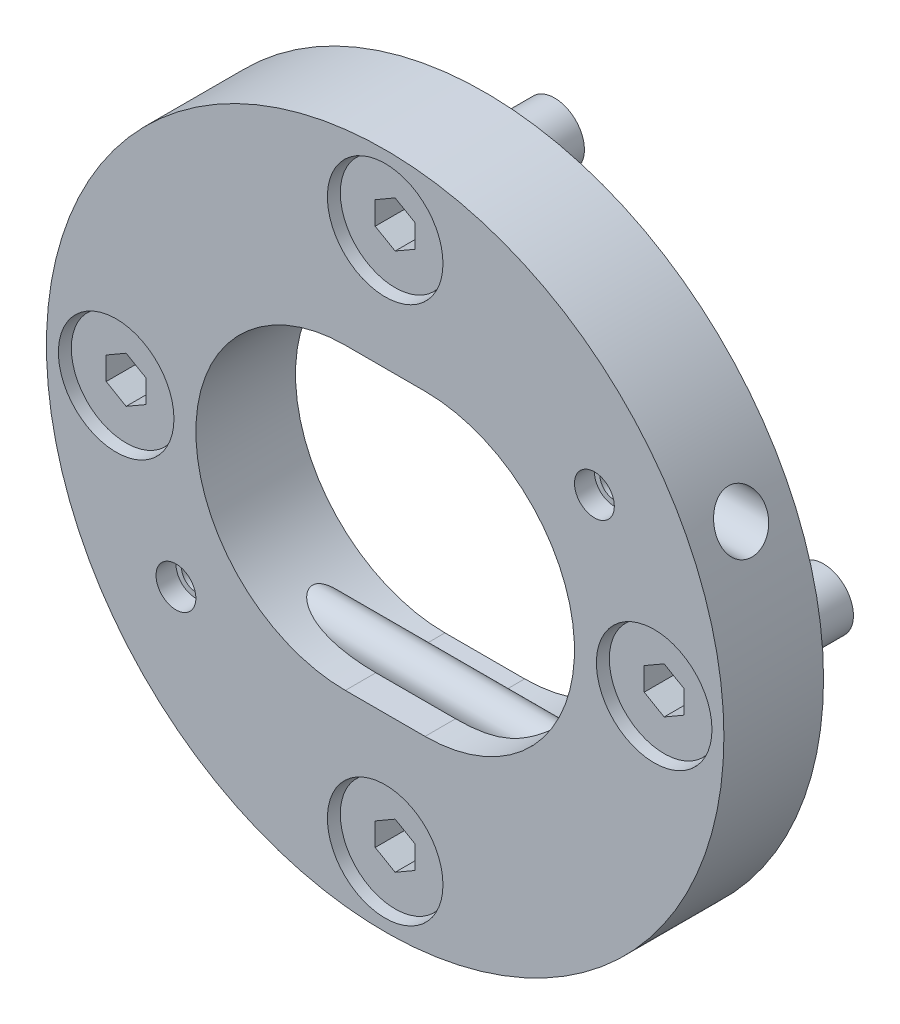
ISO-10303-21;
HEADER;
FILE_DESCRIPTION(('STEP AP214'),'2;1');
FILE_NAME('part.step','',(''),(''),'','','');
FILE_SCHEMA(('AUTOMOTIVE_DESIGN { 1 0 10303 214 1 1 1 1 }'));
ENDSEC;
DATA;
#1=APPLICATION_CONTEXT('core data for automotive mechanical design processes');
#2=APPLICATION_PROTOCOL_DEFINITION('international standard','automotive_design',2000,#1);
#3=PRODUCT_CONTEXT('',#1,'mechanical');
#4=PRODUCT('Part','Part','',(#3));
#5=PRODUCT_RELATED_PRODUCT_CATEGORY('part','',(#4));
#6=PRODUCT_DEFINITION_FORMATION('','',#4);
#7=PRODUCT_DEFINITION_CONTEXT('part definition',#1,'design');
#8=PRODUCT_DEFINITION('design','',#6,#7);
#9=PRODUCT_DEFINITION_SHAPE('','',#8);
#10=(LENGTH_UNIT() NAMED_UNIT(*) SI_UNIT(.MILLI.,.METRE.));
#11=(NAMED_UNIT(*) PLANE_ANGLE_UNIT() SI_UNIT($,.RADIAN.));
#12=(NAMED_UNIT(*) SI_UNIT($,.STERADIAN.) SOLID_ANGLE_UNIT());
#13=UNCERTAINTY_MEASURE_WITH_UNIT(LENGTH_MEASURE(1.E-05),#10,'distance_accuracy_value','');
#14=(GEOMETRIC_REPRESENTATION_CONTEXT(3) GLOBAL_UNCERTAINTY_ASSIGNED_CONTEXT((#13)) GLOBAL_UNIT_ASSIGNED_CONTEXT((#10,
#11,#12)) REPRESENTATION_CONTEXT('',''));
#15=CARTESIAN_POINT('',(0.,0.,0.));
#16=DIRECTION('',(0.,0.,1.));
#17=DIRECTION('',(1.,0.,0.));
#18=AXIS2_PLACEMENT_3D('',#15,#16,#17);
#19=CARTESIAN_POINT('',(0.,0.,2.5));
#20=DIRECTION('',(0.,0.,1.));
#21=DIRECTION('',(1.,0.,0.));
#22=AXIS2_PLACEMENT_3D('',#19,#20,#21);
#23=PLANE('',#22);
#24=CARTESIAN_POINT('',(-13.5,0.,2.5));
#25=DIRECTION('',(0.,0.,1.));
#26=DIRECTION('',(1.,0.,0.));
#27=AXIS2_PLACEMENT_3D('',#24,#25,#26);
#28=CIRCLE('',#27,2.9);
#29=CARTESIAN_POINT('',(-10.6,0.,2.5));
#30=VERTEX_POINT('',#29);
#31=EDGE_CURVE('E684',#30,#30,#28,.T.);
#32=ORIENTED_EDGE('',*,*,#31,.T.);
#33=EDGE_LOOP('',(#32));
#34=FACE_BOUND('',#33,.T.);
#35=CARTESIAN_POINT('',(-13.5,0.,2.5));
#36=DIRECTION('',(0.,0.,1.));
#37=DIRECTION('',(-1.,0.,0.));
#38=AXIS2_PLACEMENT_3D('',#35,#36,#37);
#39=CIRCLE('',#38,2.75);
#40=CARTESIAN_POINT('',(-16.25,0.,2.5));
#41=VERTEX_POINT('',#40);
#42=EDGE_CURVE('E415',#41,#41,#39,.T.);
#43=ORIENTED_EDGE('',*,*,#42,.F.);
#44=EDGE_LOOP('',(#43));
#45=FACE_BOUND('',#44,.T.);
#46=ADVANCED_FACE('F15',(#34,#45),#23,.T.);
#47=CARTESIAN_POINT('',(0.,0.,2.5));
#48=DIRECTION('',(0.,0.,1.));
#49=DIRECTION('',(1.,0.,0.));
#50=AXIS2_PLACEMENT_3D('',#47,#48,#49);
#51=PLANE('',#50);
#52=CARTESIAN_POINT('',(0.,-13.5,2.5));
#53=DIRECTION('',(0.,0.,1.));
#54=DIRECTION('',(1.,0.,0.));
#55=AXIS2_PLACEMENT_3D('',#52,#53,#54);
#56=CIRCLE('',#55,2.9);
#57=CARTESIAN_POINT('',(2.9,-13.5,2.5));
#58=VERTEX_POINT('',#57);
#59=EDGE_CURVE('E705',#58,#58,#56,.T.);
#60=ORIENTED_EDGE('',*,*,#59,.T.);
#61=EDGE_LOOP('',(#60));
#62=FACE_BOUND('',#61,.T.);
#63=CARTESIAN_POINT('',(0.,-13.5,2.5));
#64=DIRECTION('',(0.,0.,1.));
#65=DIRECTION('',(-1.,0.,0.));
#66=AXIS2_PLACEMENT_3D('',#63,#64,#65);
#67=CIRCLE('',#66,2.75);
#68=CARTESIAN_POINT('',(-2.75,-13.5,2.5));
#69=VERTEX_POINT('',#68);
#70=EDGE_CURVE('E474',#69,#69,#67,.T.);
#71=ORIENTED_EDGE('',*,*,#70,.F.);
#72=EDGE_LOOP('',(#71));
#73=FACE_BOUND('',#72,.T.);
#74=ADVANCED_FACE('F301',(#62,#73),#51,.T.);
#75=CARTESIAN_POINT('',(0.,0.,2.5));
#76=DIRECTION('',(0.,0.,1.));
#77=DIRECTION('',(1.,0.,0.));
#78=AXIS2_PLACEMENT_3D('',#75,#76,#77);
#79=PLANE('',#78);
#80=CARTESIAN_POINT('',(13.5,0.,2.5));
#81=DIRECTION('',(0.,0.,1.));
#82=DIRECTION('',(1.,0.,0.));
#83=AXIS2_PLACEMENT_3D('',#80,#81,#82);
#84=CIRCLE('',#83,2.9);
#85=CARTESIAN_POINT('',(16.4,0.,2.5));
#86=VERTEX_POINT('',#85);
#87=EDGE_CURVE('E711',#86,#86,#84,.T.);
#88=ORIENTED_EDGE('',*,*,#87,.T.);
#89=EDGE_LOOP('',(#88));
#90=FACE_BOUND('',#89,.T.);
#91=CARTESIAN_POINT('',(13.5,0.,2.5));
#92=DIRECTION('',(0.,0.,1.));
#93=DIRECTION('',(-1.,0.,0.));
#94=AXIS2_PLACEMENT_3D('',#91,#92,#93);
#95=CIRCLE('',#94,2.75);
#96=CARTESIAN_POINT('',(10.75,0.,2.5));
#97=VERTEX_POINT('',#96);
#98=EDGE_CURVE('E532',#97,#97,#95,.T.);
#99=ORIENTED_EDGE('',*,*,#98,.F.);
#100=EDGE_LOOP('',(#99));
#101=FACE_BOUND('',#100,.T.);
#102=ADVANCED_FACE('F341',(#90,#101),#79,.T.);
#103=CARTESIAN_POINT('',(0.,0.,2.5));
#104=DIRECTION('',(0.,0.,1.));
#105=DIRECTION('',(1.,0.,0.));
#106=AXIS2_PLACEMENT_3D('',#103,#104,#105);
#107=PLANE('',#106);
#108=CARTESIAN_POINT('',(0.,13.5,2.5));
#109=DIRECTION('',(0.,0.,1.));
#110=DIRECTION('',(1.,0.,0.));
#111=AXIS2_PLACEMENT_3D('',#108,#109,#110);
#112=CIRCLE('',#111,2.9);
#113=CARTESIAN_POINT('',(2.9,13.5,2.5));
#114=VERTEX_POINT('',#113);
#115=EDGE_CURVE('E717',#114,#114,#112,.T.);
#116=ORIENTED_EDGE('',*,*,#115,.T.);
#117=EDGE_LOOP('',(#116));
#118=FACE_BOUND('',#117,.T.);
#119=CARTESIAN_POINT('',(0.,13.5,2.5));
#120=DIRECTION('',(0.,0.,1.));
#121=DIRECTION('',(-1.,0.,0.));
#122=AXIS2_PLACEMENT_3D('',#119,#120,#121);
#123=CIRCLE('',#122,2.75);
#124=CARTESIAN_POINT('',(-2.75,13.5,2.5));
#125=VERTEX_POINT('',#124);
#126=EDGE_CURVE('E640',#125,#125,#123,.T.);
#127=ORIENTED_EDGE('',*,*,#126,.F.);
#128=EDGE_LOOP('',(#127));
#129=FACE_BOUND('',#128,.T.);
#130=ADVANCED_FACE('F670',(#118,#129),#107,.T.);
#131=CARTESIAN_POINT('',(0.,0.,5.));
#132=DIRECTION('',(0.,0.,-1.));
#133=DIRECTION('',(-1.,0.,0.));
#134=AXIS2_PLACEMENT_3D('',#131,#132,#133);
#135=CYLINDRICAL_SURFACE('',#134,17.);
#136=CARTESIAN_POINT('',(-15.3765243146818,-7.25,1.25));
#137=CARTESIAN_POINT('',(-15.4115082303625,-7.17580079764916,1.25000229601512));
#138=CARTESIAN_POINT('',(-15.4459745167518,-7.10129710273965,1.2566172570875));
#139=CARTESIAN_POINT('',(-15.5129618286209,-6.95374684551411,1.28329857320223));
#140=CARTESIAN_POINT('',(-15.5454808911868,-6.8807018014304,1.30337826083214));
#141=CARTESIAN_POINT('',(-15.60778330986,-6.73818690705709,1.35703995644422));
#142=CARTESIAN_POINT('',(-15.6375587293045,-6.66872766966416,1.39065971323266));
#143=CARTESIAN_POINT('',(-15.6934302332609,-6.53616273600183,1.470955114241));
#144=CARTESIAN_POINT('',(-15.7195283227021,-6.47305358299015,1.51762360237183));
#145=CARTESIAN_POINT('',(-15.7657251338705,-6.3596713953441,1.61952359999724));
#146=CARTESIAN_POINT('',(-15.7861053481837,-6.30882746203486,1.67399115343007));
#147=CARTESIAN_POINT('',(-15.8224533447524,-6.21710633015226,1.79203928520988));
#148=CARTESIAN_POINT('',(-15.8384232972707,-6.17622423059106,1.85561535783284));
#149=CARTESIAN_POINT('',(-15.8644341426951,-6.10908560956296,1.98456439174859));
#150=CARTESIAN_POINT('',(-15.874845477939,-6.08192470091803,2.04939262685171));
#151=CARTESIAN_POINT('',(-15.8913097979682,-6.03877573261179,2.18318729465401));
#152=CARTESIAN_POINT('',(-15.897364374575,-6.02278359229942,2.25215220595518));
#153=CARTESIAN_POINT('',(-15.9047687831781,-6.00320189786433,2.38831213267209));
#154=CARTESIAN_POINT('',(-15.9063510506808,-5.99899968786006,2.45540710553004));
#155=CARTESIAN_POINT('',(-15.9054451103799,-6.00140134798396,2.58937033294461));
#156=CARTESIAN_POINT('',(-15.9029575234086,-6.0080035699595,2.65623862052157));
#157=CARTESIAN_POINT('',(-15.8940459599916,-6.03153835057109,2.7866466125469));
#158=CARTESIAN_POINT('',(-15.887690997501,-6.04828977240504,2.85022393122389));
#159=CARTESIAN_POINT('',(-15.8712400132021,-6.09132723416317,2.97354310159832));
#160=CARTESIAN_POINT('',(-15.861143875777,-6.11761356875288,3.03328483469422));
#161=CARTESIAN_POINT('',(-15.8372125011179,-6.17930487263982,3.14842280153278));
#162=CARTESIAN_POINT('',(-15.8233149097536,-6.21486139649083,3.20372467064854));
#163=CARTESIAN_POINT('',(-15.7921568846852,-6.29361345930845,3.30750913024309));
#164=CARTESIAN_POINT('',(-15.7748958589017,-6.33681034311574,3.35599051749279));
#165=CARTESIAN_POINT('',(-15.7364487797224,-6.4317120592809,3.44733835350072));
#166=CARTESIAN_POINT('',(-15.7151128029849,-6.48372822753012,3.48981769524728));
#167=CARTESIAN_POINT('',(-15.6695870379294,-6.59299215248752,3.56548644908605));
#168=CARTESIAN_POINT('',(-15.6453964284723,-6.65024141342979,3.59867317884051));
#169=CARTESIAN_POINT('',(-15.592828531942,-6.77262421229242,3.6573861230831));
#170=CARTESIAN_POINT('',(-15.5642752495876,-6.83802865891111,3.68218947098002));
#171=CARTESIAN_POINT('',(-15.5051003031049,-6.97116765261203,3.72047369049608));
#172=CARTESIAN_POINT('',(-15.4744778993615,-7.0389030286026,3.73395049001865));
#173=CARTESIAN_POINT('',(-15.4093601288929,-7.18040012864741,3.75024721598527));
#174=CARTESIAN_POINT('',(-15.3747497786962,-7.2542158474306,3.75214292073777));
#175=CARTESIAN_POINT('',(-15.3047787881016,-7.40069892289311,3.74305274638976));
#176=CARTESIAN_POINT('',(-15.2694178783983,-7.47336585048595,3.73206216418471));
#177=CARTESIAN_POINT('',(-15.1969307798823,-7.619732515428,3.69656929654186));
#178=CARTESIAN_POINT('',(-15.1598156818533,-7.69326527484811,3.67135015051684));
#179=CARTESIAN_POINT('',(-15.0870398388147,-7.83502281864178,3.60738274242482));
#180=CARTESIAN_POINT('',(-15.0513794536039,-7.90324629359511,3.56863115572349));
#181=CARTESIAN_POINT('',(-14.9832488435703,-8.03165575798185,3.47857586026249));
#182=CARTESIAN_POINT('',(-14.9507538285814,-8.09190580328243,3.42738292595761));
#183=CARTESIAN_POINT('',(-14.890260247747,-8.20269081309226,3.31314084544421));
#184=CARTESIAN_POINT('',(-14.862258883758,-8.2532318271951,3.25009913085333));
#185=CARTESIAN_POINT('',(-14.8149637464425,-8.33780424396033,3.12016649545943));
#186=CARTESIAN_POINT('',(-14.7950946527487,-8.37294958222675,3.05421400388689));
#187=CARTESIAN_POINT('',(-14.7619554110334,-8.43124012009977,2.91568798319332));
#188=CARTESIAN_POINT('',(-14.7486767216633,-8.45440085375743,2.84312316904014));
#189=CARTESIAN_POINT('',(-14.7311027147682,-8.4849796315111,2.70416790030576));
#190=CARTESIAN_POINT('',(-14.7258338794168,-8.49410569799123,2.63827330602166));
#191=CARTESIAN_POINT('',(-14.721424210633,-8.50174647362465,2.50567788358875));
#192=CARTESIAN_POINT('',(-14.7222802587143,-8.50026658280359,2.43897748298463));
#193=CARTESIAN_POINT('',(-14.7297441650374,-8.4873247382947,2.31219489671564));
#194=CARTESIAN_POINT('',(-14.7358978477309,-8.47665095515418,2.25200250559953));
#195=CARTESIAN_POINT('',(-14.7529757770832,-8.44689277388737,2.13445385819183));
#196=CARTESIAN_POINT('',(-14.7639003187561,-8.42780785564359,2.07709777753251));
#197=CARTESIAN_POINT('',(-14.7902928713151,-8.38140584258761,1.96502180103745));
#198=CARTESIAN_POINT('',(-14.8058776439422,-8.35387665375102,1.91041789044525));
#199=CARTESIAN_POINT('',(-14.8407149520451,-8.29182992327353,1.80663889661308));
#200=CARTESIAN_POINT('',(-14.8599686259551,-8.25731021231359,1.75746550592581));
#201=CARTESIAN_POINT('',(-14.9035391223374,-8.178432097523,1.66046628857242));
#202=CARTESIAN_POINT('',(-14.9281743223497,-8.1334236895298,1.61331310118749));
#203=CARTESIAN_POINT('',(-14.9800364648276,-8.03750477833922,1.52711757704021));
#204=CARTESIAN_POINT('',(-15.0072652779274,-7.9865900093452,1.48808116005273));
#205=CARTESIAN_POINT('',(-15.0669668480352,-7.87344205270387,1.41421158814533));
#206=CARTESIAN_POINT('',(-15.0996697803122,-7.81058948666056,1.38051260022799));
#207=CARTESIAN_POINT('',(-15.166179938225,-7.68064483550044,1.32439382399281));
#208=CARTESIAN_POINT('',(-15.1999864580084,-7.61355543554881,1.3019669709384));
#209=CARTESIAN_POINT('',(-15.2577546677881,-7.49692123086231,1.27362600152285));
#210=CARTESIAN_POINT('',(-15.2816757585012,-7.44804535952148,1.26479141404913));
#211=CARTESIAN_POINT('',(-15.3293171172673,-7.34949210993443,1.25297744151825));
#212=CARTESIAN_POINT('',(-15.3530373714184,-7.29981467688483,1.249998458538));
#213=CARTESIAN_POINT('',(-15.3765243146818,-7.25,1.25));
#214=B_SPLINE_CURVE_WITH_KNOTS('',3,(#136,#137,#138,#139,#140,#141,#142,#143,#144,#145,#146,
#147,#148,#149,#150,#151,#152,#153,#154,#155,#156,#157,#158,#159,#160,#161,#162,#163,#164,#165,
#166,#167,#168,#169,#170,#171,#172,#173,#174,#175,#176,#177,#178,#179,#180,#181,#182,#183,#184,
#185,#186,#187,#188,#189,#190,#191,#192,#193,#194,#195,#196,#197,#198,#199,#200,#201,#202,#203,
#204,#205,#206,#207,#208,#209,#210,#211,#212,#213),.UNSPECIFIED.,.T.,.F.,(4,2,2,2,2,2,2,2,2,2,2,
2,2,2,2,2,2,2,2,2,2,2,2,2,2,2,2,2,2,2,2,2,2,2,2,2,2,2,4),(0.,0.245911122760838,
0.492066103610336,0.738912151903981,0.985623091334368,1.21612644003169,1.44651615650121,
1.65858879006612,1.87058389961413,2.07133850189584,2.27206248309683,2.46930546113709,
2.66655453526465,2.86725615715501,3.06799314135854,3.27848030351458,3.48902816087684,
3.7147230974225,3.94049914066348,4.184080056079,4.42774989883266,4.68495957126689,
4.94223247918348,5.19729361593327,5.45219530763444,5.68282014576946,5.91314530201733,
6.11225836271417,6.31127005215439,6.49474780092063,6.6782368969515,6.86677557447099,
7.05537284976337,7.26359455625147,7.4719675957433,7.70636957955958,7.94062446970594,
8.10570902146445,8.27080490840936),.UNSPECIFIED.);
#215=CARTESIAN_POINT('',(-15.3765243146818,-7.25,1.25));
#216=VERTEX_POINT('',#215);
#217=EDGE_CURVE('E656',#216,#216,#214,.T.);
#218=ORIENTED_EDGE('',*,*,#217,.T.);
#219=EDGE_LOOP('',(#218));
#220=FACE_BOUND('',#219,.T.);
#221=CARTESIAN_POINT('',(0.,0.,5.));
#222=DIRECTION('',(0.,0.,1.));
#223=DIRECTION('',(1.,0.,0.));
#224=AXIS2_PLACEMENT_3D('',#221,#222,#223);
#225=CIRCLE('',#224,17.);
#226=CARTESIAN_POINT('',(17.,0.,5.));
#227=VERTEX_POINT('',#226);
#228=EDGE_CURVE('E683',#227,#227,#225,.T.);
#229=ORIENTED_EDGE('',*,*,#228,.F.);
#230=EDGE_LOOP('',(#229));
#231=FACE_BOUND('',#230,.T.);
#232=CARTESIAN_POINT('',(0.,0.,0.));
#233=DIRECTION('',(0.,0.,1.));
#234=DIRECTION('',(1.,0.,0.));
#235=AXIS2_PLACEMENT_3D('',#232,#233,#234);
#236=CIRCLE('',#235,17.);
#237=CARTESIAN_POINT('',(17.,0.,0.));
#238=VERTEX_POINT('',#237);
#239=EDGE_CURVE('E388',#238,#238,#236,.T.);
#240=ORIENTED_EDGE('',*,*,#239,.T.);
#241=EDGE_LOOP('',(#240));
#242=FACE_BOUND('',#241,.T.);
#243=CARTESIAN_POINT('',(15.3765243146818,7.25,3.75));
#244=CARTESIAN_POINT('',(15.4115082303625,7.17580079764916,3.74999770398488));
#245=CARTESIAN_POINT('',(15.4459745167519,7.10129710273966,3.7433827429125));
#246=CARTESIAN_POINT('',(15.5129618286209,6.95374684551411,3.71670142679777));
#247=CARTESIAN_POINT('',(15.5454808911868,6.8807018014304,3.69662173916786));
#248=CARTESIAN_POINT('',(15.60778330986,6.73818690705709,3.64296004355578));
#249=CARTESIAN_POINT('',(15.6375587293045,6.66872766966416,3.60934028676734));
#250=CARTESIAN_POINT('',(15.6934302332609,6.53616273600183,3.529044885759));
#251=CARTESIAN_POINT('',(15.7195283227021,6.47305358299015,3.48237639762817));
#252=CARTESIAN_POINT('',(15.7657251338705,6.3596713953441,3.38047640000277));
#253=CARTESIAN_POINT('',(15.7861053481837,6.30882746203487,3.32600884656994));
#254=CARTESIAN_POINT('',(15.8224533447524,6.21710633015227,3.20796071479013));
#255=CARTESIAN_POINT('',(15.8384232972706,6.17622423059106,3.14438464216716));
#256=CARTESIAN_POINT('',(15.864434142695,6.10908560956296,3.01543560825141));
#257=CARTESIAN_POINT('',(15.874845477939,6.08192470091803,2.95060737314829));
#258=CARTESIAN_POINT('',(15.8913097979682,6.03877573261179,2.816812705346));
#259=CARTESIAN_POINT('',(15.897364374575,6.02278359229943,2.74784779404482));
#260=CARTESIAN_POINT('',(15.9047687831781,6.00320189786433,2.61168786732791));
#261=CARTESIAN_POINT('',(15.9063510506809,5.99899968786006,2.54459289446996));
#262=CARTESIAN_POINT('',(15.9054451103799,6.00140134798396,2.41062966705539));
#263=CARTESIAN_POINT('',(15.9029575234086,6.0080035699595,2.34376137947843));
#264=CARTESIAN_POINT('',(15.8940459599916,6.03153835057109,2.2133533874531));
#265=CARTESIAN_POINT('',(15.887690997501,6.04828977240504,2.14977606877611));
#266=CARTESIAN_POINT('',(15.8712400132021,6.09132723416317,2.02645689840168));
#267=CARTESIAN_POINT('',(15.861143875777,6.11761356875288,1.96671516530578));
#268=CARTESIAN_POINT('',(15.8372125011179,6.17930487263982,1.85157719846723));
#269=CARTESIAN_POINT('',(15.8233149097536,6.21486139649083,1.79627532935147));
#270=CARTESIAN_POINT('',(15.7921568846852,6.29361345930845,1.69249086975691));
#271=CARTESIAN_POINT('',(15.7748958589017,6.33681034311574,1.64400948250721));
#272=CARTESIAN_POINT('',(15.7364487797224,6.4317120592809,1.55266164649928));
#273=CARTESIAN_POINT('',(15.7151128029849,6.48372822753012,1.51018230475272));
#274=CARTESIAN_POINT('',(15.6695870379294,6.59299215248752,1.43451355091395));
#275=CARTESIAN_POINT('',(15.6453964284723,6.65024141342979,1.4013268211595));
#276=CARTESIAN_POINT('',(15.592828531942,6.77262421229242,1.3426138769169));
#277=CARTESIAN_POINT('',(15.5642752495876,6.83802865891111,1.31781052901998));
#278=CARTESIAN_POINT('',(15.5051003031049,6.97116765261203,1.27952630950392));
#279=CARTESIAN_POINT('',(15.4744778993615,7.0389030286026,1.26604950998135));
#280=CARTESIAN_POINT('',(15.4093601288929,7.18040012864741,1.24975278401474));
#281=CARTESIAN_POINT('',(15.3747497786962,7.2542158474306,1.24785707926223));
#282=CARTESIAN_POINT('',(15.3047787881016,7.40069892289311,1.25694725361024));
#283=CARTESIAN_POINT('',(15.2694178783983,7.47336585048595,1.26793783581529));
#284=CARTESIAN_POINT('',(15.1969307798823,7.619732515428,1.30343070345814));
#285=CARTESIAN_POINT('',(15.1598156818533,7.69326527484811,1.32864984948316));
#286=CARTESIAN_POINT('',(15.0870398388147,7.83502281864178,1.39261725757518));
#287=CARTESIAN_POINT('',(15.0513794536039,7.90324629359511,1.43136884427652));
#288=CARTESIAN_POINT('',(14.9832488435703,8.03165575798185,1.52142413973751));
#289=CARTESIAN_POINT('',(14.9507538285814,8.09190580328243,1.57261707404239));
#290=CARTESIAN_POINT('',(14.890260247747,8.20269081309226,1.68685915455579));
#291=CARTESIAN_POINT('',(14.862258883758,8.2532318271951,1.74990086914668));
#292=CARTESIAN_POINT('',(14.8149637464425,8.33780424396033,1.87983350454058));
#293=CARTESIAN_POINT('',(14.7950946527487,8.37294958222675,1.94578599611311));
#294=CARTESIAN_POINT('',(14.7619554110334,8.43124012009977,2.08431201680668));
#295=CARTESIAN_POINT('',(14.7486767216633,8.45440085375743,2.15687683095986));
#296=CARTESIAN_POINT('',(14.7311027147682,8.4849796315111,2.29583209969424));
#297=CARTESIAN_POINT('',(14.7258338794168,8.49410569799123,2.36172669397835));
#298=CARTESIAN_POINT('',(14.721424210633,8.50174647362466,2.49432211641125));
#299=CARTESIAN_POINT('',(14.7222802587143,8.5002665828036,2.56102251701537));
#300=CARTESIAN_POINT('',(14.7297441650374,8.4873247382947,2.68780510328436));
#301=CARTESIAN_POINT('',(14.7358978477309,8.47665095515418,2.74799749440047));
#302=CARTESIAN_POINT('',(14.7529757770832,8.44689277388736,2.86554614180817));
#303=CARTESIAN_POINT('',(14.7639003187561,8.42780785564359,2.92290222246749));
#304=CARTESIAN_POINT('',(14.7902928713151,8.38140584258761,3.03497819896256));
#305=CARTESIAN_POINT('',(14.8058776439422,8.35387665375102,3.08958210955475));
#306=CARTESIAN_POINT('',(14.8407149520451,8.29182992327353,3.19336110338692));
#307=CARTESIAN_POINT('',(14.8599686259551,8.25731021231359,3.24253449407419));
#308=CARTESIAN_POINT('',(14.9035391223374,8.178432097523,3.33953371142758));
#309=CARTESIAN_POINT('',(14.9281743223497,8.1334236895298,3.38668689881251));
#310=CARTESIAN_POINT('',(14.9800364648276,8.03750477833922,3.47288242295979));
#311=CARTESIAN_POINT('',(15.0072652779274,7.9865900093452,3.51191883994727));
#312=CARTESIAN_POINT('',(15.0669668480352,7.87344205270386,3.58578841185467));
#313=CARTESIAN_POINT('',(15.0996697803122,7.81058948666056,3.61948739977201));
#314=CARTESIAN_POINT('',(15.166179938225,7.68064483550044,3.67560617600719));
#315=CARTESIAN_POINT('',(15.1999864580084,7.61355543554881,3.6980330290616));
#316=CARTESIAN_POINT('',(15.2577546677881,7.49692123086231,3.72637399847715));
#317=CARTESIAN_POINT('',(15.2816757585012,7.44804535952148,3.73520858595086));
#318=CARTESIAN_POINT('',(15.3293171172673,7.34949210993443,3.74702255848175));
#319=CARTESIAN_POINT('',(15.3530373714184,7.29981467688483,3.750001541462));
#320=CARTESIAN_POINT('',(15.3765243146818,7.25,3.75));
#321=B_SPLINE_CURVE_WITH_KNOTS('',3,(#243,#244,#245,#246,#247,#248,#249,#250,#251,#252,#253,
#254,#255,#256,#257,#258,#259,#260,#261,#262,#263,#264,#265,#266,#267,#268,#269,#270,#271,#272,
#273,#274,#275,#276,#277,#278,#279,#280,#281,#282,#283,#284,#285,#286,#287,#288,#289,#290,#291,
#292,#293,#294,#295,#296,#297,#298,#299,#300,#301,#302,#303,#304,#305,#306,#307,#308,#309,#310,
#311,#312,#313,#314,#315,#316,#317,#318,#319,#320),.UNSPECIFIED.,.T.,.F.,(4,2,2,2,2,2,2,2,2,2,2,
2,2,2,2,2,2,2,2,2,2,2,2,2,2,2,2,2,2,2,2,2,2,2,2,2,2,2,4),(0.,0.245911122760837,
0.492066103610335,0.73891215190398,0.985623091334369,1.21612644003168,1.44651615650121,
1.65858879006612,1.87058389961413,2.07133850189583,2.27206248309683,2.46930546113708,
2.66655453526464,2.86725615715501,3.06799314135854,3.27848030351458,3.48902816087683,
3.7147230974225,3.94049914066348,4.184080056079,4.42774989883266,4.68495957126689,
4.94223247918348,5.19729361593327,5.45219530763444,5.68282014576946,5.91314530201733,
6.11225836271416,6.31127005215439,6.49474780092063,6.6782368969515,6.86677557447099,
7.05537284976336,7.26359455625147,7.4719675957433,7.70636957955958,7.94062446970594,
8.10570902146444,8.27080490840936),.UNSPECIFIED.);
#322=CARTESIAN_POINT('',(15.3765243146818,7.25,3.75));
#323=VERTEX_POINT('',#322);
#324=EDGE_CURVE('E264',#323,#323,#321,.T.);
#325=ORIENTED_EDGE('',*,*,#324,.F.);
#326=EDGE_LOOP('',(#325));
#327=FACE_BOUND('',#326,.T.);
#328=ADVANCED_FACE('F17',(#220,#231,#242,#327),#135,.T.);
#329=CARTESIAN_POINT('',(2.,0.,0.));
#330=DIRECTION('',(0.,0.,1.));
#331=DIRECTION('',(1.,0.,0.));
#332=AXIS2_PLACEMENT_3D('',#329,#330,#331);
#333=CYLINDRICAL_SURFACE('',#332,7.5);
#334=CARTESIAN_POINT('',(2.,-7.5,3.46824583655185));
#335=CARTESIAN_POINT('',(2.0840956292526,-7.50000063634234,3.46823191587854));
#336=CARTESIAN_POINT('',(2.16819000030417,-7.49858560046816,3.46861070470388));
#337=CARTESIAN_POINT('',(2.33627491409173,-7.49292917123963,3.47005203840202));
#338=CARTESIAN_POINT('',(2.42026546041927,-7.48868787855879,3.47111455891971));
#339=CARTESIAN_POINT('',(2.58808575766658,-7.47738133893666,3.47382232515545));
#340=CARTESIAN_POINT('',(2.67191541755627,-7.47031480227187,3.47546783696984));
#341=CARTESIAN_POINT('',(2.83927818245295,-7.45336751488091,3.47914038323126));
#342=CARTESIAN_POINT('',(2.92281128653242,-7.4434867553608,3.48116741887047));
#343=CARTESIAN_POINT('',(3.17384359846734,-7.40950210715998,3.48747271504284));
#344=CARTESIAN_POINT('',(3.34077669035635,-7.38112304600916,3.4919534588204));
#345=CARTESIAN_POINT('',(3.67232538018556,-7.31313487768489,3.4985901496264));
#346=CARTESIAN_POINT('',(3.83694208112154,-7.2735313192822,3.50074724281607));
#347=CARTESIAN_POINT('',(4.08529906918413,-7.20481544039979,3.49925427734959));
#348=CARTESIAN_POINT('',(4.17017156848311,-7.17970644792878,3.49788297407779));
#349=CARTESIAN_POINT('',(4.33892035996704,-7.1265191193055,3.49270775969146));
#350=CARTESIAN_POINT('',(4.42279661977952,-7.09844068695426,3.48890376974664));
#351=CARTESIAN_POINT('',(4.58921924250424,-7.03944094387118,3.47804063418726));
#352=CARTESIAN_POINT('',(4.67176714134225,-7.00852324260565,3.47098557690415));
#353=CARTESIAN_POINT('',(4.83531067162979,-6.94397094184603,3.45261453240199));
#354=CARTESIAN_POINT('',(4.91630678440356,-6.91033720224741,3.44129988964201));
#355=CARTESIAN_POINT('',(5.04892827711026,-6.85254243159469,3.41795288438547));
#356=CARTESIAN_POINT('',(5.10113080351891,-6.82907255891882,3.40748744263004));
#357=CARTESIAN_POINT('',(5.20444691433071,-6.78120626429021,3.38371221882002));
#358=CARTESIAN_POINT('',(5.25556076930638,-6.75681007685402,3.37040315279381));
#359=CARTESIAN_POINT('',(5.35635549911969,-6.70731125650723,3.34043155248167));
#360=CARTESIAN_POINT('',(5.40603846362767,-6.68220977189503,3.32377422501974));
#361=CARTESIAN_POINT('',(5.50362615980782,-6.63156260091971,3.28646302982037));
#362=CARTESIAN_POINT('',(5.55153195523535,-6.60601719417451,3.26581160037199));
#363=CARTESIAN_POINT('',(5.64947319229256,-6.55246105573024,3.2175395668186));
#364=CARTESIAN_POINT('',(5.6992766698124,-6.52444732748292,3.18944243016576));
#365=CARTESIAN_POINT('',(5.79489557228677,-6.46929664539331,3.12630556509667));
#366=CARTESIAN_POINT('',(5.84071360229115,-6.44215912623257,3.09127042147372));
#367=CARTESIAN_POINT('',(5.91608538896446,-6.39654052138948,3.02237663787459));
#368=CARTESIAN_POINT('',(5.94690202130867,-6.3775461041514,2.99025756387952));
#369=CARTESIAN_POINT('',(6.00374204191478,-6.34201595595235,2.92080816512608));
#370=CARTESIAN_POINT('',(6.029774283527,-6.32547569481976,2.88348769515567));
#371=CARTESIAN_POINT('',(6.06930670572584,-6.30009096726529,2.81409674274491));
#372=CARTESIAN_POINT('',(6.08430362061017,-6.29036533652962,2.78320880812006));
#373=CARTESIAN_POINT('',(6.10986307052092,-6.27369579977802,2.71892734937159));
#374=CARTESIAN_POINT('',(6.12042900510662,-6.26674976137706,2.68553576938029));
#375=CARTESIAN_POINT('',(6.13640001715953,-6.25622011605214,2.61670905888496));
#376=CARTESIAN_POINT('',(6.14176303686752,-6.25266391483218,2.58125969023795));
#377=CARTESIAN_POINT('',(6.14667226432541,-6.24940952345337,2.50978676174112));
#378=CARTESIAN_POINT('',(6.1462214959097,-6.24970932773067,2.47376351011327));
#379=CARTESIAN_POINT('',(6.13996135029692,-6.25385715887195,2.40677742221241));
#380=CARTESIAN_POINT('',(6.13479786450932,-6.25727748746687,2.3757237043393));
#381=CARTESIAN_POINT('',(6.12038455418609,-6.26677789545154,2.31501447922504));
#382=CARTESIAN_POINT('',(6.1111332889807,-6.27285891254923,2.28535946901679));
#383=CARTESIAN_POINT('',(6.08562018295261,-6.28951538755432,2.2189664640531));
#384=CARTESIAN_POINT('',(6.06806900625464,-6.30090262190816,2.18292974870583));
#385=CARTESIAN_POINT('',(6.02817869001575,-6.32647926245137,2.11471605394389));
#386=CARTESIAN_POINT('',(6.00583026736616,-6.34067409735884,2.08254674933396));
#387=CARTESIAN_POINT('',(5.9457922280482,-6.37828340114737,2.00742105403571));
#388=CARTESIAN_POINT('',(5.90591746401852,-6.40283154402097,1.9667948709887));
#389=CARTESIAN_POINT('',(5.82087840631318,-6.45394198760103,1.89311443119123));
#390=CARTESIAN_POINT('',(5.77570306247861,-6.48050845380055,1.8600764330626));
#391=CARTESIAN_POINT('',(5.68746738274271,-6.53106825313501,1.80402645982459));
#392=CARTESIAN_POINT('',(5.64481579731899,-6.55498255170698,1.7802843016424));
#393=CARTESIAN_POINT('',(5.55742177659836,-6.60282022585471,1.73697950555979));
#394=CARTESIAN_POINT('',(5.5126777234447,-6.62674359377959,1.71742016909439));
#395=CARTESIAN_POINT('',(5.42155310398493,-6.67425046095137,1.68183477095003));
#396=CARTESIAN_POINT('',(5.37517015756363,-6.6978333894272,1.66581411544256));
#397=CARTESIAN_POINT('',(5.28115690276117,-6.74438778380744,1.63680438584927));
#398=CARTESIAN_POINT('',(5.23352611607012,-6.76735900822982,1.62381649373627));
#399=CARTESIAN_POINT('',(5.08587961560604,-6.83662223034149,1.58791554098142));
#400=CARTESIAN_POINT('',(4.98423031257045,-6.88162726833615,1.56921117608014));
#401=CARTESIAN_POINT('',(4.77803137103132,-6.96742830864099,1.53968561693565));
#402=CARTESIAN_POINT('',(4.67347879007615,-7.00821982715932,1.52887274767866));
#403=CARTESIAN_POINT('',(4.4618199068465,-7.0853498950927,1.51285902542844));
#404=CARTESIAN_POINT('',(4.35470439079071,-7.12166805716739,1.50768308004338));
#405=CARTESIAN_POINT('',(4.13888943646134,-7.18943303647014,1.50125760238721));
#406=CARTESIAN_POINT('',(4.03019050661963,-7.22088138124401,1.50000683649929));
#407=CARTESIAN_POINT('',(3.7633124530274,-7.29158964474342,1.49999017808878));
#408=CARTESIAN_POINT('',(3.60442677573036,-7.32818938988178,1.502561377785));
#409=CARTESIAN_POINT('',(3.28459959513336,-7.39096570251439,1.50948212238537));
#410=CARTESIAN_POINT('',(3.12365738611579,-7.41713858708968,1.51383229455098));
#411=CARTESIAN_POINT('',(2.88231873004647,-7.44835408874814,1.51981560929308));
#412=CARTESIAN_POINT('',(2.80242755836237,-7.45738387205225,1.52170865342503));
#413=CARTESIAN_POINT('',(2.64238554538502,-7.47287115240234,1.52511940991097));
#414=CARTESIAN_POINT('',(2.56223470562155,-7.47932866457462,1.52663712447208));
#415=CARTESIAN_POINT('',(2.40178211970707,-7.48966166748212,1.52912830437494));
#416=CARTESIAN_POINT('',(2.3214804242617,-7.49353790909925,1.53010192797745));
#417=CARTESIAN_POINT('',(2.16078617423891,-7.49870738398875,1.53142068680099));
#418=CARTESIAN_POINT('',(2.08039361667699,-7.50000052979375,1.53176580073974));
#419=CARTESIAN_POINT('',(2.,-7.5,1.53175416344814));
#420=B_SPLINE_CURVE_WITH_KNOTS('',3,(#334,#335,#336,#337,#338,#339,#340,#341,#342,#343,#344,
#345,#346,#347,#348,#349,#350,#351,#352,#353,#354,#355,#356,#357,#358,#359,#360,#361,#362,#363,
#364,#365,#366,#367,#368,#369,#370,#371,#372,#373,#374,#375,#376,#377,#378,#379,#380,#381,#382,
#383,#384,#385,#386,#387,#388,#389,#390,#391,#392,#393,#394,#395,#396,#397,#398,#399,#400,#401,
#402,#403,#404,#405,#406,#407,#408,#409,#410,#411,#412,#413,#414,#415,#416,#417,#418,#419),
.UNSPECIFIED.,.F.,.F.,(4,2,2,2,2,2,2,2,2,2,2,2,2,2,2,2,2,2,2,2,2,2,2,2,2,2,2,2,2,2,2,2,2,2,2,2,
2,2,2,2,2,2,4),(0.,0.25227196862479,0.504534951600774,0.756913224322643,1.00929228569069,
1.51704895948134,2.0245550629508,2.29004231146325,2.5555381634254,2.82070105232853,
3.08578031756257,3.26026346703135,3.43470273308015,3.60887280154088,3.7829368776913,
3.97358514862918,4.16410785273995,4.30885759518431,4.45333672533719,4.56000054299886,
4.6665823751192,4.77401875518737,4.88139925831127,4.97596545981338,5.07056501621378,
5.1948808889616,5.31943952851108,5.50437810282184,5.68970930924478,5.85254716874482,
6.01551308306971,6.17872627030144,6.34200296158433,6.67960850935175,7.01756969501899,
7.35701822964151,7.6963600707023,8.1851636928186,8.674139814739,8.91537114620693,
9.15660105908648,9.39776076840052,9.63892864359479),.UNSPECIFIED.);
#421=CARTESIAN_POINT('',(2.,-7.5,3.46824583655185));
#422=VERTEX_POINT('',#421);
#423=CARTESIAN_POINT('',(2.,-7.5,1.53175416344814));
#424=VERTEX_POINT('',#423);
#425=EDGE_CURVE('E242',#422,#424,#420,.T.);
#426=ORIENTED_EDGE('',*,*,#425,.F.);
#427=DIRECTION('',(0.,0.,1.));
#428=VECTOR('',#427,1.);
#429=CARTESIAN_POINT('',(2.,-7.5,0.));
#430=LINE('',#429,#428);
#431=CARTESIAN_POINT('',(2.,-7.5,5.));
#432=VERTEX_POINT('',#431);
#433=EDGE_CURVE('E239',#422,#432,#430,.T.);
#434=ORIENTED_EDGE('',*,*,#433,.T.);
#435=CARTESIAN_POINT('',(2.,0.,5.));
#436=DIRECTION('',(0.,0.,1.));
#437=DIRECTION('',(1.,0.,0.));
#438=AXIS2_PLACEMENT_3D('',#435,#436,#437);
#439=CIRCLE('',#438,7.5);
#440=CARTESIAN_POINT('',(2.,7.5,5.));
#441=VERTEX_POINT('',#440);
#442=EDGE_CURVE('E312',#432,#441,#439,.T.);
#443=ORIENTED_EDGE('',*,*,#442,.T.);
#444=DIRECTION('',(0.,0.,1.));
#445=VECTOR('',#444,1.);
#446=CARTESIAN_POINT('',(2.,7.5,0.));
#447=LINE('',#446,#445);
#448=CARTESIAN_POINT('',(2.,7.5,3.46824583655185));
#449=VERTEX_POINT('',#448);
#450=EDGE_CURVE('E704',#449,#441,#447,.T.);
#451=ORIENTED_EDGE('',*,*,#450,.F.);
#452=CARTESIAN_POINT('',(2.,7.5,3.46824583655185));
#453=CARTESIAN_POINT('',(2.0840956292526,7.50000063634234,3.46823191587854));
#454=CARTESIAN_POINT('',(2.16819000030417,7.49858560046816,3.46861070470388));
#455=CARTESIAN_POINT('',(2.33627491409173,7.49292917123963,3.47005203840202));
#456=CARTESIAN_POINT('',(2.42026546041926,7.48868787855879,3.47111455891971));
#457=CARTESIAN_POINT('',(2.58808575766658,7.47738133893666,3.47382232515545));
#458=CARTESIAN_POINT('',(2.67191541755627,7.47031480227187,3.47546783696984));
#459=CARTESIAN_POINT('',(2.83927818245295,7.45336751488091,3.47914038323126));
#460=CARTESIAN_POINT('',(2.92281128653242,7.4434867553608,3.48116741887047));
#461=CARTESIAN_POINT('',(3.17384359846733,7.40950210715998,3.48747271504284));
#462=CARTESIAN_POINT('',(3.34077669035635,7.38112304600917,3.4919534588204));
#463=CARTESIAN_POINT('',(3.67232538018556,7.3131348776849,3.4985901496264));
#464=CARTESIAN_POINT('',(3.83694208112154,7.2735313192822,3.50074724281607));
#465=CARTESIAN_POINT('',(4.08529906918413,7.20481544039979,3.49925427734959));
#466=CARTESIAN_POINT('',(4.17017156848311,7.17970644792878,3.49788297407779));
#467=CARTESIAN_POINT('',(4.33892035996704,7.1265191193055,3.49270775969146));
#468=CARTESIAN_POINT('',(4.42279661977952,7.09844068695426,3.48890376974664));
#469=CARTESIAN_POINT('',(4.58921924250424,7.03944094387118,3.47804063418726));
#470=CARTESIAN_POINT('',(4.67176714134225,7.00852324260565,3.47098557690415));
#471=CARTESIAN_POINT('',(4.83531067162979,6.94397094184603,3.45261453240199));
#472=CARTESIAN_POINT('',(4.91630678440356,6.91033720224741,3.44129988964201));
#473=CARTESIAN_POINT('',(5.04892827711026,6.85254243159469,3.41795288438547));
#474=CARTESIAN_POINT('',(5.10113080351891,6.82907255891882,3.40748744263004));
#475=CARTESIAN_POINT('',(5.20444691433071,6.78120626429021,3.38371221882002));
#476=CARTESIAN_POINT('',(5.25556076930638,6.75681007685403,3.37040315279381));
#477=CARTESIAN_POINT('',(5.3563554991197,6.70731125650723,3.34043155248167));
#478=CARTESIAN_POINT('',(5.40603846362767,6.68220977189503,3.32377422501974));
#479=CARTESIAN_POINT('',(5.50362615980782,6.63156260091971,3.28646302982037));
#480=CARTESIAN_POINT('',(5.55153195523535,6.60601719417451,3.26581160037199));
#481=CARTESIAN_POINT('',(5.64947319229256,6.55246105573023,3.21753956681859));
#482=CARTESIAN_POINT('',(5.69927666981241,6.52444732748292,3.18944243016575));
#483=CARTESIAN_POINT('',(5.79489557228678,6.46929664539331,3.12630556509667));
#484=CARTESIAN_POINT('',(5.84071360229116,6.44215912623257,3.09127042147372));
#485=CARTESIAN_POINT('',(5.91608538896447,6.39654052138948,3.02237663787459));
#486=CARTESIAN_POINT('',(5.94690202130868,6.3775461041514,2.99025756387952));
#487=CARTESIAN_POINT('',(6.00374204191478,6.34201595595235,2.92080816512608));
#488=CARTESIAN_POINT('',(6.029774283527,6.32547569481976,2.88348769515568));
#489=CARTESIAN_POINT('',(6.06930670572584,6.30009096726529,2.81409674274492));
#490=CARTESIAN_POINT('',(6.08430362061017,6.29036533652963,2.78320880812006));
#491=CARTESIAN_POINT('',(6.10986307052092,6.27369579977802,2.71892734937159));
#492=CARTESIAN_POINT('',(6.12042900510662,6.26674976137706,2.6855357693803));
#493=CARTESIAN_POINT('',(6.13640001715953,6.25622011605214,2.61670905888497));
#494=CARTESIAN_POINT('',(6.14176303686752,6.25266391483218,2.58125969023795));
#495=CARTESIAN_POINT('',(6.14667226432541,6.24940952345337,2.50978676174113));
#496=CARTESIAN_POINT('',(6.1462214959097,6.24970932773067,2.47376351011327));
#497=CARTESIAN_POINT('',(6.13996135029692,6.25385715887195,2.40677742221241));
#498=CARTESIAN_POINT('',(6.13479786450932,6.25727748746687,2.3757237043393));
#499=CARTESIAN_POINT('',(6.12038455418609,6.26677789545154,2.31501447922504));
#500=CARTESIAN_POINT('',(6.1111332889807,6.27285891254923,2.28535946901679));
#501=CARTESIAN_POINT('',(6.08562018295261,6.28951538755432,2.2189664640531));
#502=CARTESIAN_POINT('',(6.06806900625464,6.30090262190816,2.18292974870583));
#503=CARTESIAN_POINT('',(6.02817869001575,6.32647926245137,2.11471605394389));
#504=CARTESIAN_POINT('',(6.00583026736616,6.34067409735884,2.08254674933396));
#505=CARTESIAN_POINT('',(5.9457922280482,6.37828340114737,2.00742105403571));
#506=CARTESIAN_POINT('',(5.90591746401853,6.40283154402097,1.9667948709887));
#507=CARTESIAN_POINT('',(5.82087840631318,6.45394198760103,1.89311443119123));
#508=CARTESIAN_POINT('',(5.77570306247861,6.48050845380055,1.8600764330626));
#509=CARTESIAN_POINT('',(5.68746738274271,6.53106825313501,1.80402645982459));
#510=CARTESIAN_POINT('',(5.64481579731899,6.55498255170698,1.7802843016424));
#511=CARTESIAN_POINT('',(5.55742177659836,6.60282022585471,1.73697950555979));
#512=CARTESIAN_POINT('',(5.5126777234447,6.62674359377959,1.71742016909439));
#513=CARTESIAN_POINT('',(5.42155310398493,6.67425046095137,1.68183477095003));
#514=CARTESIAN_POINT('',(5.37517015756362,6.69783338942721,1.66581411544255));
#515=CARTESIAN_POINT('',(5.28115690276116,6.74438778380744,1.63680438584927));
#516=CARTESIAN_POINT('',(5.23352611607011,6.76735900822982,1.62381649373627));
#517=CARTESIAN_POINT('',(5.08587961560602,6.83662223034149,1.58791554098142));
#518=CARTESIAN_POINT('',(4.98423031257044,6.88162726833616,1.56921117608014));
#519=CARTESIAN_POINT('',(4.77803137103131,6.967428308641,1.53968561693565));
#520=CARTESIAN_POINT('',(4.67347879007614,7.00821982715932,1.52887274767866));
#521=CARTESIAN_POINT('',(4.46181990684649,7.08534989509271,1.51285902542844));
#522=CARTESIAN_POINT('',(4.3547043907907,7.1216680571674,1.50768308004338));
#523=CARTESIAN_POINT('',(4.13888943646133,7.18943303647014,1.50125760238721));
#524=CARTESIAN_POINT('',(4.03019050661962,7.22088138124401,1.5000068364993));
#525=CARTESIAN_POINT('',(3.76331245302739,7.29158964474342,1.49999017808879));
#526=CARTESIAN_POINT('',(3.60442677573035,7.32818938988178,1.50256137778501));
#527=CARTESIAN_POINT('',(3.28459959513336,7.39096570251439,1.50948212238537));
#528=CARTESIAN_POINT('',(3.12365738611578,7.41713858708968,1.51383229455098));
#529=CARTESIAN_POINT('',(2.88231873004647,7.44835408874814,1.51981560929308));
#530=CARTESIAN_POINT('',(2.80242755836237,7.45738387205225,1.52170865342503));
#531=CARTESIAN_POINT('',(2.64238554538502,7.47287115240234,1.52511940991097));
#532=CARTESIAN_POINT('',(2.56223470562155,7.47932866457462,1.52663712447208));
#533=CARTESIAN_POINT('',(2.40178211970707,7.48966166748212,1.52912830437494));
#534=CARTESIAN_POINT('',(2.3214804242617,7.49353790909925,1.53010192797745));
#535=CARTESIAN_POINT('',(2.16078617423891,7.49870738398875,1.53142068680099));
#536=CARTESIAN_POINT('',(2.08039361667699,7.50000052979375,1.53176580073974));
#537=CARTESIAN_POINT('',(2.,7.5,1.53175416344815));
#538=B_SPLINE_CURVE_WITH_KNOTS('',3,(#452,#453,#454,#455,#456,#457,#458,#459,#460,#461,#462,
#463,#464,#465,#466,#467,#468,#469,#470,#471,#472,#473,#474,#475,#476,#477,#478,#479,#480,#481,
#482,#483,#484,#485,#486,#487,#488,#489,#490,#491,#492,#493,#494,#495,#496,#497,#498,#499,#500,
#501,#502,#503,#504,#505,#506,#507,#508,#509,#510,#511,#512,#513,#514,#515,#516,#517,#518,#519,
#520,#521,#522,#523,#524,#525,#526,#527,#528,#529,#530,#531,#532,#533,#534,#535,#536,#537),
.UNSPECIFIED.,.F.,.F.,(4,2,2,2,2,2,2,2,2,2,2,2,2,2,2,2,2,2,2,2,2,2,2,2,2,2,2,2,2,2,2,2,2,2,2,2,
2,2,2,2,2,2,4),(0.,0.252271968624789,0.504534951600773,0.75691322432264,1.00929228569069,
1.51704895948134,2.0245550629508,2.29004231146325,2.5555381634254,2.82070105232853,
3.08578031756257,3.26026346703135,3.43470273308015,3.60887280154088,3.7829368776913,
3.97358514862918,4.16410785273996,4.30885759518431,4.45333672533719,4.56000054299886,
4.6665823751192,4.77401875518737,4.88139925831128,4.97596545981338,5.07056501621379,
5.19488088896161,5.31943952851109,5.50437810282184,5.68970930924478,5.85254716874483,
6.01551308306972,6.17872627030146,6.34200296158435,6.67960850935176,7.017569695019,
7.35701822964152,7.69636007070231,8.18516369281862,8.67413981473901,8.91537114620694,
9.15660105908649,9.39776076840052,9.6389286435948),.UNSPECIFIED.);
#539=CARTESIAN_POINT('',(2.,7.5,1.53175416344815));
#540=VERTEX_POINT('',#539);
#541=EDGE_CURVE('E305',#449,#540,#538,.T.);
#542=ORIENTED_EDGE('',*,*,#541,.T.);
#543=CARTESIAN_POINT('',(2.,7.5,0.));
#544=VERTEX_POINT('',#543);
#545=EDGE_CURVE('E696',#544,#540,#447,.T.);
#546=ORIENTED_EDGE('',*,*,#545,.F.);
#547=CARTESIAN_POINT('',(2.,0.,0.));
#548=DIRECTION('',(0.,0.,1.));
#549=DIRECTION('',(1.,0.,0.));
#550=AXIS2_PLACEMENT_3D('',#547,#548,#549);
#551=CIRCLE('',#550,7.5);
#552=CARTESIAN_POINT('',(2.,-7.5,0.));
#553=VERTEX_POINT('',#552);
#554=EDGE_CURVE('E317',#553,#544,#551,.T.);
#555=ORIENTED_EDGE('',*,*,#554,.F.);
#556=EDGE_CURVE('E722',#553,#424,#430,.T.);
#557=ORIENTED_EDGE('',*,*,#556,.T.);
#558=EDGE_LOOP('',(#426,#434,#443,#451,#542,#546,#555,#557));
#559=FACE_BOUND('',#558,.T.);
#560=ADVANCED_FACE('F295',(#559),#333,.F.);
#561=CARTESIAN_POINT('',(2.,-7.5,0.));
#562=DIRECTION('',(0.,-1.,0.));
#563=DIRECTION('',(1.,0.,0.));
#564=AXIS2_PLACEMENT_3D('',#561,#562,#563);
#565=PLANE('',#564);
#566=DIRECTION('',(-1.,0.,0.));
#567=VECTOR('',#566,1.);
#568=CARTESIAN_POINT('',(6.5,-7.5,3.46824583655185));
#569=LINE('',#568,#567);
#570=CARTESIAN_POINT('',(-2.,-7.5,3.46824583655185));
#571=VERTEX_POINT('',#570);
#572=EDGE_CURVE('E237',#571,#422,#569,.F.);
#573=ORIENTED_EDGE('',*,*,#572,.F.);
#574=DIRECTION('',(0.,0.,1.));
#575=VECTOR('',#574,1.);
#576=CARTESIAN_POINT('',(-2.,-7.5,0.));
#577=LINE('',#576,#575);
#578=CARTESIAN_POINT('',(-2.,-7.5,5.));
#579=VERTEX_POINT('',#578);
#580=EDGE_CURVE('E224',#571,#579,#577,.T.);
#581=ORIENTED_EDGE('',*,*,#580,.T.);
#582=DIRECTION('',(1.,0.,0.));
#583=VECTOR('',#582,1.);
#584=CARTESIAN_POINT('',(2.,-7.5,5.));
#585=LINE('',#584,#583);
#586=EDGE_CURVE('E733',#579,#432,#585,.T.);
#587=ORIENTED_EDGE('',*,*,#586,.T.);
#588=ORIENTED_EDGE('',*,*,#433,.F.);
#589=EDGE_LOOP('',(#573,#581,#587,#588));
#590=FACE_BOUND('',#589,.T.);
#591=ADVANCED_FACE('F238',(#590),#565,.F.);
#592=DIRECTION('',(-1.,0.,0.));
#593=VECTOR('',#592,1.);
#594=CARTESIAN_POINT('',(6.5,-7.5,1.53175416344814));
#595=LINE('',#594,#593);
#596=CARTESIAN_POINT('',(-2.,-7.5,1.53175416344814));
#597=VERTEX_POINT('',#596);
#598=EDGE_CURVE('E243',#424,#597,#595,.T.);
#599=ORIENTED_EDGE('',*,*,#598,.F.);
#600=ORIENTED_EDGE('',*,*,#556,.F.);
#601=DIRECTION('',(1.,0.,0.));
#602=VECTOR('',#601,1.);
#603=CARTESIAN_POINT('',(2.,-7.5,0.));
#604=LINE('',#603,#602);
#605=CARTESIAN_POINT('',(-2.,-7.5,0.));
#606=VERTEX_POINT('',#605);
#607=EDGE_CURVE('E384',#606,#553,#604,.T.);
#608=ORIENTED_EDGE('',*,*,#607,.F.);
#609=EDGE_CURVE('E232',#606,#597,#577,.T.);
#610=ORIENTED_EDGE('',*,*,#609,.T.);
#611=EDGE_LOOP('',(#599,#600,#608,#610));
#612=FACE_BOUND('',#611,.T.);
#613=ADVANCED_FACE('F327',(#612),#565,.F.);
#614=CARTESIAN_POINT('',(-2.,0.,0.));
#615=DIRECTION('',(0.,0.,1.));
#616=DIRECTION('',(1.,0.,0.));
#617=AXIS2_PLACEMENT_3D('',#614,#615,#616);
#618=CYLINDRICAL_SURFACE('',#617,7.5);
#619=CARTESIAN_POINT('',(-2.,-7.5,1.53175416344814));
#620=CARTESIAN_POINT('',(-2.0840956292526,-7.50000063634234,1.53176808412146));
#621=CARTESIAN_POINT('',(-2.16819000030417,-7.49858560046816,1.53138929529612));
#622=CARTESIAN_POINT('',(-2.33627491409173,-7.49292917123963,1.52994796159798));
#623=CARTESIAN_POINT('',(-2.42026546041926,-7.48868787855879,1.52888544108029));
#624=CARTESIAN_POINT('',(-2.58808575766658,-7.47738133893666,1.52617767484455));
#625=CARTESIAN_POINT('',(-2.67191541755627,-7.47031480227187,1.52453216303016));
#626=CARTESIAN_POINT('',(-2.83927818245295,-7.45336751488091,1.52085961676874));
#627=CARTESIAN_POINT('',(-2.92281128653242,-7.4434867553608,1.51883258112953));
#628=CARTESIAN_POINT('',(-3.17384359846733,-7.40950210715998,1.51252728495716));
#629=CARTESIAN_POINT('',(-3.34077669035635,-7.38112304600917,1.5080465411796));
#630=CARTESIAN_POINT('',(-3.67232538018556,-7.31313487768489,1.5014098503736));
#631=CARTESIAN_POINT('',(-3.83694208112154,-7.2735313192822,1.49925275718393));
#632=CARTESIAN_POINT('',(-4.08529906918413,-7.20481544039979,1.5007457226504));
#633=CARTESIAN_POINT('',(-4.17017156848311,-7.17970644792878,1.50211702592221));
#634=CARTESIAN_POINT('',(-4.33892035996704,-7.1265191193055,1.50729224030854));
#635=CARTESIAN_POINT('',(-4.42279661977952,-7.09844068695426,1.51109623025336));
#636=CARTESIAN_POINT('',(-4.58921924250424,-7.03944094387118,1.52195936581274));
#637=CARTESIAN_POINT('',(-4.67176714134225,-7.00852324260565,1.52901442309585));
#638=CARTESIAN_POINT('',(-4.83531067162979,-6.94397094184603,1.54738546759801));
#639=CARTESIAN_POINT('',(-4.91630678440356,-6.91033720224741,1.55870011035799));
#640=CARTESIAN_POINT('',(-5.04892827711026,-6.85254243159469,1.58204711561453));
#641=CARTESIAN_POINT('',(-5.10113080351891,-6.82907255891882,1.59251255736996));
#642=CARTESIAN_POINT('',(-5.20444691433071,-6.78120626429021,1.61628778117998));
#643=CARTESIAN_POINT('',(-5.25556076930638,-6.75681007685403,1.62959684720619));
#644=CARTESIAN_POINT('',(-5.35635549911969,-6.70731125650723,1.65956844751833));
#645=CARTESIAN_POINT('',(-5.40603846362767,-6.68220977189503,1.67622577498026));
#646=CARTESIAN_POINT('',(-5.50362615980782,-6.63156260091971,1.71353697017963));
#647=CARTESIAN_POINT('',(-5.55153195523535,-6.60601719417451,1.73418839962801));
#648=CARTESIAN_POINT('',(-5.64947319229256,-6.55246105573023,1.78246043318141));
#649=CARTESIAN_POINT('',(-5.69927666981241,-6.52444732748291,1.81055756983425));
#650=CARTESIAN_POINT('',(-5.79489557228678,-6.4692966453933,1.87369443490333));
#651=CARTESIAN_POINT('',(-5.84071360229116,-6.44215912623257,1.90872957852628));
#652=CARTESIAN_POINT('',(-5.91608538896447,-6.39654052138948,1.97762336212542));
#653=CARTESIAN_POINT('',(-5.94690202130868,-6.3775461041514,2.00974243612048));
#654=CARTESIAN_POINT('',(-6.00374204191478,-6.34201595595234,2.07919183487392));
#655=CARTESIAN_POINT('',(-6.029774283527,-6.32547569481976,2.11651230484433));
#656=CARTESIAN_POINT('',(-6.06930670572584,-6.30009096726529,2.18590325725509));
#657=CARTESIAN_POINT('',(-6.08430362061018,-6.29036533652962,2.21679119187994));
#658=CARTESIAN_POINT('',(-6.10986307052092,-6.27369579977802,2.28107265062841));
#659=CARTESIAN_POINT('',(-6.12042900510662,-6.26674976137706,2.31446423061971));
#660=CARTESIAN_POINT('',(-6.13640001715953,-6.25622011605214,2.38329094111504));
#661=CARTESIAN_POINT('',(-6.14176303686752,-6.25266391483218,2.41874030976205));
#662=CARTESIAN_POINT('',(-6.14667226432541,-6.24940952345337,2.49021323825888));
#663=CARTESIAN_POINT('',(-6.1462214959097,-6.24970932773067,2.52623648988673));
#664=CARTESIAN_POINT('',(-6.13996135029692,-6.25385715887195,2.59322257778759));
#665=CARTESIAN_POINT('',(-6.13479786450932,-6.25727748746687,2.6242762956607));
#666=CARTESIAN_POINT('',(-6.12038455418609,-6.26677789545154,2.68498552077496));
#667=CARTESIAN_POINT('',(-6.1111332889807,-6.27285891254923,2.71464053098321));
#668=CARTESIAN_POINT('',(-6.08562018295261,-6.28951538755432,2.7810335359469));
#669=CARTESIAN_POINT('',(-6.06806900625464,-6.30090262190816,2.81707025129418));
#670=CARTESIAN_POINT('',(-6.02817869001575,-6.32647926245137,2.88528394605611));
#671=CARTESIAN_POINT('',(-6.00583026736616,-6.34067409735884,2.91745325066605));
#672=CARTESIAN_POINT('',(-5.9457922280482,-6.37828340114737,2.9925789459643));
#673=CARTESIAN_POINT('',(-5.90591746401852,-6.40283154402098,3.03320512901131));
#674=CARTESIAN_POINT('',(-5.82087840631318,-6.45394198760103,3.10688556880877));
#675=CARTESIAN_POINT('',(-5.77570306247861,-6.48050845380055,3.1399235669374));
#676=CARTESIAN_POINT('',(-5.68746738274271,-6.53106825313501,3.19597354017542));
#677=CARTESIAN_POINT('',(-5.64481579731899,-6.55498255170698,3.2197156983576));
#678=CARTESIAN_POINT('',(-5.55742177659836,-6.60282022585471,3.26302049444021));
#679=CARTESIAN_POINT('',(-5.5126777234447,-6.62674359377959,3.28257983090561));
#680=CARTESIAN_POINT('',(-5.42155310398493,-6.67425046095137,3.31816522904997));
#681=CARTESIAN_POINT('',(-5.37517015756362,-6.69783338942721,3.33418588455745));
#682=CARTESIAN_POINT('',(-5.28115690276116,-6.74438778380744,3.36319561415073));
#683=CARTESIAN_POINT('',(-5.23352611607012,-6.76735900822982,3.37618350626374));
#684=CARTESIAN_POINT('',(-5.08587961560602,-6.83662223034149,3.41208445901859));
#685=CARTESIAN_POINT('',(-4.98423031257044,-6.88162726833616,3.43078882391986));
#686=CARTESIAN_POINT('',(-4.77803137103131,-6.96742830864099,3.46031438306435));
#687=CARTESIAN_POINT('',(-4.67347879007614,-7.00821982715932,3.47112725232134));
#688=CARTESIAN_POINT('',(-4.46181990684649,-7.08534989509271,3.48714097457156));
#689=CARTESIAN_POINT('',(-4.3547043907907,-7.1216680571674,3.49231691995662));
#690=CARTESIAN_POINT('',(-4.13888943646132,-7.18943303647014,3.49874239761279));
#691=CARTESIAN_POINT('',(-4.03019050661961,-7.22088138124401,3.49999316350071));
#692=CARTESIAN_POINT('',(-3.76331245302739,-7.29158964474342,3.50000982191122));
#693=CARTESIAN_POINT('',(-3.60442677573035,-7.32818938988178,3.497438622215));
#694=CARTESIAN_POINT('',(-3.28459959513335,-7.39096570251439,3.49051787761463));
#695=CARTESIAN_POINT('',(-3.12365738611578,-7.41713858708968,3.48616770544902));
#696=CARTESIAN_POINT('',(-2.88231873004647,-7.44835408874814,3.48018439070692));
#697=CARTESIAN_POINT('',(-2.80242755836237,-7.45738387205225,3.47829134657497));
#698=CARTESIAN_POINT('',(-2.64238554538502,-7.47287115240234,3.47488059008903));
#699=CARTESIAN_POINT('',(-2.56223470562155,-7.47932866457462,3.47336287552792));
#700=CARTESIAN_POINT('',(-2.40178211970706,-7.48966166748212,3.47087169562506));
#701=CARTESIAN_POINT('',(-2.3214804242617,-7.49353790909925,3.46989807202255));
#702=CARTESIAN_POINT('',(-2.16078617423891,-7.49870738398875,3.46857931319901));
#703=CARTESIAN_POINT('',(-2.08039361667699,-7.50000052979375,3.46823419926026));
#704=CARTESIAN_POINT('',(-2.,-7.5,3.46824583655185));
#705=B_SPLINE_CURVE_WITH_KNOTS('',3,(#619,#620,#621,#622,#623,#624,#625,#626,#627,#628,#629,
#630,#631,#632,#633,#634,#635,#636,#637,#638,#639,#640,#641,#642,#643,#644,#645,#646,#647,#648,
#649,#650,#651,#652,#653,#654,#655,#656,#657,#658,#659,#660,#661,#662,#663,#664,#665,#666,#667,
#668,#669,#670,#671,#672,#673,#674,#675,#676,#677,#678,#679,#680,#681,#682,#683,#684,#685,#686,
#687,#688,#689,#690,#691,#692,#693,#694,#695,#696,#697,#698,#699,#700,#701,#702,#703,#704),
.UNSPECIFIED.,.F.,.F.,(4,2,2,2,2,2,2,2,2,2,2,2,2,2,2,2,2,2,2,2,2,2,2,2,2,2,2,2,2,2,2,2,2,2,2,2,
2,2,2,2,2,2,4),(0.,0.252271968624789,0.504534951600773,0.756913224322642,1.00929228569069,
1.51704895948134,2.0245550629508,2.29004231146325,2.5555381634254,2.82070105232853,
3.08578031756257,3.26026346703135,3.43470273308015,3.60887280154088,3.7829368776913,
3.97358514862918,4.16410785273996,4.30885759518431,4.45333672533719,4.56000054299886,
4.6665823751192,4.77401875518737,4.88139925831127,4.97596545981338,5.07056501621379,
5.19488088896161,5.31943952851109,5.50437810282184,5.68970930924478,5.85254716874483,
6.01551308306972,6.17872627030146,6.34200296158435,6.67960850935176,7.017569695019,
7.35701822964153,7.69636007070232,8.18516369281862,8.67413981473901,8.91537114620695,
9.15660105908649,9.39776076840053,9.6389286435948),.UNSPECIFIED.);
#706=EDGE_CURVE('E32',#597,#571,#705,.T.);
#707=ORIENTED_EDGE('',*,*,#706,.F.);
#708=ORIENTED_EDGE('',*,*,#609,.F.);
#709=CARTESIAN_POINT('',(-2.,0.,0.));
#710=DIRECTION('',(0.,0.,1.));
#711=DIRECTION('',(1.,0.,0.));
#712=AXIS2_PLACEMENT_3D('',#709,#710,#711);
#713=CIRCLE('',#712,7.5);
#714=CARTESIAN_POINT('',(-2.,7.5,0.));
#715=VERTEX_POINT('',#714);
#716=EDGE_CURVE('E698',#715,#606,#713,.T.);
#717=ORIENTED_EDGE('',*,*,#716,.F.);
#718=DIRECTION('',(0.,0.,1.));
#719=VECTOR('',#718,1.);
#720=CARTESIAN_POINT('',(-2.,7.5,0.));
#721=LINE('',#720,#719);
#722=CARTESIAN_POINT('',(-2.,7.5,1.53175416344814));
#723=VERTEX_POINT('',#722);
#724=EDGE_CURVE('E233',#715,#723,#721,.T.);
#725=ORIENTED_EDGE('',*,*,#724,.T.);
#726=CARTESIAN_POINT('',(-2.,7.5,1.53175416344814));
#727=CARTESIAN_POINT('',(-2.0840956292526,7.50000063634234,1.53176808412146));
#728=CARTESIAN_POINT('',(-2.16819000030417,7.49858560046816,1.53138929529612));
#729=CARTESIAN_POINT('',(-2.33627491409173,7.49292917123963,1.52994796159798));
#730=CARTESIAN_POINT('',(-2.42026546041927,7.48868787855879,1.52888544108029));
#731=CARTESIAN_POINT('',(-2.58808575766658,7.47738133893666,1.52617767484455));
#732=CARTESIAN_POINT('',(-2.67191541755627,7.47031480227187,1.52453216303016));
#733=CARTESIAN_POINT('',(-2.83927818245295,7.45336751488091,1.52085961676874));
#734=CARTESIAN_POINT('',(-2.92281128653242,7.4434867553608,1.51883258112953));
#735=CARTESIAN_POINT('',(-3.17384359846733,7.40950210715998,1.51252728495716));
#736=CARTESIAN_POINT('',(-3.34077669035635,7.38112304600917,1.5080465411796));
#737=CARTESIAN_POINT('',(-3.67232538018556,7.31313487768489,1.5014098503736));
#738=CARTESIAN_POINT('',(-3.83694208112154,7.2735313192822,1.49925275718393));
#739=CARTESIAN_POINT('',(-4.08529906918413,7.20481544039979,1.5007457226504));
#740=CARTESIAN_POINT('',(-4.17017156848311,7.17970644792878,1.50211702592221));
#741=CARTESIAN_POINT('',(-4.33892035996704,7.1265191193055,1.50729224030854));
#742=CARTESIAN_POINT('',(-4.42279661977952,7.09844068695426,1.51109623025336));
#743=CARTESIAN_POINT('',(-4.58921924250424,7.03944094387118,1.52195936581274));
#744=CARTESIAN_POINT('',(-4.67176714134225,7.00852324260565,1.52901442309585));
#745=CARTESIAN_POINT('',(-4.83531067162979,6.94397094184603,1.54738546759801));
#746=CARTESIAN_POINT('',(-4.91630678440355,6.91033720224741,1.55870011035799));
#747=CARTESIAN_POINT('',(-5.04892827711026,6.85254243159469,1.58204711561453));
#748=CARTESIAN_POINT('',(-5.10113080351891,6.82907255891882,1.59251255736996));
#749=CARTESIAN_POINT('',(-5.20444691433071,6.78120626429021,1.61628778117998));
#750=CARTESIAN_POINT('',(-5.25556076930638,6.75681007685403,1.62959684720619));
#751=CARTESIAN_POINT('',(-5.3563554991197,6.70731125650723,1.65956844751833));
#752=CARTESIAN_POINT('',(-5.40603846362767,6.68220977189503,1.67622577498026));
#753=CARTESIAN_POINT('',(-5.50362615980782,6.63156260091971,1.71353697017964));
#754=CARTESIAN_POINT('',(-5.55153195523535,6.60601719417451,1.73418839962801));
#755=CARTESIAN_POINT('',(-5.64947319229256,6.55246105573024,1.78246043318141));
#756=CARTESIAN_POINT('',(-5.69927666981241,6.52444732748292,1.81055756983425));
#757=CARTESIAN_POINT('',(-5.79489557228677,6.46929664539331,1.87369443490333));
#758=CARTESIAN_POINT('',(-5.84071360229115,6.44215912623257,1.90872957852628));
#759=CARTESIAN_POINT('',(-5.91608538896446,6.39654052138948,1.97762336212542));
#760=CARTESIAN_POINT('',(-5.94690202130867,6.3775461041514,2.00974243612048));
#761=CARTESIAN_POINT('',(-6.00374204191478,6.34201595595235,2.07919183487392));
#762=CARTESIAN_POINT('',(-6.029774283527,6.32547569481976,2.11651230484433));
#763=CARTESIAN_POINT('',(-6.06930670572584,6.30009096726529,2.18590325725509));
#764=CARTESIAN_POINT('',(-6.08430362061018,6.29036533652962,2.21679119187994));
#765=CARTESIAN_POINT('',(-6.10986307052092,6.27369579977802,2.28107265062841));
#766=CARTESIAN_POINT('',(-6.12042900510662,6.26674976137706,2.31446423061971));
#767=CARTESIAN_POINT('',(-6.13640001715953,6.25622011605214,2.38329094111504));
#768=CARTESIAN_POINT('',(-6.14176303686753,6.25266391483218,2.41874030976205));
#769=CARTESIAN_POINT('',(-6.14667226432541,6.24940952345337,2.49021323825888));
#770=CARTESIAN_POINT('',(-6.14622149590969,6.24970932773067,2.52623648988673));
#771=CARTESIAN_POINT('',(-6.13996135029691,6.25385715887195,2.5932225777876));
#772=CARTESIAN_POINT('',(-6.13479786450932,6.25727748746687,2.62427629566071));
#773=CARTESIAN_POINT('',(-6.12038455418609,6.26677789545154,2.68498552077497));
#774=CARTESIAN_POINT('',(-6.11113328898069,6.27285891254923,2.71464053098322));
#775=CARTESIAN_POINT('',(-6.0856201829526,6.28951538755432,2.78103353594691));
#776=CARTESIAN_POINT('',(-6.06806900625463,6.30090262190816,2.81707025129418));
#777=CARTESIAN_POINT('',(-6.02817869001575,6.32647926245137,2.88528394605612));
#778=CARTESIAN_POINT('',(-6.00583026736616,6.34067409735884,2.91745325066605));
#779=CARTESIAN_POINT('',(-5.9457922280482,6.37828340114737,2.9925789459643));
#780=CARTESIAN_POINT('',(-5.90591746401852,6.40283154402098,3.03320512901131));
#781=CARTESIAN_POINT('',(-5.82087840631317,6.45394198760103,3.10688556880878));
#782=CARTESIAN_POINT('',(-5.7757030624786,6.48050845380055,3.13992356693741));
#783=CARTESIAN_POINT('',(-5.6874673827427,6.53106825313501,3.19597354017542));
#784=CARTESIAN_POINT('',(-5.64481579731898,6.55498255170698,3.21971569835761));
#785=CARTESIAN_POINT('',(-5.55742177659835,6.60282022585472,3.26302049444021));
#786=CARTESIAN_POINT('',(-5.51267772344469,6.6267435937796,3.28257983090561));
#787=CARTESIAN_POINT('',(-5.42155310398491,6.67425046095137,3.31816522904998));
#788=CARTESIAN_POINT('',(-5.37517015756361,6.69783338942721,3.33418588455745));
#789=CARTESIAN_POINT('',(-5.28115690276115,6.74438778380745,3.36319561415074));
#790=CARTESIAN_POINT('',(-5.2335261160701,6.76735900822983,3.37618350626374));
#791=CARTESIAN_POINT('',(-5.08587961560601,6.8366222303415,3.41208445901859));
#792=CARTESIAN_POINT('',(-4.98423031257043,6.88162726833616,3.43078882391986));
#793=CARTESIAN_POINT('',(-4.77803137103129,6.967428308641,3.46031438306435));
#794=CARTESIAN_POINT('',(-4.67347879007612,7.00821982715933,3.47112725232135));
#795=CARTESIAN_POINT('',(-4.46181990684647,7.08534989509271,3.48714097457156));
#796=CARTESIAN_POINT('',(-4.35470439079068,7.12166805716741,3.49231691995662));
#797=CARTESIAN_POINT('',(-4.1388894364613,7.18943303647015,3.49874239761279));
#798=CARTESIAN_POINT('',(-4.03019050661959,7.22088138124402,3.49999316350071));
#799=CARTESIAN_POINT('',(-3.76331245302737,7.29158964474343,3.50000982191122));
#800=CARTESIAN_POINT('',(-3.60442677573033,7.32818938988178,3.497438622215));
#801=CARTESIAN_POINT('',(-3.28459959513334,7.39096570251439,3.49051787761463));
#802=CARTESIAN_POINT('',(-3.12365738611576,7.41713858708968,3.48616770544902));
#803=CARTESIAN_POINT('',(-2.88231873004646,7.44835408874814,3.48018439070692));
#804=CARTESIAN_POINT('',(-2.80242755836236,7.45738387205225,3.47829134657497));
#805=CARTESIAN_POINT('',(-2.64238554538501,7.47287115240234,3.47488059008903));
#806=CARTESIAN_POINT('',(-2.56223470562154,7.47932866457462,3.47336287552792));
#807=CARTESIAN_POINT('',(-2.40178211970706,7.48966166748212,3.47087169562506));
#808=CARTESIAN_POINT('',(-2.32148042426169,7.49353790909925,3.46989807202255));
#809=CARTESIAN_POINT('',(-2.16078617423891,7.49870738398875,3.46857931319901));
#810=CARTESIAN_POINT('',(-2.08039361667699,7.50000052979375,3.46823419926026));
#811=CARTESIAN_POINT('',(-2.,7.5,3.46824583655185));
#812=B_SPLINE_CURVE_WITH_KNOTS('',3,(#726,#727,#728,#729,#730,#731,#732,#733,#734,#735,#736,
#737,#738,#739,#740,#741,#742,#743,#744,#745,#746,#747,#748,#749,#750,#751,#752,#753,#754,#755,
#756,#757,#758,#759,#760,#761,#762,#763,#764,#765,#766,#767,#768,#769,#770,#771,#772,#773,#774,
#775,#776,#777,#778,#779,#780,#781,#782,#783,#784,#785,#786,#787,#788,#789,#790,#791,#792,#793,
#794,#795,#796,#797,#798,#799,#800,#801,#802,#803,#804,#805,#806,#807,#808,#809,#810,#811),
.UNSPECIFIED.,.F.,.F.,(4,2,2,2,2,2,2,2,2,2,2,2,2,2,2,2,2,2,2,2,2,2,2,2,2,2,2,2,2,2,2,2,2,2,2,2,
2,2,2,2,2,2,4),(0.,0.25227196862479,0.504534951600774,0.756913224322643,1.00929228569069,
1.51704895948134,2.0245550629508,2.29004231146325,2.5555381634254,2.82070105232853,
3.08578031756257,3.26026346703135,3.43470273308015,3.60887280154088,3.7829368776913,
3.97358514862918,4.16410785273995,4.30885759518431,4.45333672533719,4.56000054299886,
4.6665823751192,4.77401875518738,4.88139925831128,4.97596545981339,5.07056501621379,
5.1948808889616,5.31943952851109,5.50437810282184,5.68970930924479,5.85254716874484,
6.01551308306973,6.17872627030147,6.34200296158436,6.67960850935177,7.01756969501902,
7.35701822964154,7.69636007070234,8.18516369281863,8.67413981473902,8.91537114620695,
9.15660105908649,9.39776076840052,9.63892864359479),.UNSPECIFIED.);
#813=CARTESIAN_POINT('',(-2.,7.5,3.46824583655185));
#814=VERTEX_POINT('',#813);
#815=EDGE_CURVE('E40',#723,#814,#812,.T.);
#816=ORIENTED_EDGE('',*,*,#815,.T.);
#817=CARTESIAN_POINT('',(-2.,7.5,5.));
#818=VERTEX_POINT('',#817);
#819=EDGE_CURVE('E699',#814,#818,#721,.T.);
#820=ORIENTED_EDGE('',*,*,#819,.T.);
#821=CARTESIAN_POINT('',(-2.,0.,5.));
#822=DIRECTION('',(0.,0.,1.));
#823=DIRECTION('',(1.,0.,0.));
#824=AXIS2_PLACEMENT_3D('',#821,#822,#823);
#825=CIRCLE('',#824,7.5);
#826=EDGE_CURVE('E228',#818,#579,#825,.T.);
#827=ORIENTED_EDGE('',*,*,#826,.T.);
#828=ORIENTED_EDGE('',*,*,#580,.F.);
#829=EDGE_LOOP('',(#707,#708,#717,#725,#816,#820,#827,#828));
#830=FACE_BOUND('',#829,.T.);
#831=ADVANCED_FACE('F226',(#830),#618,.F.);
#832=CARTESIAN_POINT('',(2.,7.5,0.));
#833=DIRECTION('',(0.,1.,0.));
#834=DIRECTION('',(-1.,0.,0.));
#835=AXIS2_PLACEMENT_3D('',#832,#833,#834);
#836=PLANE('',#835);
#837=ORIENTED_EDGE('',*,*,#819,.F.);
#838=DIRECTION('',(1.,0.,0.));
#839=VECTOR('',#838,1.);
#840=CARTESIAN_POINT('',(-6.5,7.5,3.46824583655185));
#841=LINE('',#840,#839);
#842=EDGE_CURVE('E248',#814,#449,#841,.T.);
#843=ORIENTED_EDGE('',*,*,#842,.T.);
#844=ORIENTED_EDGE('',*,*,#450,.T.);
#845=DIRECTION('',(-1.,0.,0.));
#846=VECTOR('',#845,1.);
#847=CARTESIAN_POINT('',(2.,7.5,5.));
#848=LINE('',#847,#846);
#849=EDGE_CURVE('E736',#441,#818,#848,.T.);
#850=ORIENTED_EDGE('',*,*,#849,.T.);
#851=EDGE_LOOP('',(#837,#843,#844,#850));
#852=FACE_BOUND('',#851,.T.);
#853=ADVANCED_FACE('F356',(#852),#836,.F.);
#854=CARTESIAN_POINT('',(0.,0.,5.));
#855=DIRECTION('',(0.,0.,1.));
#856=DIRECTION('',(1.,0.,0.));
#857=AXIS2_PLACEMENT_3D('',#854,#855,#856);
#858=PLANE('',#857);
#859=CARTESIAN_POINT('',(-10.5,-7.25,5.));
#860=DIRECTION('',(0.,0.,1.));
#861=DIRECTION('',(1.,0.,0.));
#862=AXIS2_PLACEMENT_3D('',#859,#860,#861);
#863=CIRCLE('',#862,1.);
#864=CARTESIAN_POINT('',(-9.5,-7.25,5.));
#865=VERTEX_POINT('',#864);
#866=EDGE_CURVE('E647',#865,#865,#863,.T.);
#867=ORIENTED_EDGE('',*,*,#866,.F.);
#868=EDGE_LOOP('',(#867));
#869=FACE_BOUND('',#868,.T.);
#870=CARTESIAN_POINT('',(10.5,7.25,5.));
#871=DIRECTION('',(0.,0.,1.));
#872=DIRECTION('',(1.,0.,0.));
#873=AXIS2_PLACEMENT_3D('',#870,#871,#872);
#874=CIRCLE('',#873,1.);
#875=CARTESIAN_POINT('',(11.5,7.25,5.));
#876=VERTEX_POINT('',#875);
#877=EDGE_CURVE('E650',#876,#876,#874,.T.);
#878=ORIENTED_EDGE('',*,*,#877,.F.);
#879=EDGE_LOOP('',(#878));
#880=FACE_BOUND('',#879,.T.);
#881=ORIENTED_EDGE('',*,*,#442,.F.);
#882=ORIENTED_EDGE('',*,*,#586,.F.);
#883=ORIENTED_EDGE('',*,*,#826,.F.);
#884=ORIENTED_EDGE('',*,*,#849,.F.);
#885=EDGE_LOOP('',(#881,#882,#883,#884));
#886=FACE_BOUND('',#885,.T.);
#887=CARTESIAN_POINT('',(0.,-13.5,5.));
#888=DIRECTION('',(0.,0.,1.));
#889=DIRECTION('',(1.,0.,0.));
#890=AXIS2_PLACEMENT_3D('',#887,#888,#889);
#891=CIRCLE('',#890,2.9);
#892=CARTESIAN_POINT('',(2.9,-13.5,5.));
#893=VERTEX_POINT('',#892);
#894=EDGE_CURVE('E708',#893,#893,#891,.T.);
#895=ORIENTED_EDGE('',*,*,#894,.F.);
#896=EDGE_LOOP('',(#895));
#897=FACE_BOUND('',#896,.T.);
#898=CARTESIAN_POINT('',(13.5,0.,5.));
#899=DIRECTION('',(0.,0.,1.));
#900=DIRECTION('',(1.,0.,0.));
#901=AXIS2_PLACEMENT_3D('',#898,#899,#900);
#902=CIRCLE('',#901,2.9);
#903=CARTESIAN_POINT('',(16.4,0.,5.));
#904=VERTEX_POINT('',#903);
#905=EDGE_CURVE('E714',#904,#904,#902,.T.);
#906=ORIENTED_EDGE('',*,*,#905,.F.);
#907=EDGE_LOOP('',(#906));
#908=FACE_BOUND('',#907,.T.);
#909=CARTESIAN_POINT('',(0.,13.5,5.));
#910=DIRECTION('',(0.,0.,1.));
#911=DIRECTION('',(1.,0.,0.));
#912=AXIS2_PLACEMENT_3D('',#909,#910,#911);
#913=CIRCLE('',#912,2.9);
#914=CARTESIAN_POINT('',(2.9,13.5,5.));
#915=VERTEX_POINT('',#914);
#916=EDGE_CURVE('E720',#915,#915,#913,.T.);
#917=ORIENTED_EDGE('',*,*,#916,.F.);
#918=EDGE_LOOP('',(#917));
#919=FACE_BOUND('',#918,.T.);
#920=CARTESIAN_POINT('',(-13.5,0.,5.));
#921=DIRECTION('',(0.,0.,1.));
#922=DIRECTION('',(1.,0.,0.));
#923=AXIS2_PLACEMENT_3D('',#920,#921,#922);
#924=CIRCLE('',#923,2.9);
#925=CARTESIAN_POINT('',(-10.6,0.,5.));
#926=VERTEX_POINT('',#925);
#927=EDGE_CURVE('E687',#926,#926,#924,.T.);
#928=ORIENTED_EDGE('',*,*,#927,.F.);
#929=EDGE_LOOP('',(#928));
#930=FACE_BOUND('',#929,.T.);
#931=ORIENTED_EDGE('',*,*,#228,.T.);
#932=EDGE_LOOP('',(#931));
#933=FACE_BOUND('',#932,.T.);
#934=ADVANCED_FACE('F354',(#869,#880,#886,#897,#908,#919,#930,#933),#858,.T.);
#935=CARTESIAN_POINT('',(0.,0.,0.));
#936=DIRECTION('',(0.,0.,1.));
#937=DIRECTION('',(1.,0.,0.));
#938=AXIS2_PLACEMENT_3D('',#935,#936,#937);
#939=PLANE('',#938);
#940=CARTESIAN_POINT('',(-13.5,0.,0.));
#941=DIRECTION('',(0.,0.,1.));
#942=DIRECTION('',(1.,0.,0.));
#943=AXIS2_PLACEMENT_3D('',#940,#941,#942);
#944=CIRCLE('',#943,1.5);
#945=CARTESIAN_POINT('',(-12.,0.,0.));
#946=VERTEX_POINT('',#945);
#947=EDGE_CURVE('E366',#946,#946,#944,.T.);
#948=ORIENTED_EDGE('',*,*,#947,.T.);
#949=EDGE_LOOP('',(#948));
#950=FACE_BOUND('',#949,.T.);
#951=CARTESIAN_POINT('',(0.,-13.5,0.));
#952=DIRECTION('',(0.,0.,1.));
#953=DIRECTION('',(1.,0.,0.));
#954=AXIS2_PLACEMENT_3D('',#951,#952,#953);
#955=CIRCLE('',#954,1.5);
#956=CARTESIAN_POINT('',(1.5,-13.5,0.));
#957=VERTEX_POINT('',#956);
#958=EDGE_CURVE('E370',#957,#957,#955,.T.);
#959=ORIENTED_EDGE('',*,*,#958,.T.);
#960=EDGE_LOOP('',(#959));
#961=FACE_BOUND('',#960,.T.);
#962=CARTESIAN_POINT('',(13.5,0.,0.));
#963=DIRECTION('',(0.,0.,1.));
#964=DIRECTION('',(1.,0.,0.));
#965=AXIS2_PLACEMENT_3D('',#962,#963,#964);
#966=CIRCLE('',#965,1.5);
#967=CARTESIAN_POINT('',(15.,0.,0.));
#968=VERTEX_POINT('',#967);
#969=EDGE_CURVE('E374',#968,#968,#966,.T.);
#970=ORIENTED_EDGE('',*,*,#969,.T.);
#971=EDGE_LOOP('',(#970));
#972=FACE_BOUND('',#971,.T.);
#973=CARTESIAN_POINT('',(0.,13.5,0.));
#974=DIRECTION('',(0.,0.,1.));
#975=DIRECTION('',(1.,0.,0.));
#976=AXIS2_PLACEMENT_3D('',#973,#974,#975);
#977=CIRCLE('',#976,1.5);
#978=CARTESIAN_POINT('',(1.5,13.5,0.));
#979=VERTEX_POINT('',#978);
#980=EDGE_CURVE('E378',#979,#979,#977,.T.);
#981=ORIENTED_EDGE('',*,*,#980,.T.);
#982=EDGE_LOOP('',(#981));
#983=FACE_BOUND('',#982,.T.);
#984=ORIENTED_EDGE('',*,*,#607,.T.);
#985=ORIENTED_EDGE('',*,*,#554,.T.);
#986=DIRECTION('',(-1.,0.,0.));
#987=VECTOR('',#986,1.);
#988=CARTESIAN_POINT('',(2.,7.5,0.));
#989=LINE('',#988,#987);
#990=EDGE_CURVE('E742',#544,#715,#989,.T.);
#991=ORIENTED_EDGE('',*,*,#990,.T.);
#992=ORIENTED_EDGE('',*,*,#716,.T.);
#993=EDGE_LOOP('',(#984,#985,#991,#992));
#994=FACE_BOUND('',#993,.T.);
#995=ORIENTED_EDGE('',*,*,#239,.F.);
#996=EDGE_LOOP('',(#995));
#997=FACE_BOUND('',#996,.T.);
#998=CARTESIAN_POINT('',(10.5000000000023,7.24999999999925,-1.23707467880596E-11));
#999=DIRECTION('',(0.,0.,1.));
#1000=DIRECTION('',(0.,-1.,0.));
#1001=AXIS2_PLACEMENT_3D('',#998,#999,#1000);
#1002=CIRCLE('',#1001,0.725);
#1003=CARTESIAN_POINT('',(10.5000000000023,6.52499999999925,-1.23631528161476E-11));
#1004=VERTEX_POINT('',#1003);
#1005=EDGE_CURVE('E392',#1004,#1004,#1002,.T.);
#1006=ORIENTED_EDGE('',*,*,#1005,.T.);
#1007=EDGE_LOOP('',(#1006));
#1008=FACE_BOUND('',#1007,.T.);
#1009=CARTESIAN_POINT('',(-10.5000000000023,-7.24999999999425,1.23707467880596E-11));
#1010=DIRECTION('',(0.,0.,1.));
#1011=DIRECTION('',(0.,-1.,0.));
#1012=AXIS2_PLACEMENT_3D('',#1009,#1010,#1011);
#1013=CIRCLE('',#1012,0.725);
#1014=CARTESIAN_POINT('',(-10.5000000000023,-7.97499999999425,1.23783407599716E-11));
#1015=VERTEX_POINT('',#1014);
#1016=EDGE_CURVE('E395',#1015,#1015,#1013,.T.);
#1017=ORIENTED_EDGE('',*,*,#1016,.T.);
#1018=EDGE_LOOP('',(#1017));
#1019=FACE_BOUND('',#1018,.T.);
#1020=ADVANCED_FACE('F352',(#950,#961,#972,#983,#994,#997,#1008,#1019),#939,.F.);
#1021=CARTESIAN_POINT('',(-13.5,0.,2.5));
#1022=DIRECTION('',(0.,0.,1.));
#1023=DIRECTION('',(1.,0.,0.));
#1024=AXIS2_PLACEMENT_3D('',#1021,#1022,#1023);
#1025=CYLINDRICAL_SURFACE('',#1024,2.9);
#1026=ORIENTED_EDGE('',*,*,#31,.F.);
#1027=EDGE_LOOP('',(#1026));
#1028=FACE_BOUND('',#1027,.T.);
#1029=ORIENTED_EDGE('',*,*,#927,.T.);
#1030=EDGE_LOOP('',(#1029));
#1031=FACE_BOUND('',#1030,.T.);
#1032=ADVANCED_FACE('F349',(#1028,#1031),#1025,.F.);
#1033=CARTESIAN_POINT('',(0.,13.5,2.5));
#1034=DIRECTION('',(0.,0.,1.));
#1035=DIRECTION('',(1.,0.,0.));
#1036=AXIS2_PLACEMENT_3D('',#1033,#1034,#1035);
#1037=CYLINDRICAL_SURFACE('',#1036,2.9);
#1038=ORIENTED_EDGE('',*,*,#115,.F.);
#1039=EDGE_LOOP('',(#1038));
#1040=FACE_BOUND('',#1039,.T.);
#1041=ORIENTED_EDGE('',*,*,#916,.T.);
#1042=EDGE_LOOP('',(#1041));
#1043=FACE_BOUND('',#1042,.T.);
#1044=ADVANCED_FACE('F347',(#1040,#1043),#1037,.F.);
#1045=CARTESIAN_POINT('',(13.5,0.,2.5));
#1046=DIRECTION('',(0.,0.,1.));
#1047=DIRECTION('',(1.,0.,0.));
#1048=AXIS2_PLACEMENT_3D('',#1045,#1046,#1047);
#1049=CYLINDRICAL_SURFACE('',#1048,2.9);
#1050=ORIENTED_EDGE('',*,*,#87,.F.);
#1051=EDGE_LOOP('',(#1050));
#1052=FACE_BOUND('',#1051,.T.);
#1053=ORIENTED_EDGE('',*,*,#905,.T.);
#1054=EDGE_LOOP('',(#1053));
#1055=FACE_BOUND('',#1054,.T.);
#1056=ADVANCED_FACE('F755',(#1052,#1055),#1049,.F.);
#1057=CARTESIAN_POINT('',(0.,-13.5,2.5));
#1058=DIRECTION('',(0.,0.,1.));
#1059=DIRECTION('',(1.,0.,0.));
#1060=AXIS2_PLACEMENT_3D('',#1057,#1058,#1059);
#1061=CYLINDRICAL_SURFACE('',#1060,2.9);
#1062=ORIENTED_EDGE('',*,*,#59,.F.);
#1063=EDGE_LOOP('',(#1062));
#1064=FACE_BOUND('',#1063,.T.);
#1065=ORIENTED_EDGE('',*,*,#894,.T.);
#1066=EDGE_LOOP('',(#1065));
#1067=FACE_BOUND('',#1066,.T.);
#1068=ADVANCED_FACE('F757',(#1064,#1067),#1061,.F.);
#1069=ORIENTED_EDGE('',*,*,#545,.T.);
#1070=DIRECTION('',(1.,0.,0.));
#1071=VECTOR('',#1070,1.);
#1072=CARTESIAN_POINT('',(-6.5,7.5,1.53175416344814));
#1073=LINE('',#1072,#1071);
#1074=EDGE_CURVE('E254',#540,#723,#1073,.F.);
#1075=ORIENTED_EDGE('',*,*,#1074,.T.);
#1076=ORIENTED_EDGE('',*,*,#724,.F.);
#1077=ORIENTED_EDGE('',*,*,#990,.F.);
#1078=EDGE_LOOP('',(#1069,#1075,#1076,#1077));
#1079=FACE_BOUND('',#1078,.T.);
#1080=ADVANCED_FACE('F300',(#1079),#836,.F.);
#1081=CARTESIAN_POINT('',(23.5,7.25,2.5));
#1082=DIRECTION('',(-1.,0.,0.));
#1083=DIRECTION('',(0.,0.,1.));
#1084=AXIS2_PLACEMENT_3D('',#1081,#1082,#1083);
#1085=CYLINDRICAL_SURFACE('',#1084,1.25);
#1086=CARTESIAN_POINT('',(11.6000000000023,7.25,3.75));
#1087=CARTESIAN_POINT('',(11.5999974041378,7.19863013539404,3.74999744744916));
#1088=CARTESIAN_POINT('',(11.5963741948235,7.14724050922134,3.74680568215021));
#1089=CARTESIAN_POINT('',(11.5821610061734,7.04619075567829,3.73432624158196));
#1090=CARTESIAN_POINT('',(11.5715652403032,6.99653210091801,3.72503350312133));
#1091=CARTESIAN_POINT('',(11.5442358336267,6.90065293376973,3.70120106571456));
#1092=CARTESIAN_POINT('',(11.527540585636,6.85441304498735,3.68669419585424));
#1093=CARTESIAN_POINT('',(11.4889131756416,6.76586300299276,3.65340959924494));
#1094=CARTESIAN_POINT('',(11.466979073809,6.72355431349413,3.63463029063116));
#1095=CARTESIAN_POINT('',(11.4093296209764,6.62762072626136,3.58584426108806));
#1096=CARTESIAN_POINT('',(11.3715730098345,6.57599966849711,3.55431235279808));
#1097=CARTESIAN_POINT('',(11.2893007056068,6.4812603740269,3.48737848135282));
#1098=CARTESIAN_POINT('',(11.2447676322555,6.43816467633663,3.45196663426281));
#1099=CARTESIAN_POINT('',(11.148874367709,6.35955331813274,3.37894496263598));
#1100=CARTESIAN_POINT('',(11.0973850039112,6.32422631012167,3.34130385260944));
#1101=CARTESIAN_POINT('',(10.988345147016,6.26235005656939,3.2676741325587));
#1102=CARTESIAN_POINT('',(10.9308089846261,6.23578064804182,3.23168189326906));
#1103=CARTESIAN_POINT('',(10.8383199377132,6.2027964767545,3.18284205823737));
#1104=CARTESIAN_POINT('',(10.8060621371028,6.19287597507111,3.16727615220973));
#1105=CARTESIAN_POINT('',(10.7394374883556,6.17582625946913,3.1394640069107));
#1106=CARTESIAN_POINT('',(10.705074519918,6.16869207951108,3.12721187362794));
#1107=CARTESIAN_POINT('',(10.6399917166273,6.15853035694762,3.10933160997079));
#1108=CARTESIAN_POINT('',(10.6095576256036,6.15503116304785,3.10296141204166));
#1109=CARTESIAN_POINT('',(10.547910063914,6.15061154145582,3.09486831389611));
#1110=CARTESIAN_POINT('',(10.5166980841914,6.14968651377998,3.09313712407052));
#1111=CARTESIAN_POINT('',(10.454408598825,6.15050322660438,3.09464855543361));
#1112=CARTESIAN_POINT('',(10.4233312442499,6.15224743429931,3.09789577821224));
#1113=CARTESIAN_POINT('',(10.3621806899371,6.15823323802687,3.10875458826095));
#1114=CARTESIAN_POINT('',(10.3321096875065,6.162479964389,3.11637514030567));
#1115=CARTESIAN_POINT('',(10.2565971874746,6.17623951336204,3.1401674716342));
#1116=CARTESIAN_POINT('',(10.2122309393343,6.18737568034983,3.15873696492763));
#1117=CARTESIAN_POINT('',(10.1269746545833,6.21420804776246,3.20017774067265));
#1118=CARTESIAN_POINT('',(10.0861001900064,6.22992342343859,3.22306696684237));
#1119=CARTESIAN_POINT('',(10.0141917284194,6.26244554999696,3.2667123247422));
#1120=CARTESIAN_POINT('',(9.98267200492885,6.27860336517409,3.28716146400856));
#1121=CARTESIAN_POINT('',(9.92157980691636,6.31369227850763,3.3285934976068));
#1122=CARTESIAN_POINT('',(9.89200851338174,6.33262503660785,3.34957670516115));
#1123=CARTESIAN_POINT('',(9.80617663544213,6.39353463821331,3.41233282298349));
#1124=CARTESIAN_POINT('',(9.75267127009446,6.43968062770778,3.45399493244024));
#1125=CARTESIAN_POINT('',(9.6647686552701,6.53200431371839,3.52450042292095));
#1126=CARTESIAN_POINT('',(9.62874195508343,6.57601445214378,3.55416685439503));
#1127=CARTESIAN_POINT('',(9.56298445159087,6.67093061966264,3.60913002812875));
#1128=CARTESIAN_POINT('',(9.53324238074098,6.72182403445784,3.63443457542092));
#1129=CARTESIAN_POINT('',(9.48665494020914,6.81935827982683,3.67441768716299));
#1130=CARTESIAN_POINT('',(9.4684244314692,6.86487803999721,3.69020682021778));
#1131=CARTESIAN_POINT('',(9.43795096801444,6.95929946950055,3.71671319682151));
#1132=CARTESIAN_POINT('',(9.42570448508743,7.00819912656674,3.72743342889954));
#1133=CARTESIAN_POINT('',(9.40795425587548,7.1084399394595,3.74299860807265));
#1134=CARTESIAN_POINT('',(9.40248940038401,7.15979343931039,3.74780966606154));
#1135=CARTESIAN_POINT('',(9.39886735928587,7.26295435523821,3.750996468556));
#1136=CARTESIAN_POINT('',(9.4007080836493,7.31476163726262,3.74937405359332));
#1137=CARTESIAN_POINT('',(9.41103075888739,7.41225126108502,3.74030197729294));
#1138=CARTESIAN_POINT('',(9.41888085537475,7.45805599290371,3.73340679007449));
#1139=CARTESIAN_POINT('',(9.43997503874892,7.54741598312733,3.71495962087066));
#1140=CARTESIAN_POINT('',(9.4532204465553,7.59097068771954,3.70340649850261));
#1141=CARTESIAN_POINT('',(9.48535926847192,7.6775041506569,3.67555405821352));
#1142=CARTESIAN_POINT('',(9.50453963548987,7.72029755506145,3.65901507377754));
#1143=CARTESIAN_POINT('',(9.5473696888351,7.80192684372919,3.62244438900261));
#1144=CARTESIAN_POINT('',(9.57102030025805,7.84076190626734,3.60241196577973));
#1145=CARTESIAN_POINT('',(9.63522628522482,7.93320025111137,3.54874905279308));
#1146=CARTESIAN_POINT('',(9.67822223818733,7.98413408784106,3.5134217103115));
#1147=CARTESIAN_POINT('',(9.77128430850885,8.07662542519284,3.43953244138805));
#1148=CARTESIAN_POINT('',(9.82138215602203,8.11813854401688,3.40095633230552));
#1149=CARTESIAN_POINT('',(9.9292323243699,8.19267305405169,3.32269135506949));
#1150=CARTESIAN_POINT('',(9.98713526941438,8.2254750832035,3.28299743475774));
#1151=CARTESIAN_POINT('',(10.0794448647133,8.26698435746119,3.22717771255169));
#1152=CARTESIAN_POINT('',(10.1110536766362,8.27952063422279,3.20922430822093));
#1153=CARTESIAN_POINT('',(10.1763584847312,8.30187759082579,3.17561555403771));
#1154=CARTESIAN_POINT('',(10.2100504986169,8.31170326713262,3.15995600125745));
#1155=CARTESIAN_POINT('',(10.2751706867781,8.32722758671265,3.1342536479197));
#1156=CARTESIAN_POINT('',(10.3063199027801,8.33329761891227,3.12374440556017));
#1157=CARTESIAN_POINT('',(10.3700895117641,8.34277433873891,3.10699148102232));
#1158=CARTESIAN_POINT('',(10.4027048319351,8.34618955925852,3.10073414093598));
#1159=CARTESIAN_POINT('',(10.4690640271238,8.35007017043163,3.0936038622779));
#1160=CARTESIAN_POINT('',(10.5028158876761,8.35050596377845,3.09278495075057));
#1161=CARTESIAN_POINT('',(10.5698896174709,8.34829232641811,3.09687301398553));
#1162=CARTESIAN_POINT('',(10.6032107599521,8.34563823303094,3.10178864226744));
#1163=CARTESIAN_POINT('',(10.6760558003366,8.33657881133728,3.11801909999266));
#1164=CARTESIAN_POINT('',(10.7151992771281,8.32943906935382,3.13056537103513));
#1165=CARTESIAN_POINT('',(10.7908845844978,8.31156050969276,3.16021764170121));
#1166=CARTESIAN_POINT('',(10.827416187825,8.30080839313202,3.17734044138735));
#1167=CARTESIAN_POINT('',(10.8940095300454,8.27754751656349,3.21206320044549));
#1168=CARTESIAN_POINT('',(10.9243360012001,8.26537429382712,3.22939086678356));
#1169=CARTESIAN_POINT('',(10.9832568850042,8.23869036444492,3.26517423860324));
#1170=CARTESIAN_POINT('',(11.0118500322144,8.22417797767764,3.28363074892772));
#1171=CARTESIAN_POINT('',(11.0953013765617,8.17720213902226,3.33974195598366));
#1172=CARTESIAN_POINT('',(11.1477929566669,8.14131381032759,3.3781162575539));
#1173=CARTESIAN_POINT('',(11.2494140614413,8.05804670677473,3.45551041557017));
#1174=CARTESIAN_POINT('',(11.2981646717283,8.01011657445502,3.49443565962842));
#1175=CARTESIAN_POINT('',(11.3872767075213,7.90384507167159,3.56728997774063));
#1176=CARTESIAN_POINT('',(11.4276633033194,7.84553595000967,3.60123394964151));
#1177=CARTESIAN_POINT('',(11.4862545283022,7.73957623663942,3.65110749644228));
#1178=CARTESIAN_POINT('',(11.5074030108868,7.69461684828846,3.66930696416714));
#1179=CARTESIAN_POINT('',(11.5437866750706,7.60075784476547,3.70079411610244));
#1180=CARTESIAN_POINT('',(11.5590304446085,7.55186407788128,3.71408893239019));
#1181=CARTESIAN_POINT('',(11.580400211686,7.46090651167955,3.73277887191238));
#1182=CARTESIAN_POINT('',(11.5877141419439,7.41933110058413,3.739200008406));
#1183=CARTESIAN_POINT('',(11.597515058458,7.33517497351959,3.7478115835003));
#1184=CARTESIAN_POINT('',(11.6000021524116,7.29259428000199,3.75000211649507));
#1185=CARTESIAN_POINT('',(11.6000000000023,7.25,3.75));
#1186=B_SPLINE_CURVE_WITH_KNOTS('',3,(#1086,#1087,#1088,#1089,#1090,#1091,#1092,#1093,#1094,
#1095,#1096,#1097,#1098,#1099,#1100,#1101,#1102,#1103,#1104,#1105,#1106,#1107,#1108,#1109,#1110,
#1111,#1112,#1113,#1114,#1115,#1116,#1117,#1118,#1119,#1120,#1121,#1122,#1123,#1124,#1125,#1126,
#1127,#1128,#1129,#1130,#1131,#1132,#1133,#1134,#1135,#1136,#1137,#1138,#1139,#1140,#1141,#1142,
#1143,#1144,#1145,#1146,#1147,#1148,#1149,#1150,#1151,#1152,#1153,#1154,#1155,#1156,#1157,#1158,
#1159,#1160,#1161,#1162,#1163,#1164,#1165,#1166,#1167,#1168,#1169,#1170,#1171,#1172,#1173,#1174,
#1175,#1176,#1177,#1178,#1179,#1180,#1181,#1182,#1183,#1184,#1185),.UNSPECIFIED.,.T.,.F.,(4,2,2,
2,2,2,2,2,2,2,2,2,2,2,2,2,2,2,2,2,2,2,2,2,2,2,2,2,2,2,2,2,2,2,2,2,2,2,2,2,2,2,2,2,2,2,2,2,2,4),
(0.,0.153927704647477,0.307983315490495,0.461085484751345,0.614244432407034,0.827008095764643,
1.04032695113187,1.25836207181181,1.47589163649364,1.5871772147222,1.69826353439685,
1.79174412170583,1.88505755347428,1.97845728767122,2.07204916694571,2.21931504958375,
2.3672066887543,2.4897454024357,2.61235771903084,2.85710163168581,3.04888628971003,
3.24032412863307,3.3942467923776,3.54807859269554,3.70278855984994,3.85745426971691,
3.99777372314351,4.13812755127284,4.28675633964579,4.43541591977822,4.66048795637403,
4.88659927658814,5.11795659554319,5.23316449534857,5.34815859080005,5.44813529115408,
5.54778930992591,5.64843186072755,5.74922647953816,5.87368552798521,5.99860788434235,
6.10942169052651,6.22031544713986,6.44224094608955,6.67720958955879,6.91146051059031,
7.06961149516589,7.2275315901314,7.35516646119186,7.48279848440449),.UNSPECIFIED.);
#1187=CARTESIAN_POINT('',(11.6000000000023,7.25,3.75));
#1188=VERTEX_POINT('',#1187);
#1189=EDGE_CURVE('E251',#1188,#1188,#1186,.T.);
#1190=ORIENTED_EDGE('',*,*,#1189,.F.);
#1191=EDGE_LOOP('',(#1190));
#1192=FACE_BOUND('',#1191,.T.);
#1193=CARTESIAN_POINT('',(10.5000000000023,8.34999999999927,1.90628289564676));
#1194=CARTESIAN_POINT('',(10.4650975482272,8.34999677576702,1.90627284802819));
#1195=CARTESIAN_POINT('',(10.430144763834,8.34831528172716,1.90312977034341));
#1196=CARTESIAN_POINT('',(10.3614735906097,8.34179365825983,1.89129037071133));
#1197=CARTESIAN_POINT('',(10.3277599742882,8.3369424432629,1.88257456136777));
#1198=CARTESIAN_POINT('',(10.2474199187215,8.32170449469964,1.85636637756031));
#1199=CARTESIAN_POINT('',(10.2018217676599,8.30980834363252,1.83668886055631));
#1200=CARTESIAN_POINT('',(10.11431369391,8.28120322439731,1.79302990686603));
#1201=CARTESIAN_POINT('',(10.0724187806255,8.2644757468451,1.76903205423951));
#1202=CARTESIAN_POINT('',(9.99968551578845,8.23028905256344,1.72400132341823));
#1203=CARTESIAN_POINT('',(9.96827713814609,8.21359882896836,1.70329421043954));
#1204=CARTESIAN_POINT('',(9.90741642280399,8.17741545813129,1.66144893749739));
#1205=CARTESIAN_POINT('',(9.87796519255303,8.1579207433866,1.64031054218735));
#1206=CARTESIAN_POINT('',(9.79254702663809,8.09527849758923,1.5772319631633));
#1207=CARTESIAN_POINT('',(9.73936990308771,8.04790397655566,1.5355318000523));
#1208=CARTESIAN_POINT('',(9.65310053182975,7.95413975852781,1.46594530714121));
#1209=CARTESIAN_POINT('',(9.61821572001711,7.91009376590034,1.43710454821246));
#1210=CARTESIAN_POINT('',(9.55467657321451,7.81533573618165,1.38383083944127));
#1211=CARTESIAN_POINT('',(9.52601168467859,7.76463522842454,1.3593904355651));
#1212=CARTESIAN_POINT('',(9.48110273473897,7.66731549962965,1.32078495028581));
#1213=CARTESIAN_POINT('',(9.4635351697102,7.62173509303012,1.30555093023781));
#1214=CARTESIAN_POINT('',(9.43439163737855,7.5273321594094,1.280176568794));
#1215=CARTESIAN_POINT('',(9.42281209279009,7.47851158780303,1.27003318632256));
#1216=CARTESIAN_POINT('',(9.40636637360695,7.37860732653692,1.25560505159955));
#1217=CARTESIAN_POINT('',(9.40153661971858,7.3275128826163,1.25135208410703));
#1218=CARTESIAN_POINT('',(9.39909067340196,7.22501993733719,1.2491999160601));
#1219=CARTESIAN_POINT('',(9.40147284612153,7.1736215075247,1.25129927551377));
#1220=CARTESIAN_POINT('',(9.41273221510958,7.07673978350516,1.26119205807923));
#1221=CARTESIAN_POINT('',(9.42102326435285,7.03113225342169,1.26847153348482));
#1222=CARTESIAN_POINT('',(9.44293841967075,6.94223664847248,1.28762591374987));
#1223=CARTESIAN_POINT('',(9.45656396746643,6.89894920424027,1.29950206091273));
#1224=CARTESIAN_POINT('',(9.48952783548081,6.81271712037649,1.32804381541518));
#1225=CARTESIAN_POINT('',(9.50918336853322,6.76998292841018,1.34497340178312));
#1226=CARTESIAN_POINT('',(9.55294864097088,6.6885432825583,1.38228984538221));
#1227=CARTESIAN_POINT('',(9.5770589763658,6.64983836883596,1.40267716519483));
#1228=CARTESIAN_POINT('',(9.64250373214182,6.55765017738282,1.45725306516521));
#1229=CARTESIAN_POINT('',(9.68629080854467,6.50689728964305,1.49312025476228));
#1230=CARTESIAN_POINT('',(9.7810211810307,6.41485440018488,1.56803155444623));
#1231=CARTESIAN_POINT('',(9.83199986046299,6.37361401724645,1.60709094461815));
#1232=CARTESIAN_POINT('',(9.91395458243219,6.3185153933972,1.66598242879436));
#1233=CARTESIAN_POINT('',(9.94255294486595,6.30111525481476,1.68589650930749));
#1234=CARTESIAN_POINT('',(10.0015823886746,6.26882002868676,1.72512577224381));
#1235=CARTESIAN_POINT('',(10.0320150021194,6.25392707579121,1.74444043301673));
#1236=CARTESIAN_POINT('',(10.0946595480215,6.22683972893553,1.78155233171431));
#1237=CARTESIAN_POINT('',(10.1268591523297,6.21462902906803,1.79935831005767));
#1238=CARTESIAN_POINT('',(10.1934020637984,6.19301459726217,1.83241480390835));
#1239=CARTESIAN_POINT('',(10.2277406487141,6.18360492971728,1.84767069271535));
#1240=CARTESIAN_POINT('',(10.293537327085,6.16910509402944,1.8720363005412));
#1241=CARTESIAN_POINT('',(10.3246802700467,6.16358403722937,1.8817190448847));
#1242=CARTESIAN_POINT('',(10.3883103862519,6.1552177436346,1.89665322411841));
#1243=CARTESIAN_POINT('',(10.4207928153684,6.15236378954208,1.90191908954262));
#1244=CARTESIAN_POINT('',(10.4866014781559,6.14958611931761,1.90704109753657));
#1245=CARTESIAN_POINT('',(10.5199324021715,6.14968620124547,1.90685330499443));
#1246=CARTESIAN_POINT('',(10.5859931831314,6.15286532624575,1.90099729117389));
#1247=CARTESIAN_POINT('',(10.6187216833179,6.1559504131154,1.89531795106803));
#1248=CARTESIAN_POINT('',(10.6922533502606,6.16611716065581,1.87723936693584));
#1249=CARTESIAN_POINT('',(10.7325420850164,6.17411850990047,1.86333780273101));
#1250=CARTESIAN_POINT('',(10.8103099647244,6.19390782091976,1.83102508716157));
#1251=CARTESIAN_POINT('',(10.8477783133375,6.20570950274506,1.81259765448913));
#1252=CARTESIAN_POINT('',(10.9158449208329,6.23106463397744,1.77562818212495));
#1253=CARTESIAN_POINT('',(10.9467325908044,6.24424808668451,1.75735522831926));
#1254=CARTESIAN_POINT('',(11.0067022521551,6.2730865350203,1.71980597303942));
#1255=CARTESIAN_POINT('',(11.0357829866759,6.28874322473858,1.70052898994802));
#1256=CARTESIAN_POINT('',(11.1205736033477,6.33937683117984,1.64214811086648));
#1257=CARTESIAN_POINT('',(11.1737971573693,6.37800406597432,1.6025149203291));
#1258=CARTESIAN_POINT('',(11.2756959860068,6.4670100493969,1.52371064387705));
#1259=CARTESIAN_POINT('',(11.3240564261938,6.51784150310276,1.48464163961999));
#1260=CARTESIAN_POINT('',(11.4116194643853,6.6303340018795,1.41236744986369));
#1261=CARTESIAN_POINT('',(11.4508551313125,6.69195447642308,1.37914120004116));
#1262=CARTESIAN_POINT('',(11.5056089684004,6.80159601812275,1.3322542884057));
#1263=CARTESIAN_POINT('',(11.5246061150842,6.84670805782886,1.31583134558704));
#1264=CARTESIAN_POINT('',(11.5567055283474,6.94045124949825,1.28795118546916));
#1265=CARTESIAN_POINT('',(11.5698122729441,6.98907969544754,1.27649019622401));
#1266=CARTESIAN_POINT('',(11.5893498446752,7.088997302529,1.25937079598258));
#1267=CARTESIAN_POINT('',(11.5957393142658,7.14030092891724,1.25374833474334));
#1268=CARTESIAN_POINT('',(11.6011949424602,7.24359621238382,1.24894909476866));
#1269=CARTESIAN_POINT('',(11.6002633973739,7.29558764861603,1.24977029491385));
#1270=CARTESIAN_POINT('',(11.5915908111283,7.39361381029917,1.25739502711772));
#1271=CARTESIAN_POINT('',(11.5844912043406,7.43975278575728,1.26363501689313));
#1272=CARTESIAN_POINT('',(11.5647930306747,7.52990376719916,1.28087669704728));
#1273=CARTESIAN_POINT('',(11.5521932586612,7.57391530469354,1.29187943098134));
#1274=CARTESIAN_POINT('',(11.521438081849,7.66097094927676,1.31857107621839));
#1275=CARTESIAN_POINT('',(11.5030473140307,7.70386992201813,1.3344576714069));
#1276=CARTESIAN_POINT('',(11.4617672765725,7.78582883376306,1.36978616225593));
#1277=CARTESIAN_POINT('',(11.438876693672,7.82488764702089,1.38922909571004));
#1278=CARTESIAN_POINT('',(11.3767475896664,7.91769756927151,1.44133780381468));
#1279=CARTESIAN_POINT('',(11.3350978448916,7.96888244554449,1.47571622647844));
#1280=CARTESIAN_POINT('',(11.2448209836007,8.06208347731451,1.54788718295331));
#1281=CARTESIAN_POINT('',(11.196166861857,8.10406248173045,1.58569271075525));
#1282=CARTESIAN_POINT('',(11.091460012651,8.17975913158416,1.66274209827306));
#1283=CARTESIAN_POINT('',(11.0352656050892,8.21326995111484,1.7019991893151));
#1284=CARTESIAN_POINT('',(10.9457811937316,8.25616222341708,1.75791124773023));
#1285=CARTESIAN_POINT('',(10.9151315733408,8.26921822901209,1.7760309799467));
#1286=CARTESIAN_POINT('',(10.851859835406,8.29275271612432,1.81036517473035));
#1287=CARTESIAN_POINT('',(10.8192406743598,8.30323494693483,1.82658239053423));
#1288=CARTESIAN_POINT('',(10.7538149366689,8.32082049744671,1.85493763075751));
#1289=CARTESIAN_POINT('',(10.721135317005,8.32808792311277,1.86726112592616));
#1290=CARTESIAN_POINT('',(10.6539857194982,8.33969534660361,1.88746153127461));
#1291=CARTESIAN_POINT('',(10.6195243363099,8.34404820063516,1.89535794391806));
#1292=CARTESIAN_POINT('',(10.5705707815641,8.34782399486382,1.90226528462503));
#1293=CARTESIAN_POINT('',(10.5565152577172,8.34863768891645,1.90376445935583));
#1294=CARTESIAN_POINT('',(10.5283092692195,8.34972643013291,1.9057754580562));
#1295=CARTESIAN_POINT('',(10.5141587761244,8.35000130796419,1.90628697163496));
#1296=CARTESIAN_POINT('',(10.5000000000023,8.34999999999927,1.90628289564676));
#1297=B_SPLINE_CURVE_WITH_KNOTS('',3,(#1193,#1194,#1195,#1196,#1197,#1198,#1199,#1200,#1201,
#1202,#1203,#1204,#1205,#1206,#1207,#1208,#1209,#1210,#1211,#1212,#1213,#1214,#1215,#1216,#1217,
#1218,#1219,#1220,#1221,#1222,#1223,#1224,#1225,#1226,#1227,#1228,#1229,#1230,#1231,#1232,#1233,
#1234,#1235,#1236,#1237,#1238,#1239,#1240,#1241,#1242,#1243,#1244,#1245,#1246,#1247,#1248,#1249,
#1250,#1251,#1252,#1253,#1254,#1255,#1256,#1257,#1258,#1259,#1260,#1261,#1262,#1263,#1264,#1265,
#1266,#1267,#1268,#1269,#1270,#1271,#1272,#1273,#1274,#1275,#1276,#1277,#1278,#1279,#1280,#1281,
#1282,#1283,#1284,#1285,#1286,#1287,#1288,#1289,#1290,#1291,#1292,#1293,#1294,#1295,#1296),
.UNSPECIFIED.,.T.,.F.,(4,2,2,2,2,2,2,2,2,2,2,2,2,2,2,2,2,2,2,2,2,2,2,2,2,2,2,2,2,2,2,2,2,2,2,2,
2,2,2,2,2,2,2,2,2,2,2,2,2,2,2,4),(0.,0.10464083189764,0.209649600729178,0.36198482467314,
0.514911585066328,0.638223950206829,0.76160550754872,1.00781122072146,1.19663637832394,
1.38513860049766,1.53802509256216,1.69082014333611,1.84443650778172,1.99801805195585,
2.1381702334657,2.27836031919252,2.42778586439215,2.57723141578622,2.80409050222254,
3.03210743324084,3.14886206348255,3.26571560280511,3.38183779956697,3.49771214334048,
3.59660832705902,3.69518013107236,3.7945462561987,3.89411399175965,4.02347668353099,
4.15331174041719,4.26785599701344,4.38247905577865,4.61185133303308,4.85160383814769,
5.09047342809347,5.24477374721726,5.39895656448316,5.55408320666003,5.70916119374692,
5.84981483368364,5.99049930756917,6.13786302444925,6.28526981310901,6.50726486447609,
6.73013995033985,6.95802299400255,7.07166410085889,7.18513866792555,7.29185241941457,
7.39809229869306,7.44052830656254,7.48297764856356),.UNSPECIFIED.);
#1298=CARTESIAN_POINT('',(10.5000000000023,8.34999999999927,1.90628289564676));
#1299=VERTEX_POINT('',#1298);
#1300=EDGE_CURVE('E247',#1299,#1299,#1297,.T.);
#1301=ORIENTED_EDGE('',*,*,#1300,.F.);
#1302=EDGE_LOOP('',(#1301));
#1303=FACE_BOUND('',#1302,.T.);
#1304=CARTESIAN_POINT('',(8.5,7.25,2.5));
#1305=DIRECTION('',(1.,0.,0.));
#1306=DIRECTION('',(0.,0.,-1.));
#1307=AXIS2_PLACEMENT_3D('',#1304,#1305,#1306);
#1308=CIRCLE('',#1307,1.25);
#1309=CARTESIAN_POINT('',(8.5,7.25,1.25));
#1310=VERTEX_POINT('',#1309);
#1311=EDGE_CURVE('E657',#1310,#1310,#1308,.T.);
#1312=ORIENTED_EDGE('',*,*,#1311,.F.);
#1313=EDGE_LOOP('',(#1312));
#1314=FACE_BOUND('',#1313,.T.);
#1315=ORIENTED_EDGE('',*,*,#324,.T.);
#1316=EDGE_LOOP('',(#1315));
#1317=FACE_BOUND('',#1316,.T.);
#1318=ADVANCED_FACE('F667',(#1192,#1303,#1314,#1317),#1085,.F.);
#1319=CARTESIAN_POINT('',(8.5,7.25,2.5));
#1320=DIRECTION('',(1.,0.,0.));
#1321=DIRECTION('',(0.,0.,-1.));
#1322=AXIS2_PLACEMENT_3D('',#1319,#1320,#1321);
#1323=PLANE('',#1322);
#1324=ORIENTED_EDGE('',*,*,#1311,.T.);
#1325=EDGE_LOOP('',(#1324));
#1326=FACE_BOUND('',#1325,.T.);
#1327=CARTESIAN_POINT('',(8.5,7.25,2.5));
#1328=DIRECTION('',(1.,0.,0.));
#1329=DIRECTION('',(0.,0.,-1.));
#1330=AXIS2_PLACEMENT_3D('',#1327,#1328,#1329);
#1331=CIRCLE('',#1330,1.);
#1332=CARTESIAN_POINT('',(8.5,7.25,1.5));
#1333=VERTEX_POINT('',#1332);
#1334=EDGE_CURVE('E404',#1333,#1333,#1331,.T.);
#1335=ORIENTED_EDGE('',*,*,#1334,.F.);
#1336=EDGE_LOOP('',(#1335));
#1337=FACE_BOUND('',#1336,.T.);
#1338=ADVANCED_FACE('F889',(#1326,#1337),#1323,.T.);
#1339=CARTESIAN_POINT('',(-33.5,-7.25,2.5));
#1340=DIRECTION('',(1.,0.,0.));
#1341=DIRECTION('',(0.,0.,-1.));
#1342=AXIS2_PLACEMENT_3D('',#1339,#1340,#1341);
#1343=CYLINDRICAL_SURFACE('',#1342,1.25);
#1344=CARTESIAN_POINT('',(-11.6000000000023,-7.25,1.25));
#1345=CARTESIAN_POINT('',(-11.5999974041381,-7.19863013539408,1.25000255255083));
#1346=CARTESIAN_POINT('',(-11.596374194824,-7.14724050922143,1.25319431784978));
#1347=CARTESIAN_POINT('',(-11.5821610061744,-7.04619075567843,1.26567375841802));
#1348=CARTESIAN_POINT('',(-11.5715652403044,-6.99653210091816,1.27496649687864));
#1349=CARTESIAN_POINT('',(-11.5442358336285,-6.90065293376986,1.2987989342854));
#1350=CARTESIAN_POINT('',(-11.527540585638,-6.85441304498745,1.31330580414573));
#1351=CARTESIAN_POINT('',(-11.4889131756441,-6.76586300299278,1.34659040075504));
#1352=CARTESIAN_POINT('',(-11.4669790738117,-6.7235543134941,1.36536970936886));
#1353=CARTESIAN_POINT('',(-11.4093296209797,-6.6276207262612,1.41415573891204));
#1354=CARTESIAN_POINT('',(-11.3715730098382,-6.57599966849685,1.44568764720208));
#1355=CARTESIAN_POINT('',(-11.2893007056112,-6.48126037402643,1.51262151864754));
#1356=CARTESIAN_POINT('',(-11.2447676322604,-6.43816467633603,1.54803336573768));
#1357=CARTESIAN_POINT('',(-11.1488743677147,-6.35955331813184,1.62105503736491));
#1358=CARTESIAN_POINT('',(-11.0973850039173,-6.32422631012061,1.65869614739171));
#1359=CARTESIAN_POINT('',(-10.9883451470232,-6.26235005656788,1.73232586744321));
#1360=CARTESIAN_POINT('',(-10.9308089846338,-6.23578064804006,1.76831810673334));
#1361=CARTESIAN_POINT('',(-10.8383199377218,-6.2027964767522,1.81715794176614));
#1362=CARTESIAN_POINT('',(-10.8060621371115,-6.19287597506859,1.83272384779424));
#1363=CARTESIAN_POINT('',(-10.7394374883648,-6.17582625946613,1.86053599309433));
#1364=CARTESIAN_POINT('',(-10.7050745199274,-6.16869207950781,1.87278812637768));
#1365=CARTESIAN_POINT('',(-10.6399917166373,-6.15853035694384,1.89066839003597));
#1366=CARTESIAN_POINT('',(-10.6095576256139,-6.15503116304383,1.89703858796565));
#1367=CARTESIAN_POINT('',(-10.5479100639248,-6.15061154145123,1.90513168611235));
#1368=CARTESIAN_POINT('',(-10.5166980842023,-6.14968651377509,1.90686287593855));
#1369=CARTESIAN_POINT('',(-10.4544085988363,-6.15050322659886,1.9053514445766));
#1370=CARTESIAN_POINT('',(-10.4233312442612,-6.15224743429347,1.9021042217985));
#1371=CARTESIAN_POINT('',(-10.3621806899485,-6.15823323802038,1.89124541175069));
#1372=CARTESIAN_POINT('',(-10.3321096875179,-6.16247996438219,1.88362485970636));
#1373=CARTESIAN_POINT('',(-10.2565971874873,-6.17623951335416,1.85983252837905));
#1374=CARTESIAN_POINT('',(-10.2122309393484,-6.18737568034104,1.84126303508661));
#1375=CARTESIAN_POINT('',(-10.1269746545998,-6.21420804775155,1.79982225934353));
#1376=CARTESIAN_POINT('',(-10.0861001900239,-6.22992342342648,1.77693303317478));
#1377=CARTESIAN_POINT('',(-10.0141917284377,-6.26244554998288,1.73328767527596));
#1378=CARTESIAN_POINT('',(-9.98267200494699,-6.27860336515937,1.71283853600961));
#1379=CARTESIAN_POINT('',(-9.9215798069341,-6.31369227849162,1.6714065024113));
#1380=CARTESIAN_POINT('',(-9.89200851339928,-6.33262503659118,1.65042329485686));
#1381=CARTESIAN_POINT('',(-9.80617663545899,-6.39353463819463,1.5876671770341));
#1382=CARTESIAN_POINT('',(-9.75267127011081,-6.43968062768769,1.54600506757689));
#1383=CARTESIAN_POINT('',(-9.66476865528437,-6.53200431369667,1.47549957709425));
#1384=CARTESIAN_POINT('',(-9.62874195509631,-6.576014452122,1.44583314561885));
#1385=CARTESIAN_POINT('',(-9.56298445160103,-6.67093061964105,1.39086997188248));
#1386=CARTESIAN_POINT('',(-9.53324238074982,-6.7218240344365,1.36556542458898));
#1387=CARTESIAN_POINT('',(-9.48665494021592,-6.81935827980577,1.32558231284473));
#1388=CARTESIAN_POINT('',(-9.46842443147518,-6.86487803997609,1.30979317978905));
#1389=CARTESIAN_POINT('',(-9.43795096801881,-6.95929946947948,1.28328680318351));
#1390=CARTESIAN_POINT('',(-9.42570448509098,-7.00819912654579,1.27256657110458));
#1391=CARTESIAN_POINT('',(-9.40795425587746,-7.10843993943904,1.25700139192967));
#1392=CARTESIAN_POINT('',(-9.40248940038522,-7.15979343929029,1.25219033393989));
#1393=CARTESIAN_POINT('',(-9.39886735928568,-7.26295435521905,1.24900353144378));
#1394=CARTESIAN_POINT('',(-9.40070808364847,-7.31476163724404,1.2506259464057));
#1395=CARTESIAN_POINT('',(-9.41103075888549,-7.41225126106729,1.25969802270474));
#1396=CARTESIAN_POINT('',(-9.41888085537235,-7.45805599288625,1.26659320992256));
#1397=CARTESIAN_POINT('',(-9.43997503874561,-7.54741598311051,1.28504037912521));
#1398=CARTESIAN_POINT('',(-9.45322044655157,-7.59097068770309,1.29659350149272));
#1399=CARTESIAN_POINT('',(-9.48535926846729,-7.67750415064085,1.32444594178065));
#1400=CARTESIAN_POINT('',(-9.50453963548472,-7.72029755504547,1.34098492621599));
#1401=CARTESIAN_POINT('',(-9.54736968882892,-7.80192684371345,1.37755561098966));
#1402=CARTESIAN_POINT('',(-9.57102030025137,-7.84076190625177,1.39758803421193));
#1403=CARTESIAN_POINT('',(-9.6352262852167,-7.93320025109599,1.45125094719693));
#1404=CARTESIAN_POINT('',(-9.67822223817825,-7.9841340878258,1.48657828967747));
#1405=CARTESIAN_POINT('',(-9.7712843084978,-8.07662542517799,1.56046755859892));
#1406=CARTESIAN_POINT('',(-9.82138215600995,-8.11813854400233,1.59904366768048));
#1407=CARTESIAN_POINT('',(-9.9292323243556,-8.19267305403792,1.67730864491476));
#1408=CARTESIAN_POINT('',(-9.98713526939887,-8.22547508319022,1.71700256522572));
#1409=CARTESIAN_POINT('',(-10.0794448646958,-8.26698435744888,1.77282228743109));
#1410=CARTESIAN_POINT('',(-10.111053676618,-8.27952063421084,1.79077569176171));
#1411=CARTESIAN_POINT('',(-10.1763584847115,-8.30187759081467,1.82438444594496));
#1412=CARTESIAN_POINT('',(-10.2100504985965,-8.31170326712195,1.84004399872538));
#1413=CARTESIAN_POINT('',(-10.2751706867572,-8.32722758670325,1.86574635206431));
#1414=CARTESIAN_POINT('',(-10.3063199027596,-8.33329761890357,1.87625559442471));
#1415=CARTESIAN_POINT('',(-10.3700895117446,-8.34277433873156,1.89300851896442));
#1416=CARTESIAN_POINT('',(-10.4027048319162,-8.3461895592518,1.89926585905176));
#1417=CARTESIAN_POINT('',(-10.4690640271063,-8.35007017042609,1.90639613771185));
#1418=CARTESIAN_POINT('',(-10.5028158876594,-8.35050596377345,1.90721504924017));
#1419=CARTESIAN_POINT('',(-10.5698896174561,-8.34829232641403,1.90312698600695));
#1420=CARTESIAN_POINT('',(-10.6032107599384,-8.34563823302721,1.89821135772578));
#1421=CARTESIAN_POINT('',(-10.6760558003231,-8.33657881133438,1.88198090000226));
#1422=CARTESIAN_POINT('',(-10.715199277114,-8.32943906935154,1.86943462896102));
#1423=CARTESIAN_POINT('',(-10.7908845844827,-8.31156050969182,1.83978235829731));
#1424=CARTESIAN_POINT('',(-10.8274161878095,-8.30080839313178,1.82265955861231));
#1425=CARTESIAN_POINT('',(-10.8940095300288,-8.27754751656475,1.78793679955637));
#1426=CARTESIAN_POINT('',(-10.9243360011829,-8.26537429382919,1.77060913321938));
#1427=CARTESIAN_POINT('',(-10.983256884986,-8.23869036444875,1.73482576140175));
#1428=CARTESIAN_POINT('',(-11.0118500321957,-8.22417797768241,1.71636925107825));
#1429=CARTESIAN_POINT('',(-11.0953013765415,-8.17720213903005,1.6602580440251));
#1430=CARTESIAN_POINT('',(-11.1477929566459,-8.14131381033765,1.6218837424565));
#1431=CARTESIAN_POINT('',(-11.2494140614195,-8.05804670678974,1.54448958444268));
#1432=CARTESIAN_POINT('',(-11.2981646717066,-8.01011657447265,1.50556434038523));
#1433=CARTESIAN_POINT('',(-11.3872767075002,-7.90384507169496,1.43271002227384));
#1434=CARTESIAN_POINT('',(-11.427663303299,-7.84553595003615,1.39876605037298));
#1435=CARTESIAN_POINT('',(-11.4862545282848,-7.73957623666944,1.34889250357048));
#1436=CARTESIAN_POINT('',(-11.5074030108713,-7.69461684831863,1.33069303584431));
#1437=CARTESIAN_POINT('',(-11.5437866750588,-7.60075784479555,1.29920588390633));
#1438=CARTESIAN_POINT('',(-11.5590304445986,-7.55186407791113,1.28591106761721));
#1439=CARTESIAN_POINT('',(-11.5804002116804,-7.46090651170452,1.26722112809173));
#1440=CARTESIAN_POINT('',(-11.5877141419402,-7.41933110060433,1.26079999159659));
#1441=CARTESIAN_POINT('',(-11.597515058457,-7.33517497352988,1.25218841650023));
#1442=CARTESIAN_POINT('',(-11.6000021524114,-7.29259428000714,1.24999788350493));
#1443=CARTESIAN_POINT('',(-11.6000000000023,-7.25,1.25));
#1444=B_SPLINE_CURVE_WITH_KNOTS('',3,(#1344,#1345,#1346,#1347,#1348,#1349,#1350,#1351,#1352,
#1353,#1354,#1355,#1356,#1357,#1358,#1359,#1360,#1361,#1362,#1363,#1364,#1365,#1366,#1367,#1368,
#1369,#1370,#1371,#1372,#1373,#1374,#1375,#1376,#1377,#1378,#1379,#1380,#1381,#1382,#1383,#1384,
#1385,#1386,#1387,#1388,#1389,#1390,#1391,#1392,#1393,#1394,#1395,#1396,#1397,#1398,#1399,#1400,
#1401,#1402,#1403,#1404,#1405,#1406,#1407,#1408,#1409,#1410,#1411,#1412,#1413,#1414,#1415,#1416,
#1417,#1418,#1419,#1420,#1421,#1422,#1423,#1424,#1425,#1426,#1427,#1428,#1429,#1430,#1431,#1432,
#1433,#1434,#1435,#1436,#1437,#1438,#1439,#1440,#1441,#1442,#1443),.UNSPECIFIED.,.T.,.F.,(4,2,2,
2,2,2,2,2,2,2,2,2,2,2,2,2,2,2,2,2,2,2,2,2,2,2,2,2,2,2,2,2,2,2,2,2,2,2,2,2,2,2,2,2,2,2,2,2,2,4),
(0.,0.153927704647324,0.307983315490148,0.461085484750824,0.61424443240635,0.827008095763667,
1.04032695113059,1.25836207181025,1.47589163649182,1.58717721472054,1.69826353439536,
1.79174412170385,1.88505755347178,1.97845728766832,2.0720491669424,2.21931504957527,
2.36720668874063,2.48974540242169,2.61235771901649,2.85710163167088,3.04888628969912,
3.24032412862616,3.39424679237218,3.5480785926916,3.70278855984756,3.85745426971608,
3.99777372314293,4.13812755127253,4.28675633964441,4.43541591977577,4.66048795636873,
4.88659927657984,5.11795659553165,5.23316449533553,5.34815859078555,5.44813529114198,
5.54778930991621,5.64843186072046,5.74922647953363,5.87368552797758,5.99860788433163,
6.10942169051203,6.22031544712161,6.44224094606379,6.67720958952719,6.911460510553,
7.0696114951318,7.22753159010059,7.35516646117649,7.48279848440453),.UNSPECIFIED.);
#1445=CARTESIAN_POINT('',(-11.6000000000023,-7.25,1.25));
#1446=VERTEX_POINT('',#1445);
#1447=EDGE_CURVE('E414',#1446,#1446,#1444,.T.);
#1448=ORIENTED_EDGE('',*,*,#1447,.T.);
#1449=EDGE_LOOP('',(#1448));
#1450=FACE_BOUND('',#1449,.T.);
#1451=CARTESIAN_POINT('',(-10.5000000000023,-6.14999999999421,3.09371710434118));
#1452=CARTESIAN_POINT('',(-10.5349024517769,-6.15000322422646,3.09372715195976));
#1453=CARTESIAN_POINT('',(-10.5698552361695,-6.15168471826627,3.09687022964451));
#1454=CARTESIAN_POINT('',(-10.6385264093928,-6.15820634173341,3.10870962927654));
#1455=CARTESIAN_POINT('',(-10.6722400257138,-6.16305755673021,3.11742543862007));
#1456=CARTESIAN_POINT('',(-10.7525800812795,-6.17829550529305,3.1436336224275));
#1457=CARTESIAN_POINT('',(-10.7981782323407,-6.19019165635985,3.16331113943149));
#1458=CARTESIAN_POINT('',(-10.8856863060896,-6.21879677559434,3.20697009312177));
#1459=CARTESIAN_POINT('',(-10.9275812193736,-6.23552425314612,3.23096794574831));
#1460=CARTESIAN_POINT('',(-11.0003144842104,-6.26971094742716,3.27599867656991));
#1461=CARTESIAN_POINT('',(-11.031722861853,-6.28640117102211,3.29670578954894));
#1462=CARTESIAN_POINT('',(-11.0925835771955,-6.32258454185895,3.33855106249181));
#1463=CARTESIAN_POINT('',(-11.1220348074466,-6.34207925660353,3.35968945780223));
#1464=CARTESIAN_POINT('',(-11.2074529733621,-6.40472150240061,3.42276803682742));
#1465=CARTESIAN_POINT('',(-11.2606300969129,-6.45209602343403,3.4644681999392));
#1466=CARTESIAN_POINT('',(-11.3468994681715,-6.54586024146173,3.53405469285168));
#1467=CARTESIAN_POINT('',(-11.3817842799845,-6.58990623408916,3.56289545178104));
#1468=CARTESIAN_POINT('',(-11.4453234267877,-6.68466426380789,3.61616916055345));
#1469=CARTESIAN_POINT('',(-11.4739883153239,-6.73536477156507,3.64060956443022));
#1470=CARTESIAN_POINT('',(-11.518897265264,-6.83268450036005,3.67921504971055));
#1471=CARTESIAN_POINT('',(-11.536464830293,-6.87826490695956,3.69444906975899));
#1472=CARTESIAN_POINT('',(-11.565608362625,-6.97266784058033,3.71982343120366));
#1473=CARTESIAN_POINT('',(-11.5771879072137,-7.02148841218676,3.72996681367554));
#1474=CARTESIAN_POINT('',(-11.5936336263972,-7.12139267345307,3.74439494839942));
#1475=CARTESIAN_POINT('',(-11.5984633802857,-7.17248711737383,3.74864791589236));
#1476=CARTESIAN_POINT('',(-11.6009093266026,-7.27498006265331,3.7508000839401));
#1477=CARTESIAN_POINT('',(-11.5985271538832,-7.32637849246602,3.74870072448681));
#1478=CARTESIAN_POINT('',(-11.5872677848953,-7.42326021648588,3.73880794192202));
#1479=CARTESIAN_POINT('',(-11.5789767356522,-7.46886774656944,3.73152846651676));
#1480=CARTESIAN_POINT('',(-11.5570615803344,-7.55776335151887,3.71237408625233));
#1481=CARTESIAN_POINT('',(-11.5434360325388,-7.6010507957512,3.70049793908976));
#1482=CARTESIAN_POINT('',(-11.5104721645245,-7.68728287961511,3.67195618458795));
#1483=CARTESIAN_POINT('',(-11.4908166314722,-7.73001707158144,3.65502659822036));
#1484=CARTESIAN_POINT('',(-11.4470513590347,-7.81145671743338,3.61771015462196));
#1485=CARTESIAN_POINT('',(-11.4229410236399,-7.85016163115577,3.59732283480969));
#1486=CARTESIAN_POINT('',(-11.3574962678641,-7.94234982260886,3.54274693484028));
#1487=CARTESIAN_POINT('',(-11.3137091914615,-7.99310271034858,3.50687974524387));
#1488=CARTESIAN_POINT('',(-11.218978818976,-8.08514559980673,3.43196844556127));
#1489=CARTESIAN_POINT('',(-11.1680001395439,-8.12638598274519,3.39290905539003));
#1490=CARTESIAN_POINT('',(-11.0860454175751,-8.18148460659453,3.33401757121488));
#1491=CARTESIAN_POINT('',(-11.0574470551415,-8.198884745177,3.31410349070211));
#1492=CARTESIAN_POINT('',(-10.9984176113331,-8.23117997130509,3.27487422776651));
#1493=CARTESIAN_POINT('',(-10.9679849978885,-8.24607292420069,3.25555956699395));
#1494=CARTESIAN_POINT('',(-10.9053404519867,-8.27316027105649,3.21844766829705));
#1495=CARTESIAN_POINT('',(-10.8731408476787,-8.28537097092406,3.20064168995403));
#1496=CARTESIAN_POINT('',(-10.8065979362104,-8.30698540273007,3.16758519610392));
#1497=CARTESIAN_POINT('',(-10.7722593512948,-8.31639507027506,3.15232930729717));
#1498=CARTESIAN_POINT('',(-10.7064626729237,-8.33089490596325,3.12796369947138));
#1499=CARTESIAN_POINT('',(-10.6753197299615,-8.33641596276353,3.11828095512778));
#1500=CARTESIAN_POINT('',(-10.6116896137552,-8.34478225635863,3.10334677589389));
#1501=CARTESIAN_POINT('',(-10.5792071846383,-8.34763621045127,3.09808091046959));
#1502=CARTESIAN_POINT('',(-10.5133985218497,-8.35041388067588,3.09295890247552));
#1503=CARTESIAN_POINT('',(-10.4800675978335,-8.35031379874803,3.09314669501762));
#1504=CARTESIAN_POINT('',(-10.4140068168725,-8.3471346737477,3.09900270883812));
#1505=CARTESIAN_POINT('',(-10.3812783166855,-8.34404958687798,3.10468204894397));
#1506=CARTESIAN_POINT('',(-10.3077466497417,-8.3338828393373,3.12276063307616));
#1507=CARTESIAN_POINT('',(-10.2674579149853,-8.32588149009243,3.13666219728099));
#1508=CARTESIAN_POINT('',(-10.1896900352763,-8.30609217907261,3.16897491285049));
#1509=CARTESIAN_POINT('',(-10.1522216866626,-8.29429049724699,3.18740234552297));
#1510=CARTESIAN_POINT('',(-10.0841550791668,-8.26893536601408,3.22437181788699));
#1511=CARTESIAN_POINT('',(-10.0532674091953,-8.25575191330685,3.24264477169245));
#1512=CARTESIAN_POINT('',(-9.99329774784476,-8.22691346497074,3.2801940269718));
#1513=CARTESIAN_POINT('',(-9.96421701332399,-8.2112567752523,3.29947101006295));
#1514=CARTESIAN_POINT('',(-9.87942639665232,-8.16062316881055,3.35785188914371));
#1515=CARTESIAN_POINT('',(-9.82620284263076,-8.12199593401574,3.39748507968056));
#1516=CARTESIAN_POINT('',(-9.7243040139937,-8.03298995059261,3.47628935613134));
#1517=CARTESIAN_POINT('',(-9.67594357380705,-7.98215849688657,3.51535836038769));
#1518=CARTESIAN_POINT('',(-9.58838053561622,-7.86966599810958,3.58763255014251));
#1519=CARTESIAN_POINT('',(-9.5491448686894,-7.80804552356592,3.6208587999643));
#1520=CARTESIAN_POINT('',(-9.49439103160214,-7.69840398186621,3.66774571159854));
#1521=CARTESIAN_POINT('',(-9.47539388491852,-7.65329194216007,3.68416865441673));
#1522=CARTESIAN_POINT('',(-9.44329447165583,-7.5595487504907,3.71204881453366));
#1523=CARTESIAN_POINT('',(-9.43018772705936,-7.51092030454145,3.72350980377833));
#1524=CARTESIAN_POINT('',(-9.41065015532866,-7.41100269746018,3.74062920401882));
#1525=CARTESIAN_POINT('',(-9.40426068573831,-7.35969907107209,3.74625166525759));
#1526=CARTESIAN_POINT('',(-9.39880505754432,-7.2564037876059,3.75105090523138));
#1527=CARTESIAN_POINT('',(-9.39973660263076,-7.20441235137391,3.75022970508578));
#1528=CARTESIAN_POINT('',(-9.40840918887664,-7.10638618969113,3.74260497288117));
#1529=CARTESIAN_POINT('',(-9.41550879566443,-7.06024721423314,3.73636498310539));
#1530=CARTESIAN_POINT('',(-9.43520696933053,-6.97009623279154,3.71912330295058));
#1531=CARTESIAN_POINT('',(-9.44780674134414,-6.92608469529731,3.70812056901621));
#1532=CARTESIAN_POINT('',(-9.47856191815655,-6.83902905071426,3.6814289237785));
#1533=CARTESIAN_POINT('',(-9.49695268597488,-6.79613007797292,3.66554232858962));
#1534=CARTESIAN_POINT('',(-9.53823272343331,-6.71417116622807,3.63021383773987));
#1535=CARTESIAN_POINT('',(-9.56112330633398,-6.6751123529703,3.6107709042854));
#1536=CARTESIAN_POINT('',(-9.6232524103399,-6.58230243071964,3.55866219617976));
#1537=CARTESIAN_POINT('',(-9.66490215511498,-6.5311175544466,3.52428377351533));
#1538=CARTESIAN_POINT('',(-9.75517901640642,-6.43791652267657,3.45211281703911));
#1539=CARTESIAN_POINT('',(-9.80383313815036,-6.39593751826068,3.41430728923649));
#1540=CARTESIAN_POINT('',(-9.90853998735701,-6.32024086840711,3.33725790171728));
#1541=CARTESIAN_POINT('',(-9.96473439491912,-6.28673004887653,3.29800081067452));
#1542=CARTESIAN_POINT('',(-10.0542188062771,-6.2438377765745,3.24208875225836));
#1543=CARTESIAN_POINT('',(-10.0848684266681,-6.23078177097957,3.22396902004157));
#1544=CARTESIAN_POINT('',(-10.1481401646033,-6.20724728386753,3.18963482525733));
#1545=CARTESIAN_POINT('',(-10.1807593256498,-6.19676505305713,3.17341760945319));
#1546=CARTESIAN_POINT('',(-10.2461850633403,-6.17917950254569,3.14506236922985));
#1547=CARTESIAN_POINT('',(-10.2788646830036,-6.17191207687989,3.13273887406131));
#1548=CARTESIAN_POINT('',(-10.3460142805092,-6.16030465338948,3.11253846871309));
#1549=CARTESIAN_POINT('',(-10.3804756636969,-6.15595179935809,3.10464205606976));
#1550=CARTESIAN_POINT('',(-10.4294292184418,-6.15217600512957,3.09773471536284));
#1551=CARTESIAN_POINT('',(-10.4434847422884,-6.15136231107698,3.09623554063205));
#1552=CARTESIAN_POINT('',(-10.4716907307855,-6.15027356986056,3.09422454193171));
#1553=CARTESIAN_POINT('',(-10.4858412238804,-6.14999869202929,3.09371302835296));
#1554=CARTESIAN_POINT('',(-10.5000000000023,-6.14999999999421,3.09371710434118));
#1555=B_SPLINE_CURVE_WITH_KNOTS('',3,(#1451,#1452,#1453,#1454,#1455,#1456,#1457,#1458,#1459,
#1460,#1461,#1462,#1463,#1464,#1465,#1466,#1467,#1468,#1469,#1470,#1471,#1472,#1473,#1474,#1475,
#1476,#1477,#1478,#1479,#1480,#1481,#1482,#1483,#1484,#1485,#1486,#1487,#1488,#1489,#1490,#1491,
#1492,#1493,#1494,#1495,#1496,#1497,#1498,#1499,#1500,#1501,#1502,#1503,#1504,#1505,#1506,#1507,
#1508,#1509,#1510,#1511,#1512,#1513,#1514,#1515,#1516,#1517,#1518,#1519,#1520,#1521,#1522,#1523,
#1524,#1525,#1526,#1527,#1528,#1529,#1530,#1531,#1532,#1533,#1534,#1535,#1536,#1537,#1538,#1539,
#1540,#1541,#1542,#1543,#1544,#1545,#1546,#1547,#1548,#1549,#1550,#1551,#1552,#1553,#1554),
.UNSPECIFIED.,.T.,.F.,(4,2,2,2,2,2,2,2,2,2,2,2,2,2,2,2,2,2,2,2,2,2,2,2,2,2,2,2,2,2,2,2,2,2,2,2,
2,2,2,2,2,2,2,2,2,2,2,2,2,2,2,4),(0.,0.104640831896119,0.209649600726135,0.361984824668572,
0.514911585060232,0.638223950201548,0.761605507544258,1.00781122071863,1.1966363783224,
1.3851386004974,1.53802509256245,1.69082014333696,1.84443650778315,1.99801805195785,
2.13817023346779,2.27836031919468,2.42778586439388,2.57723141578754,2.80409050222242,
3.03210743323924,3.14886206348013,3.26571560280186,3.38183779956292,3.49771214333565,
3.59660832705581,3.69518013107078,3.79454625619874,3.89411399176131,4.0234766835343,
4.15331174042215,4.26785599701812,4.38247905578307,4.61185133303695,4.85160383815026,
5.09047342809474,5.24477374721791,5.39895656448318,5.55408320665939,5.70916119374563,
5.84981483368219,5.99049930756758,6.13786302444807,6.28526981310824,6.5072648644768,
6.73013995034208,6.95802299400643,7.07166410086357,7.18513866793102,7.29185241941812,
7.39809229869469,7.44052830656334,7.48297764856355),.UNSPECIFIED.);
#1556=CARTESIAN_POINT('',(-10.5000000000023,-6.14999999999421,3.09371710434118));
#1557=VERTEX_POINT('',#1556);
#1558=EDGE_CURVE('E401',#1557,#1557,#1555,.T.);
#1559=ORIENTED_EDGE('',*,*,#1558,.T.);
#1560=EDGE_LOOP('',(#1559));
#1561=FACE_BOUND('',#1560,.T.);
#1562=CARTESIAN_POINT('',(-8.5,-7.25,2.5));
#1563=DIRECTION('',(1.,0.,0.));
#1564=DIRECTION('',(0.,0.,-1.));
#1565=AXIS2_PLACEMENT_3D('',#1562,#1563,#1564);
#1566=CIRCLE('',#1565,1.25);
#1567=CARTESIAN_POINT('',(-8.5,-7.25,1.25));
#1568=VERTEX_POINT('',#1567);
#1569=EDGE_CURVE('E653',#1568,#1568,#1566,.T.);
#1570=ORIENTED_EDGE('',*,*,#1569,.T.);
#1571=EDGE_LOOP('',(#1570));
#1572=FACE_BOUND('',#1571,.T.);
#1573=ORIENTED_EDGE('',*,*,#217,.F.);
#1574=EDGE_LOOP('',(#1573));
#1575=FACE_BOUND('',#1574,.T.);
#1576=ADVANCED_FACE('F884',(#1450,#1561,#1572,#1575),#1343,.F.);
#1577=CARTESIAN_POINT('',(-8.5,-7.25,2.5));
#1578=DIRECTION('',(1.,0.,0.));
#1579=DIRECTION('',(0.,0.,-1.));
#1580=AXIS2_PLACEMENT_3D('',#1577,#1578,#1579);
#1581=PLANE('',#1580);
#1582=CARTESIAN_POINT('',(-8.5,-7.25,2.5));
#1583=DIRECTION('',(1.,0.,0.));
#1584=DIRECTION('',(0.,0.,-1.));
#1585=AXIS2_PLACEMENT_3D('',#1582,#1583,#1584);
#1586=CIRCLE('',#1585,1.);
#1587=CARTESIAN_POINT('',(-8.5,-7.25,1.5));
#1588=VERTEX_POINT('',#1587);
#1589=EDGE_CURVE('E972',#1588,#1588,#1586,.T.);
#1590=ORIENTED_EDGE('',*,*,#1589,.T.);
#1591=EDGE_LOOP('',(#1590));
#1592=FACE_BOUND('',#1591,.T.);
#1593=ORIENTED_EDGE('',*,*,#1569,.F.);
#1594=EDGE_LOOP('',(#1593));
#1595=FACE_BOUND('',#1594,.T.);
#1596=ADVANCED_FACE('F880',(#1592,#1595),#1581,.F.);
#1597=CARTESIAN_POINT('',(10.5,7.25,0.));
#1598=DIRECTION('',(0.,0.,1.));
#1599=DIRECTION('',(1.,0.,0.));
#1600=AXIS2_PLACEMENT_3D('',#1597,#1598,#1599);
#1601=CYLINDRICAL_SURFACE('',#1600,1.);
#1602=CARTESIAN_POINT('',(10.5,7.25,3.99999999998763));
#1603=DIRECTION('',(0.,0.,1.));
#1604=DIRECTION('',(0.,-1.,0.));
#1605=AXIS2_PLACEMENT_3D('',#1602,#1603,#1604);
#1606=CIRCLE('',#1605,1.);
#1607=CARTESIAN_POINT('',(10.5,6.25,3.99999999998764));
#1608=VERTEX_POINT('',#1607);
#1609=EDGE_CURVE('E410',#1608,#1608,#1606,.F.);
#1610=ORIENTED_EDGE('',*,*,#1609,.T.);
#1611=EDGE_LOOP('',(#1610));
#1612=FACE_BOUND('',#1611,.T.);
#1613=ORIENTED_EDGE('',*,*,#877,.T.);
#1614=EDGE_LOOP('',(#1613));
#1615=FACE_BOUND('',#1614,.T.);
#1616=ADVANCED_FACE('F876',(#1612,#1615),#1601,.F.);
#1617=CARTESIAN_POINT('',(-10.5,-7.25,0.));
#1618=DIRECTION('',(0.,0.,1.));
#1619=DIRECTION('',(1.,0.,0.));
#1620=AXIS2_PLACEMENT_3D('',#1617,#1618,#1619);
#1621=CYLINDRICAL_SURFACE('',#1620,1.);
#1622=CARTESIAN_POINT('',(-10.5,-7.25,4.00000000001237));
#1623=DIRECTION('',(0.,0.,1.));
#1624=DIRECTION('',(0.,-1.,0.));
#1625=AXIS2_PLACEMENT_3D('',#1622,#1623,#1624);
#1626=CIRCLE('',#1625,1.);
#1627=CARTESIAN_POINT('',(-10.5,-8.25,4.00000000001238));
#1628=VERTEX_POINT('',#1627);
#1629=EDGE_CURVE('E397',#1628,#1628,#1626,.F.);
#1630=ORIENTED_EDGE('',*,*,#1629,.T.);
#1631=EDGE_LOOP('',(#1630));
#1632=FACE_BOUND('',#1631,.T.);
#1633=ORIENTED_EDGE('',*,*,#866,.T.);
#1634=EDGE_LOOP('',(#1633));
#1635=FACE_BOUND('',#1634,.T.);
#1636=ADVANCED_FACE('F834',(#1632,#1635),#1621,.F.);
#1637=CARTESIAN_POINT('',(0.,13.5,3.));
#1638=DIRECTION('',(0.,0.,1.));
#1639=DIRECTION('',(-1.,0.,0.));
#1640=AXIS2_PLACEMENT_3D('',#1637,#1638,#1639);
#1641=PLANE('',#1640);
#1642=DIRECTION('',(0.866025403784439,-0.5,0.));
#1643=VECTOR('',#1642,1.);
#1644=CARTESIAN_POINT('',(-1.,12.9226497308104,3.));
#1645=LINE('',#1644,#1643);
#1646=CARTESIAN_POINT('',(-1.,12.9226497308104,3.));
#1647=VERTEX_POINT('',#1646);
#1648=CARTESIAN_POINT('',(0.,12.3452994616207,3.));
#1649=VERTEX_POINT('',#1648);
#1650=EDGE_CURVE('E590',#1647,#1649,#1645,.T.);
#1651=ORIENTED_EDGE('',*,*,#1650,.T.);
#1652=DIRECTION('',(0.866025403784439,0.5,0.));
#1653=VECTOR('',#1652,1.);
#1654=CARTESIAN_POINT('',(0.,12.3452994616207,3.));
#1655=LINE('',#1654,#1653);
#1656=CARTESIAN_POINT('',(1.,12.9226497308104,3.));
#1657=VERTEX_POINT('',#1656);
#1658=EDGE_CURVE('E593',#1649,#1657,#1655,.T.);
#1659=ORIENTED_EDGE('',*,*,#1658,.T.);
#1660=DIRECTION('',(0.,1.,0.));
#1661=VECTOR('',#1660,1.);
#1662=CARTESIAN_POINT('',(1.,12.9226497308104,3.));
#1663=LINE('',#1662,#1661);
#1664=CARTESIAN_POINT('',(1.,14.0773502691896,3.));
#1665=VERTEX_POINT('',#1664);
#1666=EDGE_CURVE('E597',#1657,#1665,#1663,.T.);
#1667=ORIENTED_EDGE('',*,*,#1666,.T.);
#1668=DIRECTION('',(-0.866025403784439,0.5,0.));
#1669=VECTOR('',#1668,1.);
#1670=CARTESIAN_POINT('',(1.,14.0773502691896,3.));
#1671=LINE('',#1670,#1669);
#1672=CARTESIAN_POINT('',(0.,14.6547005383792,3.));
#1673=VERTEX_POINT('',#1672);
#1674=EDGE_CURVE('E600',#1665,#1673,#1671,.T.);
#1675=ORIENTED_EDGE('',*,*,#1674,.T.);
#1676=DIRECTION('',(-0.866025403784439,-0.5,0.));
#1677=VECTOR('',#1676,1.);
#1678=CARTESIAN_POINT('',(0.,14.6547005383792,3.));
#1679=LINE('',#1678,#1677);
#1680=CARTESIAN_POINT('',(-1.,14.0773502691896,3.));
#1681=VERTEX_POINT('',#1680);
#1682=EDGE_CURVE('E603',#1673,#1681,#1679,.T.);
#1683=ORIENTED_EDGE('',*,*,#1682,.T.);
#1684=DIRECTION('',(0.,-1.,0.));
#1685=VECTOR('',#1684,1.);
#1686=CARTESIAN_POINT('',(-1.,14.0773502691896,3.));
#1687=LINE('',#1686,#1685);
#1688=EDGE_CURVE('E606',#1681,#1647,#1687,.T.);
#1689=ORIENTED_EDGE('',*,*,#1688,.T.);
#1690=EDGE_LOOP('',(#1651,#1659,#1667,#1675,#1683,#1689));
#1691=FACE_BOUND('',#1690,.T.);
#1692=ADVANCED_FACE('F830',(#1691),#1641,.T.);
#1693=CARTESIAN_POINT('',(0.,12.3452994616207,3.));
#1694=DIRECTION('',(0.5,-0.866025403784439,0.));
#1695=DIRECTION('',(0.866025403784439,0.5,0.));
#1696=AXIS2_PLACEMENT_3D('',#1693,#1694,#1695);
#1697=PLANE('',#1696);
#1698=DIRECTION('',(0.866025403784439,0.5,0.));
#1699=VECTOR('',#1698,1.);
#1700=CARTESIAN_POINT('',(0.,12.3452994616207,4.5));
#1701=LINE('',#1700,#1699);
#1702=CARTESIAN_POINT('',(0.,12.3452994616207,4.5));
#1703=VERTEX_POINT('',#1702);
#1704=CARTESIAN_POINT('',(1.,12.9226497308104,4.5));
#1705=VERTEX_POINT('',#1704);
#1706=EDGE_CURVE('E611',#1703,#1705,#1701,.T.);
#1707=ORIENTED_EDGE('',*,*,#1706,.T.);
#1708=DIRECTION('',(0.,0.,1.));
#1709=VECTOR('',#1708,1.);
#1710=CARTESIAN_POINT('',(1.,12.9226497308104,3.));
#1711=LINE('',#1710,#1709);
#1712=EDGE_CURVE('E634',#1657,#1705,#1711,.T.);
#1713=ORIENTED_EDGE('',*,*,#1712,.F.);
#1714=ORIENTED_EDGE('',*,*,#1658,.F.);
#1715=DIRECTION('',(0.,0.,1.));
#1716=VECTOR('',#1715,1.);
#1717=CARTESIAN_POINT('',(0.,12.3452994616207,3.));
#1718=LINE('',#1717,#1716);
#1719=EDGE_CURVE('E609',#1649,#1703,#1718,.T.);
#1720=ORIENTED_EDGE('',*,*,#1719,.T.);
#1721=EDGE_LOOP('',(#1707,#1713,#1714,#1720));
#1722=FACE_BOUND('',#1721,.T.);
#1723=ADVANCED_FACE('F833',(#1722),#1697,.F.);
#1724=CARTESIAN_POINT('',(1.,12.9226497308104,3.));
#1725=DIRECTION('',(1.,0.,0.));
#1726=DIRECTION('',(0.,0.,1.));
#1727=AXIS2_PLACEMENT_3D('',#1724,#1725,#1726);
#1728=PLANE('',#1727);
#1729=DIRECTION('',(0.,1.,0.));
#1730=VECTOR('',#1729,1.);
#1731=CARTESIAN_POINT('',(1.,12.9226497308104,4.5));
#1732=LINE('',#1731,#1730);
#1733=CARTESIAN_POINT('',(1.,14.0773502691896,4.5));
#1734=VERTEX_POINT('',#1733);
#1735=EDGE_CURVE('E614',#1705,#1734,#1732,.T.);
#1736=ORIENTED_EDGE('',*,*,#1735,.T.);
#1737=DIRECTION('',(0.,0.,1.));
#1738=VECTOR('',#1737,1.);
#1739=CARTESIAN_POINT('',(1.,14.0773502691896,3.));
#1740=LINE('',#1739,#1738);
#1741=EDGE_CURVE('E632',#1665,#1734,#1740,.T.);
#1742=ORIENTED_EDGE('',*,*,#1741,.F.);
#1743=ORIENTED_EDGE('',*,*,#1666,.F.);
#1744=ORIENTED_EDGE('',*,*,#1712,.T.);
#1745=EDGE_LOOP('',(#1736,#1742,#1743,#1744));
#1746=FACE_BOUND('',#1745,.T.);
#1747=ADVANCED_FACE('F848',(#1746),#1728,.F.);
#1748=CARTESIAN_POINT('',(1.,14.0773502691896,3.));
#1749=DIRECTION('',(0.5,0.866025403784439,0.));
#1750=DIRECTION('',(-0.866025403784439,0.5,0.));
#1751=AXIS2_PLACEMENT_3D('',#1748,#1749,#1750);
#1752=PLANE('',#1751);
#1753=DIRECTION('',(-0.866025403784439,0.5,0.));
#1754=VECTOR('',#1753,1.);
#1755=CARTESIAN_POINT('',(1.,14.0773502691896,4.5));
#1756=LINE('',#1755,#1754);
#1757=CARTESIAN_POINT('',(0.,14.6547005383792,4.5));
#1758=VERTEX_POINT('',#1757);
#1759=EDGE_CURVE('E617',#1734,#1758,#1756,.T.);
#1760=ORIENTED_EDGE('',*,*,#1759,.T.);
#1761=DIRECTION('',(0.,0.,1.));
#1762=VECTOR('',#1761,1.);
#1763=CARTESIAN_POINT('',(0.,14.6547005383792,3.));
#1764=LINE('',#1763,#1762);
#1765=EDGE_CURVE('E630',#1673,#1758,#1764,.T.);
#1766=ORIENTED_EDGE('',*,*,#1765,.F.);
#1767=ORIENTED_EDGE('',*,*,#1674,.F.);
#1768=ORIENTED_EDGE('',*,*,#1741,.T.);
#1769=EDGE_LOOP('',(#1760,#1766,#1767,#1768));
#1770=FACE_BOUND('',#1769,.T.);
#1771=ADVANCED_FACE('F844',(#1770),#1752,.F.);
#1772=CARTESIAN_POINT('',(0.,14.6547005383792,3.));
#1773=DIRECTION('',(-0.5,0.866025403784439,0.));
#1774=DIRECTION('',(-0.866025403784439,-0.5,0.));
#1775=AXIS2_PLACEMENT_3D('',#1772,#1773,#1774);
#1776=PLANE('',#1775);
#1777=DIRECTION('',(-0.866025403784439,-0.5,0.));
#1778=VECTOR('',#1777,1.);
#1779=CARTESIAN_POINT('',(0.,14.6547005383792,4.5));
#1780=LINE('',#1779,#1778);
#1781=CARTESIAN_POINT('',(-1.,14.0773502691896,4.5));
#1782=VERTEX_POINT('',#1781);
#1783=EDGE_CURVE('E620',#1758,#1782,#1780,.T.);
#1784=ORIENTED_EDGE('',*,*,#1783,.T.);
#1785=DIRECTION('',(0.,0.,1.));
#1786=VECTOR('',#1785,1.);
#1787=CARTESIAN_POINT('',(-1.,14.0773502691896,3.));
#1788=LINE('',#1787,#1786);
#1789=EDGE_CURVE('E628',#1681,#1782,#1788,.T.);
#1790=ORIENTED_EDGE('',*,*,#1789,.F.);
#1791=ORIENTED_EDGE('',*,*,#1682,.F.);
#1792=ORIENTED_EDGE('',*,*,#1765,.T.);
#1793=EDGE_LOOP('',(#1784,#1790,#1791,#1792));
#1794=FACE_BOUND('',#1793,.T.);
#1795=ADVANCED_FACE('F840',(#1794),#1776,.F.);
#1796=CARTESIAN_POINT('',(-1.,14.0773502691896,3.));
#1797=DIRECTION('',(-1.,0.,0.));
#1798=DIRECTION('',(0.,-1.,0.));
#1799=AXIS2_PLACEMENT_3D('',#1796,#1797,#1798);
#1800=PLANE('',#1799);
#1801=DIRECTION('',(0.,-1.,0.));
#1802=VECTOR('',#1801,1.);
#1803=CARTESIAN_POINT('',(-1.,14.0773502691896,4.5));
#1804=LINE('',#1803,#1802);
#1805=CARTESIAN_POINT('',(-1.,12.9226497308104,4.5));
#1806=VERTEX_POINT('',#1805);
#1807=EDGE_CURVE('E594',#1782,#1806,#1804,.T.);
#1808=ORIENTED_EDGE('',*,*,#1807,.T.);
#1809=DIRECTION('',(0.,0.,1.));
#1810=VECTOR('',#1809,1.);
#1811=CARTESIAN_POINT('',(-1.,12.9226497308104,3.));
#1812=LINE('',#1811,#1810);
#1813=EDGE_CURVE('E625',#1647,#1806,#1812,.T.);
#1814=ORIENTED_EDGE('',*,*,#1813,.F.);
#1815=ORIENTED_EDGE('',*,*,#1688,.F.);
#1816=ORIENTED_EDGE('',*,*,#1789,.T.);
#1817=EDGE_LOOP('',(#1808,#1814,#1815,#1816));
#1818=FACE_BOUND('',#1817,.T.);
#1819=ADVANCED_FACE('F836',(#1818),#1800,.F.);
#1820=CARTESIAN_POINT('',(-1.,12.9226497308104,3.));
#1821=DIRECTION('',(-0.5,-0.866025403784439,0.));
#1822=DIRECTION('',(0.866025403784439,-0.5,0.));
#1823=AXIS2_PLACEMENT_3D('',#1820,#1821,#1822);
#1824=PLANE('',#1823);
#1825=DIRECTION('',(0.866025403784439,-0.5,0.));
#1826=VECTOR('',#1825,1.);
#1827=CARTESIAN_POINT('',(-1.,12.9226497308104,4.5));
#1828=LINE('',#1827,#1826);
#1829=EDGE_CURVE('E589',#1806,#1703,#1828,.T.);
#1830=ORIENTED_EDGE('',*,*,#1829,.T.);
#1831=ORIENTED_EDGE('',*,*,#1719,.F.);
#1832=ORIENTED_EDGE('',*,*,#1650,.F.);
#1833=ORIENTED_EDGE('',*,*,#1813,.T.);
#1834=EDGE_LOOP('',(#1830,#1831,#1832,#1833));
#1835=FACE_BOUND('',#1834,.T.);
#1836=ADVANCED_FACE('F839',(#1835),#1824,.F.);
#1837=CARTESIAN_POINT('',(0.,13.5,4.5));
#1838=DIRECTION('',(0.,0.,1.));
#1839=DIRECTION('',(-1.,0.,0.));
#1840=AXIS2_PLACEMENT_3D('',#1837,#1838,#1839);
#1841=PLANE('',#1840);
#1842=ORIENTED_EDGE('',*,*,#1829,.F.);
#1843=ORIENTED_EDGE('',*,*,#1807,.F.);
#1844=ORIENTED_EDGE('',*,*,#1783,.F.);
#1845=ORIENTED_EDGE('',*,*,#1759,.F.);
#1846=ORIENTED_EDGE('',*,*,#1735,.F.);
#1847=ORIENTED_EDGE('',*,*,#1706,.F.);
#1848=EDGE_LOOP('',(#1842,#1843,#1844,#1845,#1846,#1847));
#1849=FACE_BOUND('',#1848,.T.);
#1850=CARTESIAN_POINT('',(0.,13.5,4.5));
#1851=DIRECTION('',(0.,0.,1.));
#1852=DIRECTION('',(-1.,0.,0.));
#1853=AXIS2_PLACEMENT_3D('',#1850,#1851,#1852);
#1854=CIRCLE('',#1853,2.75);
#1855=CARTESIAN_POINT('',(-2.75,13.5,4.5));
#1856=VERTEX_POINT('',#1855);
#1857=EDGE_CURVE('E641',#1856,#1856,#1854,.T.);
#1858=ORIENTED_EDGE('',*,*,#1857,.T.);
#1859=EDGE_LOOP('',(#1858));
#1860=FACE_BOUND('',#1859,.T.);
#1861=ADVANCED_FACE('F858',(#1849,#1860),#1841,.T.);
#1862=CARTESIAN_POINT('',(0.,13.5,4.5));
#1863=DIRECTION('',(0.,0.,-1.));
#1864=DIRECTION('',(1.,0.,0.));
#1865=AXIS2_PLACEMENT_3D('',#1862,#1863,#1864);
#1866=CYLINDRICAL_SURFACE('',#1865,2.75);
#1867=ORIENTED_EDGE('',*,*,#1857,.F.);
#1868=EDGE_LOOP('',(#1867));
#1869=FACE_BOUND('',#1868,.T.);
#1870=ORIENTED_EDGE('',*,*,#126,.T.);
#1871=EDGE_LOOP('',(#1870));
#1872=FACE_BOUND('',#1871,.T.);
#1873=ADVANCED_FACE('F866',(#1869,#1872),#1866,.T.);
#1874=CARTESIAN_POINT('',(0.,13.5,-3.5));
#1875=DIRECTION('',(0.,0.,1.));
#1876=DIRECTION('',(-1.,0.,0.));
#1877=AXIS2_PLACEMENT_3D('',#1874,#1875,#1876);
#1878=CYLINDRICAL_SURFACE('',#1877,1.5);
#1879=CARTESIAN_POINT('',(0.,13.5,-3.5));
#1880=DIRECTION('',(0.,0.,1.));
#1881=DIRECTION('',(-1.,0.,0.));
#1882=AXIS2_PLACEMENT_3D('',#1879,#1880,#1881);
#1883=CIRCLE('',#1882,1.5);
#1884=CARTESIAN_POINT('',(-1.5,13.5,-3.5));
#1885=VERTEX_POINT('',#1884);
#1886=EDGE_CURVE('E627',#1885,#1885,#1883,.T.);
#1887=ORIENTED_EDGE('',*,*,#1886,.T.);
#1888=EDGE_LOOP('',(#1887));
#1889=FACE_BOUND('',#1888,.T.);
#1890=ORIENTED_EDGE('',*,*,#980,.F.);
#1891=EDGE_LOOP('',(#1890));
#1892=FACE_BOUND('',#1891,.T.);
#1893=ADVANCED_FACE('F862',(#1889,#1892),#1878,.T.);
#1894=CARTESIAN_POINT('',(0.,13.5,-3.5));
#1895=DIRECTION('',(0.,0.,1.));
#1896=DIRECTION('',(-1.,0.,0.));
#1897=AXIS2_PLACEMENT_3D('',#1894,#1895,#1896);
#1898=PLANE('',#1897);
#1899=ORIENTED_EDGE('',*,*,#1886,.F.);
#1900=EDGE_LOOP('',(#1899));
#1901=FACE_BOUND('',#1900,.T.);
#1902=ADVANCED_FACE('F828',(#1901),#1898,.F.);
#1903=CARTESIAN_POINT('',(13.5,0.,3.));
#1904=DIRECTION('',(0.,0.,1.));
#1905=DIRECTION('',(-1.,0.,0.));
#1906=AXIS2_PLACEMENT_3D('',#1903,#1904,#1905);
#1907=PLANE('',#1906);
#1908=DIRECTION('',(0.866025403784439,-0.5,0.));
#1909=VECTOR('',#1908,1.);
#1910=CARTESIAN_POINT('',(12.5,-0.577350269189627,3.));
#1911=LINE('',#1910,#1909);
#1912=CARTESIAN_POINT('',(12.5,-0.577350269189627,3.));
#1913=VERTEX_POINT('',#1912);
#1914=CARTESIAN_POINT('',(13.5,-1.15470053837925,3.));
#1915=VERTEX_POINT('',#1914);
#1916=EDGE_CURVE('E558',#1913,#1915,#1911,.T.);
#1917=ORIENTED_EDGE('',*,*,#1916,.T.);
#1918=DIRECTION('',(0.866025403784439,0.5,0.));
#1919=VECTOR('',#1918,1.);
#1920=CARTESIAN_POINT('',(13.5,-1.15470053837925,3.));
#1921=LINE('',#1920,#1919);
#1922=CARTESIAN_POINT('',(14.5,-0.577350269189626,3.));
#1923=VERTEX_POINT('',#1922);
#1924=EDGE_CURVE('E583',#1915,#1923,#1921,.T.);
#1925=ORIENTED_EDGE('',*,*,#1924,.T.);
#1926=DIRECTION('',(0.,1.,0.));
#1927=VECTOR('',#1926,1.);
#1928=CARTESIAN_POINT('',(14.5,-0.577350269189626,3.));
#1929=LINE('',#1928,#1927);
#1930=CARTESIAN_POINT('',(14.5,0.577350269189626,3.));
#1931=VERTEX_POINT('',#1930);
#1932=EDGE_CURVE('E580',#1923,#1931,#1929,.T.);
#1933=ORIENTED_EDGE('',*,*,#1932,.T.);
#1934=DIRECTION('',(-0.866025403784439,0.5,0.));
#1935=VECTOR('',#1934,1.);
#1936=CARTESIAN_POINT('',(14.5,0.577350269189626,3.));
#1937=LINE('',#1936,#1935);
#1938=CARTESIAN_POINT('',(13.5,1.15470053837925,3.));
#1939=VERTEX_POINT('',#1938);
#1940=EDGE_CURVE('E577',#1931,#1939,#1937,.T.);
#1941=ORIENTED_EDGE('',*,*,#1940,.T.);
#1942=DIRECTION('',(-0.866025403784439,-0.5,0.));
#1943=VECTOR('',#1942,1.);
#1944=CARTESIAN_POINT('',(13.5,1.15470053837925,3.));
#1945=LINE('',#1944,#1943);
#1946=CARTESIAN_POINT('',(12.5,0.577350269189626,3.));
#1947=VERTEX_POINT('',#1946);
#1948=EDGE_CURVE('E574',#1939,#1947,#1945,.T.);
#1949=ORIENTED_EDGE('',*,*,#1948,.T.);
#1950=DIRECTION('',(0.,-1.,0.));
#1951=VECTOR('',#1950,1.);
#1952=CARTESIAN_POINT('',(12.5,0.577350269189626,3.));
#1953=LINE('',#1952,#1951);
#1954=EDGE_CURVE('E544',#1947,#1913,#1953,.T.);
#1955=ORIENTED_EDGE('',*,*,#1954,.T.);
#1956=EDGE_LOOP('',(#1917,#1925,#1933,#1941,#1949,#1955));
#1957=FACE_BOUND('',#1956,.T.);
#1958=ADVANCED_FACE('F810',(#1957),#1907,.T.);
#1959=CARTESIAN_POINT('',(13.5,-1.15470053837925,3.));
#1960=DIRECTION('',(0.5,-0.866025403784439,0.));
#1961=DIRECTION('',(0.866025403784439,0.5,0.));
#1962=AXIS2_PLACEMENT_3D('',#1959,#1960,#1961);
#1963=PLANE('',#1962);
#1964=DIRECTION('',(0.866025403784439,0.5,0.));
#1965=VECTOR('',#1964,1.);
#1966=CARTESIAN_POINT('',(13.5,-1.15470053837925,4.5));
#1967=LINE('',#1966,#1965);
#1968=CARTESIAN_POINT('',(13.5,-1.15470053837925,4.5));
#1969=VERTEX_POINT('',#1968);
#1970=CARTESIAN_POINT('',(14.5,-0.577350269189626,4.5));
#1971=VERTEX_POINT('',#1970);
#1972=EDGE_CURVE('E567',#1969,#1971,#1967,.T.);
#1973=ORIENTED_EDGE('',*,*,#1972,.T.);
#1974=DIRECTION('',(0.,0.,1.));
#1975=VECTOR('',#1974,1.);
#1976=CARTESIAN_POINT('',(14.5,-0.577350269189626,3.));
#1977=LINE('',#1976,#1975);
#1978=EDGE_CURVE('E545',#1923,#1971,#1977,.T.);
#1979=ORIENTED_EDGE('',*,*,#1978,.F.);
#1980=ORIENTED_EDGE('',*,*,#1924,.F.);
#1981=DIRECTION('',(0.,0.,1.));
#1982=VECTOR('',#1981,1.);
#1983=CARTESIAN_POINT('',(13.5,-1.15470053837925,3.));
#1984=LINE('',#1983,#1982);
#1985=EDGE_CURVE('E541',#1915,#1969,#1984,.T.);
#1986=ORIENTED_EDGE('',*,*,#1985,.T.);
#1987=EDGE_LOOP('',(#1973,#1979,#1980,#1986));
#1988=FACE_BOUND('',#1987,.T.);
#1989=ADVANCED_FACE('F806',(#1988),#1963,.F.);
#1990=CARTESIAN_POINT('',(14.5,-0.577350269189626,3.));
#1991=DIRECTION('',(1.,0.,0.));
#1992=DIRECTION('',(0.,0.,1.));
#1993=AXIS2_PLACEMENT_3D('',#1990,#1991,#1992);
#1994=PLANE('',#1993);
#1995=DIRECTION('',(0.,1.,0.));
#1996=VECTOR('',#1995,1.);
#1997=CARTESIAN_POINT('',(14.5,-0.577350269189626,4.5));
#1998=LINE('',#1997,#1996);
#1999=CARTESIAN_POINT('',(14.5,0.577350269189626,4.5));
#2000=VERTEX_POINT('',#1999);
#2001=EDGE_CURVE('E564',#1971,#2000,#1998,.T.);
#2002=ORIENTED_EDGE('',*,*,#2001,.T.);
#2003=DIRECTION('',(0.,0.,1.));
#2004=VECTOR('',#2003,1.);
#2005=CARTESIAN_POINT('',(14.5,0.577350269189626,3.));
#2006=LINE('',#2005,#2004);
#2007=EDGE_CURVE('E547',#1931,#2000,#2006,.T.);
#2008=ORIENTED_EDGE('',*,*,#2007,.F.);
#2009=ORIENTED_EDGE('',*,*,#1932,.F.);
#2010=ORIENTED_EDGE('',*,*,#1978,.T.);
#2011=EDGE_LOOP('',(#2002,#2008,#2009,#2010));
#2012=FACE_BOUND('',#2011,.T.);
#2013=ADVANCED_FACE('F809',(#2012),#1994,.F.);
#2014=CARTESIAN_POINT('',(14.5,0.577350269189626,3.));
#2015=DIRECTION('',(0.5,0.866025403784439,0.));
#2016=DIRECTION('',(-0.866025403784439,0.5,0.));
#2017=AXIS2_PLACEMENT_3D('',#2014,#2015,#2016);
#2018=PLANE('',#2017);
#2019=DIRECTION('',(-0.866025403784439,0.5,0.));
#2020=VECTOR('',#2019,1.);
#2021=CARTESIAN_POINT('',(14.5,0.577350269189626,4.5));
#2022=LINE('',#2021,#2020);
#2023=CARTESIAN_POINT('',(13.5,1.15470053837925,4.5));
#2024=VERTEX_POINT('',#2023);
#2025=EDGE_CURVE('E561',#2000,#2024,#2022,.T.);
#2026=ORIENTED_EDGE('',*,*,#2025,.T.);
#2027=DIRECTION('',(0.,0.,1.));
#2028=VECTOR('',#2027,1.);
#2029=CARTESIAN_POINT('',(13.5,1.15470053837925,3.));
#2030=LINE('',#2029,#2028);
#2031=EDGE_CURVE('E549',#1939,#2024,#2030,.T.);
#2032=ORIENTED_EDGE('',*,*,#2031,.F.);
#2033=ORIENTED_EDGE('',*,*,#1940,.F.);
#2034=ORIENTED_EDGE('',*,*,#2007,.T.);
#2035=EDGE_LOOP('',(#2026,#2032,#2033,#2034));
#2036=FACE_BOUND('',#2035,.T.);
#2037=ADVANCED_FACE('F814',(#2036),#2018,.F.);
#2038=CARTESIAN_POINT('',(13.5,1.15470053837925,3.));
#2039=DIRECTION('',(-0.5,0.866025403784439,0.));
#2040=DIRECTION('',(-0.866025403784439,-0.5,0.));
#2041=AXIS2_PLACEMENT_3D('',#2038,#2039,#2040);
#2042=PLANE('',#2041);
#2043=DIRECTION('',(-0.866025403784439,-0.5,0.));
#2044=VECTOR('',#2043,1.);
#2045=CARTESIAN_POINT('',(13.5,1.15470053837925,4.5));
#2046=LINE('',#2045,#2044);
#2047=CARTESIAN_POINT('',(12.5,0.577350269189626,4.5));
#2048=VERTEX_POINT('',#2047);
#2049=EDGE_CURVE('E557',#2024,#2048,#2046,.T.);
#2050=ORIENTED_EDGE('',*,*,#2049,.T.);
#2051=DIRECTION('',(0.,0.,1.));
#2052=VECTOR('',#2051,1.);
#2053=CARTESIAN_POINT('',(12.5,0.577350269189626,3.));
#2054=LINE('',#2053,#2052);
#2055=EDGE_CURVE('E551',#1947,#2048,#2054,.T.);
#2056=ORIENTED_EDGE('',*,*,#2055,.F.);
#2057=ORIENTED_EDGE('',*,*,#1948,.F.);
#2058=ORIENTED_EDGE('',*,*,#2031,.T.);
#2059=EDGE_LOOP('',(#2050,#2056,#2057,#2058));
#2060=FACE_BOUND('',#2059,.T.);
#2061=ADVANCED_FACE('F818',(#2060),#2042,.F.);
#2062=CARTESIAN_POINT('',(12.5,0.577350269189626,3.));
#2063=DIRECTION('',(-1.,0.,0.));
#2064=DIRECTION('',(0.,-1.,0.));
#2065=AXIS2_PLACEMENT_3D('',#2062,#2063,#2064);
#2066=PLANE('',#2065);
#2067=DIRECTION('',(0.,-1.,0.));
#2068=VECTOR('',#2067,1.);
#2069=CARTESIAN_POINT('',(12.5,0.577350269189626,4.5));
#2070=LINE('',#2069,#2068);
#2071=CARTESIAN_POINT('',(12.5,-0.577350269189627,4.5));
#2072=VERTEX_POINT('',#2071);
#2073=EDGE_CURVE('E554',#2048,#2072,#2070,.T.);
#2074=ORIENTED_EDGE('',*,*,#2073,.T.);
#2075=DIRECTION('',(0.,0.,1.));
#2076=VECTOR('',#2075,1.);
#2077=CARTESIAN_POINT('',(12.5,-0.577350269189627,3.));
#2078=LINE('',#2077,#2076);
#2079=EDGE_CURVE('E540',#1913,#2072,#2078,.T.);
#2080=ORIENTED_EDGE('',*,*,#2079,.F.);
#2081=ORIENTED_EDGE('',*,*,#1954,.F.);
#2082=ORIENTED_EDGE('',*,*,#2055,.T.);
#2083=EDGE_LOOP('',(#2074,#2080,#2081,#2082));
#2084=FACE_BOUND('',#2083,.T.);
#2085=ADVANCED_FACE('F804',(#2084),#2066,.F.);
#2086=CARTESIAN_POINT('',(12.5,-0.577350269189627,3.));
#2087=DIRECTION('',(-0.5,-0.866025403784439,0.));
#2088=DIRECTION('',(0.866025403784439,-0.5,0.));
#2089=AXIS2_PLACEMENT_3D('',#2086,#2087,#2088);
#2090=PLANE('',#2089);
#2091=DIRECTION('',(0.866025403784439,-0.5,0.));
#2092=VECTOR('',#2091,1.);
#2093=CARTESIAN_POINT('',(12.5,-0.577350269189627,4.5));
#2094=LINE('',#2093,#2092);
#2095=EDGE_CURVE('E570',#2072,#1969,#2094,.T.);
#2096=ORIENTED_EDGE('',*,*,#2095,.T.);
#2097=ORIENTED_EDGE('',*,*,#1985,.F.);
#2098=ORIENTED_EDGE('',*,*,#1916,.F.);
#2099=ORIENTED_EDGE('',*,*,#2079,.T.);
#2100=EDGE_LOOP('',(#2096,#2097,#2098,#2099));
#2101=FACE_BOUND('',#2100,.T.);
#2102=ADVANCED_FACE('F791',(#2101),#2090,.F.);
#2103=CARTESIAN_POINT('',(13.5,0.,4.5));
#2104=DIRECTION('',(0.,0.,1.));
#2105=DIRECTION('',(-1.,0.,0.));
#2106=AXIS2_PLACEMENT_3D('',#2103,#2104,#2105);
#2107=PLANE('',#2106);
#2108=ORIENTED_EDGE('',*,*,#2095,.F.);
#2109=ORIENTED_EDGE('',*,*,#2073,.F.);
#2110=ORIENTED_EDGE('',*,*,#2049,.F.);
#2111=ORIENTED_EDGE('',*,*,#2025,.F.);
#2112=ORIENTED_EDGE('',*,*,#2001,.F.);
#2113=ORIENTED_EDGE('',*,*,#1972,.F.);
#2114=EDGE_LOOP('',(#2108,#2109,#2110,#2111,#2112,#2113));
#2115=FACE_BOUND('',#2114,.T.);
#2116=CARTESIAN_POINT('',(13.5,0.,4.5));
#2117=DIRECTION('',(0.,0.,1.));
#2118=DIRECTION('',(-1.,0.,0.));
#2119=AXIS2_PLACEMENT_3D('',#2116,#2117,#2118);
#2120=CIRCLE('',#2119,2.75);
#2121=CARTESIAN_POINT('',(10.75,0.,4.5));
#2122=VERTEX_POINT('',#2121);
#2123=EDGE_CURVE('E531',#2122,#2122,#2120,.T.);
#2124=ORIENTED_EDGE('',*,*,#2123,.T.);
#2125=EDGE_LOOP('',(#2124));
#2126=FACE_BOUND('',#2125,.T.);
#2127=ADVANCED_FACE('F780',(#2115,#2126),#2107,.T.);
#2128=CARTESIAN_POINT('',(13.5,0.,4.5));
#2129=DIRECTION('',(0.,0.,-1.));
#2130=DIRECTION('',(1.,0.,0.));
#2131=AXIS2_PLACEMENT_3D('',#2128,#2129,#2130);
#2132=CYLINDRICAL_SURFACE('',#2131,2.75);
#2133=ORIENTED_EDGE('',*,*,#2123,.F.);
#2134=EDGE_LOOP('',(#2133));
#2135=FACE_BOUND('',#2134,.T.);
#2136=ORIENTED_EDGE('',*,*,#98,.T.);
#2137=EDGE_LOOP('',(#2136));
#2138=FACE_BOUND('',#2137,.T.);
#2139=ADVANCED_FACE('F777',(#2135,#2138),#2132,.T.);
#2140=CARTESIAN_POINT('',(13.5,0.,-3.5));
#2141=DIRECTION('',(0.,0.,1.));
#2142=DIRECTION('',(-1.,0.,0.));
#2143=AXIS2_PLACEMENT_3D('',#2140,#2141,#2142);
#2144=CYLINDRICAL_SURFACE('',#2143,1.5);
#2145=CARTESIAN_POINT('',(13.5,0.,-3.5));
#2146=DIRECTION('',(0.,0.,1.));
#2147=DIRECTION('',(-1.,0.,0.));
#2148=AXIS2_PLACEMENT_3D('',#2145,#2146,#2147);
#2149=CIRCLE('',#2148,1.5);
#2150=CARTESIAN_POINT('',(12.,0.,-3.5));
#2151=VERTEX_POINT('',#2150);
#2152=EDGE_CURVE('E535',#2151,#2151,#2149,.T.);
#2153=ORIENTED_EDGE('',*,*,#2152,.T.);
#2154=EDGE_LOOP('',(#2153));
#2155=FACE_BOUND('',#2154,.T.);
#2156=ORIENTED_EDGE('',*,*,#969,.F.);
#2157=EDGE_LOOP('',(#2156));
#2158=FACE_BOUND('',#2157,.T.);
#2159=ADVANCED_FACE('F779',(#2155,#2158),#2144,.T.);
#2160=CARTESIAN_POINT('',(13.5,0.,-3.5));
#2161=DIRECTION('',(0.,0.,1.));
#2162=DIRECTION('',(-1.,0.,0.));
#2163=AXIS2_PLACEMENT_3D('',#2160,#2161,#2162);
#2164=PLANE('',#2163);
#2165=ORIENTED_EDGE('',*,*,#2152,.F.);
#2166=EDGE_LOOP('',(#2165));
#2167=FACE_BOUND('',#2166,.T.);
#2168=ADVANCED_FACE('F788',(#2167),#2164,.F.);
#2169=CARTESIAN_POINT('',(0.,-13.5,3.));
#2170=DIRECTION('',(0.,0.,1.));
#2171=DIRECTION('',(-1.,0.,0.));
#2172=AXIS2_PLACEMENT_3D('',#2169,#2170,#2171);
#2173=PLANE('',#2172);
#2174=DIRECTION('',(0.866025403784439,-0.5,0.));
#2175=VECTOR('',#2174,1.);
#2176=CARTESIAN_POINT('',(-1.,-14.0773502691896,3.));
#2177=LINE('',#2176,#2175);
#2178=CARTESIAN_POINT('',(-1.,-14.0773502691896,3.));
#2179=VERTEX_POINT('',#2178);
#2180=CARTESIAN_POINT('',(0.,-14.6547005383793,3.));
#2181=VERTEX_POINT('',#2180);
#2182=EDGE_CURVE('E500',#2179,#2181,#2177,.T.);
#2183=ORIENTED_EDGE('',*,*,#2182,.T.);
#2184=DIRECTION('',(0.866025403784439,0.5,0.));
#2185=VECTOR('',#2184,1.);
#2186=CARTESIAN_POINT('',(0.,-14.6547005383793,3.));
#2187=LINE('',#2186,#2185);
#2188=CARTESIAN_POINT('',(1.,-14.0773502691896,3.));
#2189=VERTEX_POINT('',#2188);
#2190=EDGE_CURVE('E525',#2181,#2189,#2187,.T.);
#2191=ORIENTED_EDGE('',*,*,#2190,.T.);
#2192=DIRECTION('',(0.,1.,0.));
#2193=VECTOR('',#2192,1.);
#2194=CARTESIAN_POINT('',(1.,-14.0773502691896,3.));
#2195=LINE('',#2194,#2193);
#2196=CARTESIAN_POINT('',(1.,-12.9226497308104,3.));
#2197=VERTEX_POINT('',#2196);
#2198=EDGE_CURVE('E522',#2189,#2197,#2195,.T.);
#2199=ORIENTED_EDGE('',*,*,#2198,.T.);
#2200=DIRECTION('',(-0.866025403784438,0.5,0.));
#2201=VECTOR('',#2200,1.);
#2202=CARTESIAN_POINT('',(1.,-12.9226497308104,3.));
#2203=LINE('',#2202,#2201);
#2204=CARTESIAN_POINT('',(0.,-12.3452994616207,3.));
#2205=VERTEX_POINT('',#2204);
#2206=EDGE_CURVE('E519',#2197,#2205,#2203,.T.);
#2207=ORIENTED_EDGE('',*,*,#2206,.T.);
#2208=DIRECTION('',(-0.866025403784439,-0.5,0.));
#2209=VECTOR('',#2208,1.);
#2210=CARTESIAN_POINT('',(0.,-12.3452994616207,3.));
#2211=LINE('',#2210,#2209);
#2212=CARTESIAN_POINT('',(-1.,-12.9226497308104,3.));
#2213=VERTEX_POINT('',#2212);
#2214=EDGE_CURVE('E516',#2205,#2213,#2211,.T.);
#2215=ORIENTED_EDGE('',*,*,#2214,.T.);
#2216=DIRECTION('',(0.,-1.,0.));
#2217=VECTOR('',#2216,1.);
#2218=CARTESIAN_POINT('',(-1.,-12.9226497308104,3.));
#2219=LINE('',#2218,#2217);
#2220=EDGE_CURVE('E486',#2213,#2179,#2219,.T.);
#2221=ORIENTED_EDGE('',*,*,#2220,.T.);
#2222=EDGE_LOOP('',(#2183,#2191,#2199,#2207,#2215,#2221));
#2223=FACE_BOUND('',#2222,.T.);
#2224=ADVANCED_FACE('F796',(#2223),#2173,.T.);
#2225=CARTESIAN_POINT('',(0.,-14.6547005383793,3.));
#2226=DIRECTION('',(0.5,-0.866025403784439,0.));
#2227=DIRECTION('',(0.866025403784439,0.5,0.));
#2228=AXIS2_PLACEMENT_3D('',#2225,#2226,#2227);
#2229=PLANE('',#2228);
#2230=DIRECTION('',(0.866025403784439,0.5,0.));
#2231=VECTOR('',#2230,1.);
#2232=CARTESIAN_POINT('',(0.,-14.6547005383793,4.5));
#2233=LINE('',#2232,#2231);
#2234=CARTESIAN_POINT('',(0.,-14.6547005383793,4.5));
#2235=VERTEX_POINT('',#2234);
#2236=CARTESIAN_POINT('',(1.,-14.0773502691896,4.5));
#2237=VERTEX_POINT('',#2236);
#2238=EDGE_CURVE('E509',#2235,#2237,#2233,.T.);
#2239=ORIENTED_EDGE('',*,*,#2238,.T.);
#2240=DIRECTION('',(0.,0.,1.));
#2241=VECTOR('',#2240,1.);
#2242=CARTESIAN_POINT('',(1.,-14.0773502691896,3.));
#2243=LINE('',#2242,#2241);
#2244=EDGE_CURVE('E487',#2189,#2237,#2243,.T.);
#2245=ORIENTED_EDGE('',*,*,#2244,.F.);
#2246=ORIENTED_EDGE('',*,*,#2190,.F.);
#2247=DIRECTION('',(0.,0.,1.));
#2248=VECTOR('',#2247,1.);
#2249=CARTESIAN_POINT('',(0.,-14.6547005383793,3.));
#2250=LINE('',#2249,#2248);
#2251=EDGE_CURVE('E483',#2181,#2235,#2250,.T.);
#2252=ORIENTED_EDGE('',*,*,#2251,.T.);
#2253=EDGE_LOOP('',(#2239,#2245,#2246,#2252));
#2254=FACE_BOUND('',#2253,.T.);
#2255=ADVANCED_FACE('F1527',(#2254),#2229,.F.);
#2256=CARTESIAN_POINT('',(1.,-14.0773502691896,3.));
#2257=DIRECTION('',(1.,0.,0.));
#2258=DIRECTION('',(0.,0.,1.));
#2259=AXIS2_PLACEMENT_3D('',#2256,#2257,#2258);
#2260=PLANE('',#2259);
#2261=DIRECTION('',(0.,1.,0.));
#2262=VECTOR('',#2261,1.);
#2263=CARTESIAN_POINT('',(1.,-14.0773502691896,4.5));
#2264=LINE('',#2263,#2262);
#2265=CARTESIAN_POINT('',(1.,-12.9226497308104,4.5));
#2266=VERTEX_POINT('',#2265);
#2267=EDGE_CURVE('E506',#2237,#2266,#2264,.T.);
#2268=ORIENTED_EDGE('',*,*,#2267,.T.);
#2269=DIRECTION('',(0.,0.,1.));
#2270=VECTOR('',#2269,1.);
#2271=CARTESIAN_POINT('',(1.,-12.9226497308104,3.));
#2272=LINE('',#2271,#2270);
#2273=EDGE_CURVE('E489',#2197,#2266,#2272,.T.);
#2274=ORIENTED_EDGE('',*,*,#2273,.F.);
#2275=ORIENTED_EDGE('',*,*,#2198,.F.);
#2276=ORIENTED_EDGE('',*,*,#2244,.T.);
#2277=EDGE_LOOP('',(#2268,#2274,#2275,#2276));
#2278=FACE_BOUND('',#2277,.T.);
#2279=ADVANCED_FACE('F1518',(#2278),#2260,.F.);
#2280=CARTESIAN_POINT('',(1.,-12.9226497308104,3.));
#2281=DIRECTION('',(0.5,0.866025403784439,0.));
#2282=DIRECTION('',(-0.866025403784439,0.5,0.));
#2283=AXIS2_PLACEMENT_3D('',#2280,#2281,#2282);
#2284=PLANE('',#2283);
#2285=DIRECTION('',(-0.866025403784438,0.5,0.));
#2286=VECTOR('',#2285,1.);
#2287=CARTESIAN_POINT('',(1.,-12.9226497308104,4.5));
#2288=LINE('',#2287,#2286);
#2289=CARTESIAN_POINT('',(0.,-12.3452994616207,4.5));
#2290=VERTEX_POINT('',#2289);
#2291=EDGE_CURVE('E503',#2266,#2290,#2288,.T.);
#2292=ORIENTED_EDGE('',*,*,#2291,.T.);
#2293=DIRECTION('',(0.,0.,1.));
#2294=VECTOR('',#2293,1.);
#2295=CARTESIAN_POINT('',(0.,-12.3452994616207,3.));
#2296=LINE('',#2295,#2294);
#2297=EDGE_CURVE('E491',#2205,#2290,#2296,.T.);
#2298=ORIENTED_EDGE('',*,*,#2297,.F.);
#2299=ORIENTED_EDGE('',*,*,#2206,.F.);
#2300=ORIENTED_EDGE('',*,*,#2273,.T.);
#2301=EDGE_LOOP('',(#2292,#2298,#2299,#2300));
#2302=FACE_BOUND('',#2301,.T.);
#2303=ADVANCED_FACE('F1509',(#2302),#2284,.F.);
#2304=CARTESIAN_POINT('',(0.,-12.3452994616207,3.));
#2305=DIRECTION('',(-0.5,0.866025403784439,0.));
#2306=DIRECTION('',(-0.866025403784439,-0.5,0.));
#2307=AXIS2_PLACEMENT_3D('',#2304,#2305,#2306);
#2308=PLANE('',#2307);
#2309=DIRECTION('',(-0.866025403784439,-0.5,0.));
#2310=VECTOR('',#2309,1.);
#2311=CARTESIAN_POINT('',(0.,-12.3452994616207,4.5));
#2312=LINE('',#2311,#2310);
#2313=CARTESIAN_POINT('',(-1.,-12.9226497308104,4.5));
#2314=VERTEX_POINT('',#2313);
#2315=EDGE_CURVE('E499',#2290,#2314,#2312,.T.);
#2316=ORIENTED_EDGE('',*,*,#2315,.T.);
#2317=DIRECTION('',(0.,0.,1.));
#2318=VECTOR('',#2317,1.);
#2319=CARTESIAN_POINT('',(-1.,-12.9226497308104,3.));
#2320=LINE('',#2319,#2318);
#2321=EDGE_CURVE('E493',#2213,#2314,#2320,.T.);
#2322=ORIENTED_EDGE('',*,*,#2321,.F.);
#2323=ORIENTED_EDGE('',*,*,#2214,.F.);
#2324=ORIENTED_EDGE('',*,*,#2297,.T.);
#2325=EDGE_LOOP('',(#2316,#2322,#2323,#2324));
#2326=FACE_BOUND('',#2325,.T.);
#2327=ADVANCED_FACE('F1501',(#2326),#2308,.F.);
#2328=CARTESIAN_POINT('',(-1.,-12.9226497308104,3.));
#2329=DIRECTION('',(-1.,0.,0.));
#2330=DIRECTION('',(0.,-1.,0.));
#2331=AXIS2_PLACEMENT_3D('',#2328,#2329,#2330);
#2332=PLANE('',#2331);
#2333=DIRECTION('',(0.,-1.,0.));
#2334=VECTOR('',#2333,1.);
#2335=CARTESIAN_POINT('',(-1.,-12.9226497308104,4.5));
#2336=LINE('',#2335,#2334);
#2337=CARTESIAN_POINT('',(-1.,-14.0773502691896,4.5));
#2338=VERTEX_POINT('',#2337);
#2339=EDGE_CURVE('E496',#2314,#2338,#2336,.T.);
#2340=ORIENTED_EDGE('',*,*,#2339,.T.);
#2341=DIRECTION('',(0.,0.,1.));
#2342=VECTOR('',#2341,1.);
#2343=CARTESIAN_POINT('',(-1.,-14.0773502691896,3.));
#2344=LINE('',#2343,#2342);
#2345=EDGE_CURVE('E482',#2179,#2338,#2344,.T.);
#2346=ORIENTED_EDGE('',*,*,#2345,.F.);
#2347=ORIENTED_EDGE('',*,*,#2220,.F.);
#2348=ORIENTED_EDGE('',*,*,#2321,.T.);
#2349=EDGE_LOOP('',(#2340,#2346,#2347,#2348));
#2350=FACE_BOUND('',#2349,.T.);
#2351=ADVANCED_FACE('F1492',(#2350),#2332,.F.);
#2352=CARTESIAN_POINT('',(-1.,-14.0773502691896,3.));
#2353=DIRECTION('',(-0.5,-0.866025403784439,0.));
#2354=DIRECTION('',(0.866025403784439,-0.5,0.));
#2355=AXIS2_PLACEMENT_3D('',#2352,#2353,#2354);
#2356=PLANE('',#2355);
#2357=DIRECTION('',(0.866025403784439,-0.5,0.));
#2358=VECTOR('',#2357,1.);
#2359=CARTESIAN_POINT('',(-1.,-14.0773502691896,4.5));
#2360=LINE('',#2359,#2358);
#2361=EDGE_CURVE('E512',#2338,#2235,#2360,.T.);
#2362=ORIENTED_EDGE('',*,*,#2361,.T.);
#2363=ORIENTED_EDGE('',*,*,#2251,.F.);
#2364=ORIENTED_EDGE('',*,*,#2182,.F.);
#2365=ORIENTED_EDGE('',*,*,#2345,.T.);
#2366=EDGE_LOOP('',(#2362,#2363,#2364,#2365));
#2367=FACE_BOUND('',#2366,.T.);
#2368=ADVANCED_FACE('F1483',(#2367),#2356,.F.);
#2369=CARTESIAN_POINT('',(0.,-13.5,4.5));
#2370=DIRECTION('',(0.,0.,1.));
#2371=DIRECTION('',(-1.,0.,0.));
#2372=AXIS2_PLACEMENT_3D('',#2369,#2370,#2371);
#2373=PLANE('',#2372);
#2374=ORIENTED_EDGE('',*,*,#2361,.F.);
#2375=ORIENTED_EDGE('',*,*,#2339,.F.);
#2376=ORIENTED_EDGE('',*,*,#2315,.F.);
#2377=ORIENTED_EDGE('',*,*,#2291,.F.);
#2378=ORIENTED_EDGE('',*,*,#2267,.F.);
#2379=ORIENTED_EDGE('',*,*,#2238,.F.);
#2380=EDGE_LOOP('',(#2374,#2375,#2376,#2377,#2378,#2379));
#2381=FACE_BOUND('',#2380,.T.);
#2382=CARTESIAN_POINT('',(0.,-13.5,4.5));
#2383=DIRECTION('',(0.,0.,1.));
#2384=DIRECTION('',(-1.,0.,0.));
#2385=AXIS2_PLACEMENT_3D('',#2382,#2383,#2384);
#2386=CIRCLE('',#2385,2.75);
#2387=CARTESIAN_POINT('',(-2.75,-13.5,4.5));
#2388=VERTEX_POINT('',#2387);
#2389=EDGE_CURVE('E473',#2388,#2388,#2386,.T.);
#2390=ORIENTED_EDGE('',*,*,#2389,.T.);
#2391=EDGE_LOOP('',(#2390));
#2392=FACE_BOUND('',#2391,.T.);
#2393=ADVANCED_FACE('F1474',(#2381,#2392),#2373,.T.);
#2394=CARTESIAN_POINT('',(0.,-13.5,4.5));
#2395=DIRECTION('',(0.,0.,-1.));
#2396=DIRECTION('',(1.,0.,0.));
#2397=AXIS2_PLACEMENT_3D('',#2394,#2395,#2396);
#2398=CYLINDRICAL_SURFACE('',#2397,2.75);
#2399=ORIENTED_EDGE('',*,*,#2389,.F.);
#2400=EDGE_LOOP('',(#2399));
#2401=FACE_BOUND('',#2400,.T.);
#2402=ORIENTED_EDGE('',*,*,#70,.T.);
#2403=EDGE_LOOP('',(#2402));
#2404=FACE_BOUND('',#2403,.T.);
#2405=ADVANCED_FACE('F1465',(#2401,#2404),#2398,.T.);
#2406=CARTESIAN_POINT('',(0.,-13.5,-3.5));
#2407=DIRECTION('',(0.,0.,1.));
#2408=DIRECTION('',(-1.,0.,0.));
#2409=AXIS2_PLACEMENT_3D('',#2406,#2407,#2408);
#2410=CYLINDRICAL_SURFACE('',#2409,1.5);
#2411=CARTESIAN_POINT('',(0.,-13.5,-3.5));
#2412=DIRECTION('',(0.,0.,1.));
#2413=DIRECTION('',(-1.,0.,0.));
#2414=AXIS2_PLACEMENT_3D('',#2411,#2412,#2413);
#2415=CIRCLE('',#2414,1.5);
#2416=CARTESIAN_POINT('',(-1.5,-13.5,-3.5));
#2417=VERTEX_POINT('',#2416);
#2418=EDGE_CURVE('E477',#2417,#2417,#2415,.T.);
#2419=ORIENTED_EDGE('',*,*,#2418,.T.);
#2420=EDGE_LOOP('',(#2419));
#2421=FACE_BOUND('',#2420,.T.);
#2422=ORIENTED_EDGE('',*,*,#958,.F.);
#2423=EDGE_LOOP('',(#2422));
#2424=FACE_BOUND('',#2423,.T.);
#2425=ADVANCED_FACE('F1456',(#2421,#2424),#2410,.T.);
#2426=CARTESIAN_POINT('',(0.,-13.5,-3.5));
#2427=DIRECTION('',(0.,0.,1.));
#2428=DIRECTION('',(-1.,0.,0.));
#2429=AXIS2_PLACEMENT_3D('',#2426,#2427,#2428);
#2430=PLANE('',#2429);
#2431=ORIENTED_EDGE('',*,*,#2418,.F.);
#2432=EDGE_LOOP('',(#2431));
#2433=FACE_BOUND('',#2432,.T.);
#2434=ADVANCED_FACE('F1447',(#2433),#2430,.F.);
#2435=CARTESIAN_POINT('',(-13.5,0.,3.));
#2436=DIRECTION('',(0.,0.,1.));
#2437=DIRECTION('',(-1.,0.,0.));
#2438=AXIS2_PLACEMENT_3D('',#2435,#2436,#2437);
#2439=PLANE('',#2438);
#2440=DIRECTION('',(0.866025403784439,-0.5,0.));
#2441=VECTOR('',#2440,1.);
#2442=CARTESIAN_POINT('',(-14.5,-0.577350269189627,3.));
#2443=LINE('',#2442,#2441);
#2444=CARTESIAN_POINT('',(-14.5,-0.577350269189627,3.));
#2445=VERTEX_POINT('',#2444);
#2446=CARTESIAN_POINT('',(-13.5,-1.15470053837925,3.));
#2447=VERTEX_POINT('',#2446);
#2448=EDGE_CURVE('E442',#2445,#2447,#2443,.T.);
#2449=ORIENTED_EDGE('',*,*,#2448,.T.);
#2450=DIRECTION('',(0.866025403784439,0.5,0.));
#2451=VECTOR('',#2450,1.);
#2452=CARTESIAN_POINT('',(-13.5,-1.15470053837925,3.));
#2453=LINE('',#2452,#2451);
#2454=CARTESIAN_POINT('',(-12.5,-0.577350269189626,3.));
#2455=VERTEX_POINT('',#2454);
#2456=EDGE_CURVE('E467',#2447,#2455,#2453,.T.);
#2457=ORIENTED_EDGE('',*,*,#2456,.T.);
#2458=DIRECTION('',(0.,1.,0.));
#2459=VECTOR('',#2458,1.);
#2460=CARTESIAN_POINT('',(-12.5,-0.577350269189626,3.));
#2461=LINE('',#2460,#2459);
#2462=CARTESIAN_POINT('',(-12.5,0.577350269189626,3.));
#2463=VERTEX_POINT('',#2462);
#2464=EDGE_CURVE('E464',#2455,#2463,#2461,.T.);
#2465=ORIENTED_EDGE('',*,*,#2464,.T.);
#2466=DIRECTION('',(-0.866025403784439,0.5,0.));
#2467=VECTOR('',#2466,1.);
#2468=CARTESIAN_POINT('',(-12.5,0.577350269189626,3.));
#2469=LINE('',#2468,#2467);
#2470=CARTESIAN_POINT('',(-13.5,1.15470053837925,3.));
#2471=VERTEX_POINT('',#2470);
#2472=EDGE_CURVE('E461',#2463,#2471,#2469,.T.);
#2473=ORIENTED_EDGE('',*,*,#2472,.T.);
#2474=DIRECTION('',(-0.866025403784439,-0.5,0.));
#2475=VECTOR('',#2474,1.);
#2476=CARTESIAN_POINT('',(-13.5,1.15470053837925,3.));
#2477=LINE('',#2476,#2475);
#2478=CARTESIAN_POINT('',(-14.5,0.577350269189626,3.));
#2479=VERTEX_POINT('',#2478);
#2480=EDGE_CURVE('E458',#2471,#2479,#2477,.T.);
#2481=ORIENTED_EDGE('',*,*,#2480,.T.);
#2482=DIRECTION('',(0.,-1.,0.));
#2483=VECTOR('',#2482,1.);
#2484=CARTESIAN_POINT('',(-14.5,0.577350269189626,3.));
#2485=LINE('',#2484,#2483);
#2486=EDGE_CURVE('E428',#2479,#2445,#2485,.T.);
#2487=ORIENTED_EDGE('',*,*,#2486,.T.);
#2488=EDGE_LOOP('',(#2449,#2457,#2465,#2473,#2481,#2487));
#2489=FACE_BOUND('',#2488,.T.);
#2490=ADVANCED_FACE('F1438',(#2489),#2439,.T.);
#2491=CARTESIAN_POINT('',(-13.5,-1.15470053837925,3.));
#2492=DIRECTION('',(0.5,-0.866025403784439,0.));
#2493=DIRECTION('',(0.866025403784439,0.5,0.));
#2494=AXIS2_PLACEMENT_3D('',#2491,#2492,#2493);
#2495=PLANE('',#2494);
#2496=DIRECTION('',(0.866025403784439,0.5,0.));
#2497=VECTOR('',#2496,1.);
#2498=CARTESIAN_POINT('',(-13.5,-1.15470053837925,4.5));
#2499=LINE('',#2498,#2497);
#2500=CARTESIAN_POINT('',(-13.5,-1.15470053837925,4.5));
#2501=VERTEX_POINT('',#2500);
#2502=CARTESIAN_POINT('',(-12.5,-0.577350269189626,4.5));
#2503=VERTEX_POINT('',#2502);
#2504=EDGE_CURVE('E451',#2501,#2503,#2499,.T.);
#2505=ORIENTED_EDGE('',*,*,#2504,.T.);
#2506=DIRECTION('',(0.,0.,1.));
#2507=VECTOR('',#2506,1.);
#2508=CARTESIAN_POINT('',(-12.5,-0.577350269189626,3.));
#2509=LINE('',#2508,#2507);
#2510=EDGE_CURVE('E429',#2455,#2503,#2509,.T.);
#2511=ORIENTED_EDGE('',*,*,#2510,.F.);
#2512=ORIENTED_EDGE('',*,*,#2456,.F.);
#2513=DIRECTION('',(0.,0.,1.));
#2514=VECTOR('',#2513,1.);
#2515=CARTESIAN_POINT('',(-13.5,-1.15470053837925,3.));
#2516=LINE('',#2515,#2514);
#2517=EDGE_CURVE('E425',#2447,#2501,#2516,.T.);
#2518=ORIENTED_EDGE('',*,*,#2517,.T.);
#2519=EDGE_LOOP('',(#2505,#2511,#2512,#2518));
#2520=FACE_BOUND('',#2519,.T.);
#2521=ADVANCED_FACE('F1429',(#2520),#2495,.F.);
#2522=CARTESIAN_POINT('',(-12.5,-0.577350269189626,3.));
#2523=DIRECTION('',(1.,0.,0.));
#2524=DIRECTION('',(0.,0.,1.));
#2525=AXIS2_PLACEMENT_3D('',#2522,#2523,#2524);
#2526=PLANE('',#2525);
#2527=DIRECTION('',(0.,1.,0.));
#2528=VECTOR('',#2527,1.);
#2529=CARTESIAN_POINT('',(-12.5,-0.577350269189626,4.5));
#2530=LINE('',#2529,#2528);
#2531=CARTESIAN_POINT('',(-12.5,0.577350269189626,4.5));
#2532=VERTEX_POINT('',#2531);
#2533=EDGE_CURVE('E448',#2503,#2532,#2530,.T.);
#2534=ORIENTED_EDGE('',*,*,#2533,.T.);
#2535=DIRECTION('',(0.,0.,1.));
#2536=VECTOR('',#2535,1.);
#2537=CARTESIAN_POINT('',(-12.5,0.577350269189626,3.));
#2538=LINE('',#2537,#2536);
#2539=EDGE_CURVE('E431',#2463,#2532,#2538,.T.);
#2540=ORIENTED_EDGE('',*,*,#2539,.F.);
#2541=ORIENTED_EDGE('',*,*,#2464,.F.);
#2542=ORIENTED_EDGE('',*,*,#2510,.T.);
#2543=EDGE_LOOP('',(#2534,#2540,#2541,#2542));
#2544=FACE_BOUND('',#2543,.T.);
#2545=ADVANCED_FACE('F1420',(#2544),#2526,.F.);
#2546=CARTESIAN_POINT('',(-12.5,0.577350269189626,3.));
#2547=DIRECTION('',(0.5,0.866025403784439,0.));
#2548=DIRECTION('',(-0.866025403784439,0.5,0.));
#2549=AXIS2_PLACEMENT_3D('',#2546,#2547,#2548);
#2550=PLANE('',#2549);
#2551=DIRECTION('',(-0.866025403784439,0.5,0.));
#2552=VECTOR('',#2551,1.);
#2553=CARTESIAN_POINT('',(-12.5,0.577350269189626,4.5));
#2554=LINE('',#2553,#2552);
#2555=CARTESIAN_POINT('',(-13.5,1.15470053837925,4.5));
#2556=VERTEX_POINT('',#2555);
#2557=EDGE_CURVE('E445',#2532,#2556,#2554,.T.);
#2558=ORIENTED_EDGE('',*,*,#2557,.T.);
#2559=DIRECTION('',(0.,0.,1.));
#2560=VECTOR('',#2559,1.);
#2561=CARTESIAN_POINT('',(-13.5,1.15470053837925,3.));
#2562=LINE('',#2561,#2560);
#2563=EDGE_CURVE('E433',#2471,#2556,#2562,.T.);
#2564=ORIENTED_EDGE('',*,*,#2563,.F.);
#2565=ORIENTED_EDGE('',*,*,#2472,.F.);
#2566=ORIENTED_EDGE('',*,*,#2539,.T.);
#2567=EDGE_LOOP('',(#2558,#2564,#2565,#2566));
#2568=FACE_BOUND('',#2567,.T.);
#2569=ADVANCED_FACE('F1411',(#2568),#2550,.F.);
#2570=CARTESIAN_POINT('',(-13.5,1.15470053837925,3.));
#2571=DIRECTION('',(-0.5,0.866025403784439,0.));
#2572=DIRECTION('',(-0.866025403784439,-0.5,0.));
#2573=AXIS2_PLACEMENT_3D('',#2570,#2571,#2572);
#2574=PLANE('',#2573);
#2575=DIRECTION('',(-0.866025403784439,-0.5,0.));
#2576=VECTOR('',#2575,1.);
#2577=CARTESIAN_POINT('',(-13.5,1.15470053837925,4.5));
#2578=LINE('',#2577,#2576);
#2579=CARTESIAN_POINT('',(-14.5,0.577350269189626,4.5));
#2580=VERTEX_POINT('',#2579);
#2581=EDGE_CURVE('E441',#2556,#2580,#2578,.T.);
#2582=ORIENTED_EDGE('',*,*,#2581,.T.);
#2583=DIRECTION('',(0.,0.,1.));
#2584=VECTOR('',#2583,1.);
#2585=CARTESIAN_POINT('',(-14.5,0.577350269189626,3.));
#2586=LINE('',#2585,#2584);
#2587=EDGE_CURVE('E435',#2479,#2580,#2586,.T.);
#2588=ORIENTED_EDGE('',*,*,#2587,.F.);
#2589=ORIENTED_EDGE('',*,*,#2480,.F.);
#2590=ORIENTED_EDGE('',*,*,#2563,.T.);
#2591=EDGE_LOOP('',(#2582,#2588,#2589,#2590));
#2592=FACE_BOUND('',#2591,.T.);
#2593=ADVANCED_FACE('F1402',(#2592),#2574,.F.);
#2594=CARTESIAN_POINT('',(-14.5,0.577350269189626,3.));
#2595=DIRECTION('',(-1.,0.,0.));
#2596=DIRECTION('',(0.,-1.,0.));
#2597=AXIS2_PLACEMENT_3D('',#2594,#2595,#2596);
#2598=PLANE('',#2597);
#2599=DIRECTION('',(0.,-1.,0.));
#2600=VECTOR('',#2599,1.);
#2601=CARTESIAN_POINT('',(-14.5,0.577350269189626,4.5));
#2602=LINE('',#2601,#2600);
#2603=CARTESIAN_POINT('',(-14.5,-0.577350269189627,4.5));
#2604=VERTEX_POINT('',#2603);
#2605=EDGE_CURVE('E438',#2580,#2604,#2602,.T.);
#2606=ORIENTED_EDGE('',*,*,#2605,.T.);
#2607=DIRECTION('',(0.,0.,1.));
#2608=VECTOR('',#2607,1.);
#2609=CARTESIAN_POINT('',(-14.5,-0.577350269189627,3.));
#2610=LINE('',#2609,#2608);
#2611=EDGE_CURVE('E424',#2445,#2604,#2610,.T.);
#2612=ORIENTED_EDGE('',*,*,#2611,.F.);
#2613=ORIENTED_EDGE('',*,*,#2486,.F.);
#2614=ORIENTED_EDGE('',*,*,#2587,.T.);
#2615=EDGE_LOOP('',(#2606,#2612,#2613,#2614));
#2616=FACE_BOUND('',#2615,.T.);
#2617=ADVANCED_FACE('F1393',(#2616),#2598,.F.);
#2618=CARTESIAN_POINT('',(-14.5,-0.577350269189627,3.));
#2619=DIRECTION('',(-0.5,-0.866025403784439,0.));
#2620=DIRECTION('',(0.866025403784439,-0.5,0.));
#2621=AXIS2_PLACEMENT_3D('',#2618,#2619,#2620);
#2622=PLANE('',#2621);
#2623=DIRECTION('',(0.866025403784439,-0.5,0.));
#2624=VECTOR('',#2623,1.);
#2625=CARTESIAN_POINT('',(-14.5,-0.577350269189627,4.5));
#2626=LINE('',#2625,#2624);
#2627=EDGE_CURVE('E454',#2604,#2501,#2626,.T.);
#2628=ORIENTED_EDGE('',*,*,#2627,.T.);
#2629=ORIENTED_EDGE('',*,*,#2517,.F.);
#2630=ORIENTED_EDGE('',*,*,#2448,.F.);
#2631=ORIENTED_EDGE('',*,*,#2611,.T.);
#2632=EDGE_LOOP('',(#2628,#2629,#2630,#2631));
#2633=FACE_BOUND('',#2632,.T.);
#2634=ADVANCED_FACE('F1385',(#2633),#2622,.F.);
#2635=CARTESIAN_POINT('',(-13.5,0.,4.5));
#2636=DIRECTION('',(0.,0.,1.));
#2637=DIRECTION('',(-1.,0.,0.));
#2638=AXIS2_PLACEMENT_3D('',#2635,#2636,#2637);
#2639=PLANE('',#2638);
#2640=ORIENTED_EDGE('',*,*,#2627,.F.);
#2641=ORIENTED_EDGE('',*,*,#2605,.F.);
#2642=ORIENTED_EDGE('',*,*,#2581,.F.);
#2643=ORIENTED_EDGE('',*,*,#2557,.F.);
#2644=ORIENTED_EDGE('',*,*,#2533,.F.);
#2645=ORIENTED_EDGE('',*,*,#2504,.F.);
#2646=EDGE_LOOP('',(#2640,#2641,#2642,#2643,#2644,#2645));
#2647=FACE_BOUND('',#2646,.T.);
#2648=CARTESIAN_POINT('',(-13.5,0.,4.5));
#2649=DIRECTION('',(0.,0.,1.));
#2650=DIRECTION('',(-1.,0.,0.));
#2651=AXIS2_PLACEMENT_3D('',#2648,#2649,#2650);
#2652=CIRCLE('',#2651,2.75);
#2653=CARTESIAN_POINT('',(-16.25,0.,4.5));
#2654=VERTEX_POINT('',#2653);
#2655=EDGE_CURVE('E419',#2654,#2654,#2652,.T.);
#2656=ORIENTED_EDGE('',*,*,#2655,.T.);
#2657=EDGE_LOOP('',(#2656));
#2658=FACE_BOUND('',#2657,.T.);
#2659=ADVANCED_FACE('F1377',(#2647,#2658),#2639,.T.);
#2660=CARTESIAN_POINT('',(-13.5,0.,4.5));
#2661=DIRECTION('',(0.,0.,-1.));
#2662=DIRECTION('',(1.,0.,0.));
#2663=AXIS2_PLACEMENT_3D('',#2660,#2661,#2662);
#2664=CYLINDRICAL_SURFACE('',#2663,2.75);
#2665=ORIENTED_EDGE('',*,*,#2655,.F.);
#2666=EDGE_LOOP('',(#2665));
#2667=FACE_BOUND('',#2666,.T.);
#2668=ORIENTED_EDGE('',*,*,#42,.T.);
#2669=EDGE_LOOP('',(#2668));
#2670=FACE_BOUND('',#2669,.T.);
#2671=ADVANCED_FACE('F934',(#2667,#2670),#2664,.T.);
#2672=CARTESIAN_POINT('',(-13.5,0.,-3.5));
#2673=DIRECTION('',(0.,0.,1.));
#2674=DIRECTION('',(-1.,0.,0.));
#2675=AXIS2_PLACEMENT_3D('',#2672,#2673,#2674);
#2676=CYLINDRICAL_SURFACE('',#2675,1.5);
#2677=CARTESIAN_POINT('',(-13.5,0.,-3.5));
#2678=DIRECTION('',(0.,0.,1.));
#2679=DIRECTION('',(-1.,0.,0.));
#2680=AXIS2_PLACEMENT_3D('',#2677,#2678,#2679);
#2681=CIRCLE('',#2680,1.5);
#2682=CARTESIAN_POINT('',(-15.,0.,-3.5));
#2683=VERTEX_POINT('',#2682);
#2684=EDGE_CURVE('E418',#2683,#2683,#2681,.T.);
#2685=ORIENTED_EDGE('',*,*,#2684,.T.);
#2686=EDGE_LOOP('',(#2685));
#2687=FACE_BOUND('',#2686,.T.);
#2688=ORIENTED_EDGE('',*,*,#947,.F.);
#2689=EDGE_LOOP('',(#2688));
#2690=FACE_BOUND('',#2689,.T.);
#2691=ADVANCED_FACE('F1361',(#2687,#2690),#2676,.T.);
#2692=CARTESIAN_POINT('',(-13.5,0.,-3.5));
#2693=DIRECTION('',(0.,0.,1.));
#2694=DIRECTION('',(-1.,0.,0.));
#2695=AXIS2_PLACEMENT_3D('',#2692,#2693,#2694);
#2696=PLANE('',#2695);
#2697=ORIENTED_EDGE('',*,*,#2684,.F.);
#2698=EDGE_LOOP('',(#2697));
#2699=FACE_BOUND('',#2698,.T.);
#2700=ADVANCED_FACE('F923',(#2699),#2696,.F.);
#2701=CARTESIAN_POINT('',(10.5000000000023,7.24999999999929,3.99999999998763));
#2702=DIRECTION('',(0.,0.,-1.));
#2703=DIRECTION('',(0.,1.,0.));
#2704=AXIS2_PLACEMENT_3D('',#2701,#2702,#2703);
#2705=CYLINDRICAL_SURFACE('',#2704,0.725);
#2706=ORIENTED_EDGE('',*,*,#1005,.F.);
#2707=EDGE_LOOP('',(#2706));
#2708=FACE_BOUND('',#2707,.T.);
#2709=CARTESIAN_POINT('',(10.5000000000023,7.24999999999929,3.99999999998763));
#2710=DIRECTION('',(0.,0.,1.));
#2711=DIRECTION('',(0.,-1.,0.));
#2712=AXIS2_PLACEMENT_3D('',#2709,#2710,#2711);
#2713=CIRCLE('',#2712,0.725);
#2714=CARTESIAN_POINT('',(10.5000000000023,6.52499999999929,3.99999999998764));
#2715=VERTEX_POINT('',#2714);
#2716=EDGE_CURVE('E411',#2715,#2715,#2713,.T.);
#2717=ORIENTED_EDGE('',*,*,#2716,.T.);
#2718=EDGE_LOOP('',(#2717));
#2719=FACE_BOUND('',#2718,.T.);
#2720=ADVANCED_FACE('F918',(#2708,#2719),#2705,.F.);
#2721=CARTESIAN_POINT('',(10.5000000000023,7.24999999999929,3.99999999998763));
#2722=DIRECTION('',(0.,0.,1.));
#2723=DIRECTION('',(0.,-1.,0.));
#2724=AXIS2_PLACEMENT_3D('',#2721,#2722,#2723);
#2725=PLANE('',#2724);
#2726=ORIENTED_EDGE('',*,*,#2716,.F.);
#2727=EDGE_LOOP('',(#2726));
#2728=FACE_BOUND('',#2727,.T.);
#2729=ORIENTED_EDGE('',*,*,#1609,.F.);
#2730=EDGE_LOOP('',(#2729));
#2731=FACE_BOUND('',#2730,.T.);
#2732=ADVANCED_FACE('F922',(#2728,#2731),#2725,.T.);
#2733=CARTESIAN_POINT('',(10.5000000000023,7.24999999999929,3.99999999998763));
#2734=DIRECTION('',(0.,0.,-1.));
#2735=DIRECTION('',(0.,1.,0.));
#2736=AXIS2_PLACEMENT_3D('',#2733,#2734,#2735);
#2737=CYLINDRICAL_SURFACE('',#2736,1.1);
#2738=ORIENTED_EDGE('',*,*,#1189,.T.);
#2739=EDGE_LOOP('',(#2738));
#2740=FACE_BOUND('',#2739,.T.);
#2741=ORIENTED_EDGE('',*,*,#1300,.T.);
#2742=EDGE_LOOP('',(#2741));
#2743=FACE_BOUND('',#2742,.T.);
#2744=ADVANCED_FACE('F927',(#2740,#2743),#2737,.T.);
#2745=CARTESIAN_POINT('',(-10.5000000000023,-7.2499999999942,4.00000000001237));
#2746=DIRECTION('',(0.,0.,-1.));
#2747=DIRECTION('',(0.,1.,0.));
#2748=AXIS2_PLACEMENT_3D('',#2745,#2746,#2747);
#2749=CYLINDRICAL_SURFACE('',#2748,0.725);
#2750=ORIENTED_EDGE('',*,*,#1016,.F.);
#2751=EDGE_LOOP('',(#2750));
#2752=FACE_BOUND('',#2751,.T.);
#2753=CARTESIAN_POINT('',(-10.5000000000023,-7.2499999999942,4.00000000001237));
#2754=DIRECTION('',(0.,0.,1.));
#2755=DIRECTION('',(0.,-1.,0.));
#2756=AXIS2_PLACEMENT_3D('',#2753,#2754,#2755);
#2757=CIRCLE('',#2756,0.725);
#2758=CARTESIAN_POINT('',(-10.5000000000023,-7.9749999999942,4.00000000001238));
#2759=VERTEX_POINT('',#2758);
#2760=EDGE_CURVE('E398',#2759,#2759,#2757,.T.);
#2761=ORIENTED_EDGE('',*,*,#2760,.T.);
#2762=EDGE_LOOP('',(#2761));
#2763=FACE_BOUND('',#2762,.T.);
#2764=ADVANCED_FACE('F932',(#2752,#2763),#2749,.F.);
#2765=CARTESIAN_POINT('',(-10.5000000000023,-7.2499999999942,4.00000000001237));
#2766=DIRECTION('',(0.,0.,1.));
#2767=DIRECTION('',(0.,-1.,0.));
#2768=AXIS2_PLACEMENT_3D('',#2765,#2766,#2767);
#2769=PLANE('',#2768);
#2770=ORIENTED_EDGE('',*,*,#2760,.F.);
#2771=EDGE_LOOP('',(#2770));
#2772=FACE_BOUND('',#2771,.T.);
#2773=ORIENTED_EDGE('',*,*,#1629,.F.);
#2774=EDGE_LOOP('',(#2773));
#2775=FACE_BOUND('',#2774,.T.);
#2776=ADVANCED_FACE('F915',(#2772,#2775),#2769,.T.);
#2777=CARTESIAN_POINT('',(-10.5000000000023,-7.2499999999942,4.00000000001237));
#2778=DIRECTION('',(0.,0.,-1.));
#2779=DIRECTION('',(0.,1.,0.));
#2780=AXIS2_PLACEMENT_3D('',#2777,#2778,#2779);
#2781=CYLINDRICAL_SURFACE('',#2780,1.1);
#2782=ORIENTED_EDGE('',*,*,#1558,.F.);
#2783=EDGE_LOOP('',(#2782));
#2784=FACE_BOUND('',#2783,.T.);
#2785=ORIENTED_EDGE('',*,*,#1447,.F.);
#2786=EDGE_LOOP('',(#2785));
#2787=FACE_BOUND('',#2786,.T.);
#2788=ADVANCED_FACE('F909',(#2784,#2787),#2781,.T.);
#2789=CARTESIAN_POINT('',(9.375,7.25,2.5));
#2790=DIRECTION('',(1.,0.,0.));
#2791=DIRECTION('',(0.,-1.,0.));
#2792=AXIS2_PLACEMENT_3D('',#2789,#2790,#2791);
#2793=CYLINDRICAL_SURFACE('',#2792,1.);
#2794=ORIENTED_EDGE('',*,*,#1334,.T.);
#2795=EDGE_LOOP('',(#2794));
#2796=FACE_BOUND('',#2795,.T.);
#2797=CARTESIAN_POINT('',(9.375,7.25,2.5));
#2798=DIRECTION('',(1.,0.,0.));
#2799=DIRECTION('',(0.,1.,0.));
#2800=AXIS2_PLACEMENT_3D('',#2797,#2798,#2799);
#2801=CIRCLE('',#2800,1.);
#2802=CARTESIAN_POINT('',(9.375,8.25,2.49999999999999));
#2803=VERTEX_POINT('',#2802);
#2804=EDGE_CURVE('E966',#2803,#2803,#2801,.T.);
#2805=ORIENTED_EDGE('',*,*,#2804,.F.);
#2806=EDGE_LOOP('',(#2805));
#2807=FACE_BOUND('',#2806,.T.);
#2808=ADVANCED_FACE('F914',(#2796,#2807),#2793,.T.);
#2809=CARTESIAN_POINT('',(9.375,7.98205080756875,1.75842073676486));
#2810=DIRECTION('',(1.,0.,0.));
#2811=DIRECTION('',(0.,0.,1.));
#2812=AXIS2_PLACEMENT_3D('',#2809,#2810,#2811);
#2813=PLANE('',#2812);
#2814=ORIENTED_EDGE('',*,*,#2804,.T.);
#2815=EDGE_LOOP('',(#2814));
#2816=FACE_BOUND('',#2815,.T.);
#2817=ADVANCED_FACE('F1002',(#2816),#2813,.T.);
#2818=ORIENTED_EDGE('',*,*,#842,.F.);
#2819=ORIENTED_EDGE('',*,*,#815,.F.);
#2820=ORIENTED_EDGE('',*,*,#1074,.F.);
#2821=ORIENTED_EDGE('',*,*,#541,.F.);
#2822=EDGE_LOOP('',(#2818,#2819,#2820,#2821));
#2823=FACE_BOUND('',#2822,.T.);
#2824=ADVANCED_FACE('F744',(#2823),#2793,.T.);
#2825=CARTESIAN_POINT('',(-9.375,-6.84049856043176,1.54180025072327));
#2826=DIRECTION('',(-1.,0.,0.));
#2827=DIRECTION('',(0.,-0.925670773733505,0.378330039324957));
#2828=AXIS2_PLACEMENT_3D('',#2825,#2826,#2827);
#2829=PLANE('',#2828);
#2830=CARTESIAN_POINT('',(-9.375,-7.25,2.5));
#2831=DIRECTION('',(-1.,0.,0.));
#2832=DIRECTION('',(0.,-0.37833003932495,-0.925670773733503));
#2833=AXIS2_PLACEMENT_3D('',#2830,#2831,#2832);
#2834=CIRCLE('',#2833,1.);
#2835=CARTESIAN_POINT('',(-9.375,-7.62833003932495,1.5743292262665));
#2836=VERTEX_POINT('',#2835);
#2837=EDGE_CURVE('E975',#2836,#2836,#2834,.T.);
#2838=ORIENTED_EDGE('',*,*,#2837,.T.);
#2839=EDGE_LOOP('',(#2838));
#2840=FACE_BOUND('',#2839,.T.);
#2841=ADVANCED_FACE('F979',(#2840),#2829,.T.);
#2842=CARTESIAN_POINT('',(-9.375,-7.25,2.5));
#2843=DIRECTION('',(-1.,0.,0.));
#2844=DIRECTION('',(0.,0.378330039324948,0.925670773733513));
#2845=AXIS2_PLACEMENT_3D('',#2842,#2843,#2844);
#2846=CYLINDRICAL_SURFACE('',#2845,1.);
#2847=ORIENTED_EDGE('',*,*,#2837,.F.);
#2848=EDGE_LOOP('',(#2847));
#2849=FACE_BOUND('',#2848,.T.);
#2850=ORIENTED_EDGE('',*,*,#1589,.F.);
#2851=EDGE_LOOP('',(#2850));
#2852=FACE_BOUND('',#2851,.T.);
#2853=ADVANCED_FACE('F981',(#2849,#2852),#2846,.T.);
#2854=ORIENTED_EDGE('',*,*,#425,.T.);
#2855=ORIENTED_EDGE('',*,*,#598,.T.);
#2856=ORIENTED_EDGE('',*,*,#706,.T.);
#2857=ORIENTED_EDGE('',*,*,#572,.T.);
#2858=EDGE_LOOP('',(#2854,#2855,#2856,#2857));
#2859=FACE_BOUND('',#2858,.T.);
#2860=ADVANCED_FACE('F246',(#2859),#2846,.T.);
#2861=CLOSED_SHELL('',(#46,#74,#102,#130,#328,#560,#591,#613,#831,#853,#934,#1020,#1032,#1044,
#1056,#1068,#1080,#1318,#1338,#1576,#1596,#1616,#1636,#1692,#1723,#1747,#1771,#1795,#1819,#1836,
#1861,#1873,#1893,#1902,#1958,#1989,#2013,#2037,#2061,#2085,#2102,#2127,#2139,#2159,#2168,#2224,
#2255,#2279,#2303,#2327,#2351,#2368,#2393,#2405,#2425,#2434,#2490,#2521,#2545,#2569,#2593,#2617,
#2634,#2659,#2671,#2691,#2700,#2720,#2732,#2744,#2764,#2776,#2788,#2808,#2817,#2824,#2841,#2853,#2860));
#2862=CARTESIAN_POINT('',(6.5,-7.25,2.5));
#2863=DIRECTION('',(1.,0.,0.));
#2864=DIRECTION('',(0.,0.,-1.));
#2865=AXIS2_PLACEMENT_3D('',#2862,#2863,#2864);
#2866=PLANE('',#2865);
#2867=CARTESIAN_POINT('',(6.5,-7.24999999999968,2.49999999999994));
#2868=DIRECTION('',(1.,0.,0.));
#2869=DIRECTION('',(0.,0.,-1.));
#2870=AXIS2_PLACEMENT_3D('',#2867,#2868,#2869);
#2871=CIRCLE('',#2870,0.695970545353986);
#2872=CARTESIAN_POINT('',(6.5,-6.60576040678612,2.23669343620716));
#2873=VERTEX_POINT('',#2872);
#2874=EDGE_CURVE('E969',#2873,#2873,#2871,.T.);
#2875=ORIENTED_EDGE('',*,*,#2874,.T.);
#2876=EDGE_LOOP('',(#2875));
#2877=FACE_BOUND('',#2876,.T.);
#2878=CARTESIAN_POINT('',(6.5,-7.25,2.5));
#2879=DIRECTION('',(1.,0.,0.));
#2880=DIRECTION('',(0.,0.,-1.));
#2881=AXIS2_PLACEMENT_3D('',#2878,#2879,#2880);
#2882=CIRCLE('',#2881,1.);
#2883=CARTESIAN_POINT('',(6.5,-7.25,1.5));
#2884=VERTEX_POINT('',#2883);
#2885=EDGE_CURVE('E660',#2884,#2884,#2882,.T.);
#2886=ORIENTED_EDGE('',*,*,#2885,.F.);
#2887=EDGE_LOOP('',(#2886));
#2888=FACE_BOUND('',#2887,.T.);
#2889=ADVANCED_FACE('F279',(#2877,#2888),#2866,.F.);
#2890=CARTESIAN_POINT('',(6.5,-7.25,2.5));
#2891=DIRECTION('',(-1.,0.,0.));
#2892=DIRECTION('',(0.,0.,1.));
#2893=AXIS2_PLACEMENT_3D('',#2890,#2891,#2892);
#2894=CYLINDRICAL_SURFACE('',#2893,1.);
#2895=CARTESIAN_POINT('',(6.35705080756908,-7.25,2.5));
#2896=DIRECTION('',(-1.,0.,0.));
#2897=DIRECTION('',(0.,0.,1.));
#2898=AXIS2_PLACEMENT_3D('',#2895,#2896,#2897);
#2899=CIRCLE('',#2898,1.);
#2900=CARTESIAN_POINT('',(6.35705080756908,-6.32432922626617,2.12166996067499));
#2901=VERTEX_POINT('',#2900);
#2902=EDGE_CURVE('E9',#2901,#2901,#2899,.F.);
#2903=ORIENTED_EDGE('',*,*,#2902,.F.);
#2904=EDGE_LOOP('',(#2903));
#2905=FACE_BOUND('',#2904,.T.);
#2906=ORIENTED_EDGE('',*,*,#2885,.T.);
#2907=EDGE_LOOP('',(#2906));
#2908=FACE_BOUND('',#2907,.T.);
#2909=ADVANCED_FACE('F273',(#2905,#2908),#2894,.F.);
#2910=CARTESIAN_POINT('',(4.62499999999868,-7.24999999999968,2.49999999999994));
#2911=DIRECTION('',(-1.,0.,0.));
#2912=DIRECTION('',(0.,0.925670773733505,-0.378330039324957));
#2913=AXIS2_PLACEMENT_3D('',#2910,#2911,#2912);
#2914=SPHERICAL_SURFACE('',#2913,2.00000000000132);
#2915=CARTESIAN_POINT('',(6.35705080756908,-6.32432922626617,2.12166996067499));
#2916=CARTESIAN_POINT('',(6.35880265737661,-6.32713798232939,2.12281792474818));
#2917=CARTESIAN_POINT('',(6.36054653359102,-6.32995099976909,2.12396763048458));
#2918=CARTESIAN_POINT('',(6.36401829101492,-6.33558547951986,2.1262704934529));
#2919=CARTESIAN_POINT('',(6.3657461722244,-6.33840694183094,2.12742365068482));
#2920=CARTESIAN_POINT('',(6.36918589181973,-6.34405823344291,2.12973338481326));
#2921=CARTESIAN_POINT('',(6.37089773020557,-6.34688806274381,2.13088996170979));
#2922=CARTESIAN_POINT('',(6.3743053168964,-6.35255601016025,2.13320650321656));
#2923=CARTESIAN_POINT('',(6.37600106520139,-6.3553941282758,2.1343664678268));
#2924=CARTESIAN_POINT('',(6.37937642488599,-6.36107857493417,2.13668975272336));
#2925=CARTESIAN_POINT('',(6.3810560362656,-6.363924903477,2.13785307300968));
#2926=CARTESIAN_POINT('',(6.38439907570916,-6.36962569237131,2.14018303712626));
#2927=CARTESIAN_POINT('',(6.3860625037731,-6.37248015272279,2.14134968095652));
#2928=CARTESIAN_POINT('',(6.38937313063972,-6.37819712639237,2.14368625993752));
#2929=CARTESIAN_POINT('',(6.3910203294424,-6.38105963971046,2.14485619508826));
#2930=CARTESIAN_POINT('',(6.39429845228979,-6.38679264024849,2.14719932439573));
#2931=CARTESIAN_POINT('',(6.3959293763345,-6.38966312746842,2.14837251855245));
#2932=CARTESIAN_POINT('',(6.3991749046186,-6.39541199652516,2.15072213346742));
#2933=CARTESIAN_POINT('',(6.40078950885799,-6.39829037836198,2.15189855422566));
#2934=CARTESIAN_POINT('',(6.4040023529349,-6.40405495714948,2.15425458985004));
#2935=CARTESIAN_POINT('',(6.40560059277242,-6.40694115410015,2.15543420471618));
#2936=CARTESIAN_POINT('',(6.40878066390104,-6.4127212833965,2.15779659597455));
#2937=CARTESIAN_POINT('',(6.41036249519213,-6.41561521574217,2.15897937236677));
#2938=CARTESIAN_POINT('',(6.41350970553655,-6.42141073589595,2.16134805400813));
#2939=CARTESIAN_POINT('',(6.41507508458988,-6.42431232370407,2.16253395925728));
#2940=CARTESIAN_POINT('',(6.41818934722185,-6.43012307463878,2.16490886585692));
#2941=CARTESIAN_POINT('',(6.41973823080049,-6.43303223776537,2.16609786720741));
#2942=CARTESIAN_POINT('',(6.42281945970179,-6.43885805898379,2.16847893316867));
#2943=CARTESIAN_POINT('',(6.42435180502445,-6.44177471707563,2.16967099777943));
#2944=CARTESIAN_POINT('',(6.42739991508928,-6.44761544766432,2.17205815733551));
#2945=CARTESIAN_POINT('',(6.42891567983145,-6.45053952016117,2.17325325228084));
#2946=CARTESIAN_POINT('',(6.43193058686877,-6.45639499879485,2.17564643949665));
#2947=CARTESIAN_POINT('',(6.43342972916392,-6.45932640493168,2.17684453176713));
#2948=CARTESIAN_POINT('',(6.43641134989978,-6.46519646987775,2.17924368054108));
#2949=CARTESIAN_POINT('',(6.4378938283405,-6.46813512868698,2.18044473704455));
#2950=CARTESIAN_POINT('',(6.44084208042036,-6.47401961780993,2.18284978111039));
#2951=CARTESIAN_POINT('',(6.4423078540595,-6.47696544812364,2.18405376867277));
#2952=CARTESIAN_POINT('',(6.44522265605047,-6.48286419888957,2.18646464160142));
#2953=CARTESIAN_POINT('',(6.44667168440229,-6.48581711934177,2.1876715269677));
#2954=CARTESIAN_POINT('',(6.4495529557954,-6.49172996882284,2.19008816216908));
#2955=CARTESIAN_POINT('',(6.45098519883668,-6.49468989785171,2.19129791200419));
#2956=CARTESIAN_POINT('',(6.4538328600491,-6.50061668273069,2.19372024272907));
#2957=CARTESIAN_POINT('',(6.45524827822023,-6.50358353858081,2.19493282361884));
#2958=CARTESIAN_POINT('',(6.45806225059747,-6.50952409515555,2.19736078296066));
#2959=CARTESIAN_POINT('',(6.45946080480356,-6.51249779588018,2.19857616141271));
#2960=CARTESIAN_POINT('',(6.46224101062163,-6.51845196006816,2.20100968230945));
#2961=CARTESIAN_POINT('',(6.4636226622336,-6.52143242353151,2.20222782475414));
#2962=CARTESIAN_POINT('',(6.46636902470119,-6.52740003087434,2.20466683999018));
#2963=CARTESIAN_POINT('',(6.4677337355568,-6.53038717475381,2.20588771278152));
#2964=CARTESIAN_POINT('',(6.47044617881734,-6.5363680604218,2.20833215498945));
#2965=CARTESIAN_POINT('',(6.47179391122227,-6.53936180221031,2.20955572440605));
#2966=CARTESIAN_POINT('',(6.47447236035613,-6.54535580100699,2.21200552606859));
#2967=CARTESIAN_POINT('',(6.47580307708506,-6.54835605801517,2.21323175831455));
#2968=CARTESIAN_POINT('',(6.4784474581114,-6.55436300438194,2.2156868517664));
#2969=CARTESIAN_POINT('',(6.47976112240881,-6.55736969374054,2.2169157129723));
#2970=CARTESIAN_POINT('',(6.48237136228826,-6.563389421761,2.21937603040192));
#2971=CARTESIAN_POINT('',(6.48366793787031,-6.56640246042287,2.22060748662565));
#2972=CARTESIAN_POINT('',(6.48624396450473,-6.57243480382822,2.22307296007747));
#2973=CARTESIAN_POINT('',(6.4875234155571,-6.5754541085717,2.22430697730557));
#2974=CARTESIAN_POINT('',(6.49006515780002,-6.58149890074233,2.22677753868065));
#2975=CARTESIAN_POINT('',(6.49132744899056,-6.58452438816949,2.22801408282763));
#2976=CARTESIAN_POINT('',(6.49383483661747,-6.5905814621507,2.23048966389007));
#2977=CARTESIAN_POINT('',(6.49507993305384,-6.59361304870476,2.23172870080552));
#2978=CARTESIAN_POINT('',(6.49755289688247,-6.59968223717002,2.23420923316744));
#2979=CARTESIAN_POINT('',(6.49878076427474,-6.60271983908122,2.23545072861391));
#2980=CARTESIAN_POINT('',(6.5,-6.60576040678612,2.23669343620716));
#2981=B_SPLINE_CURVE_WITH_KNOTS('',3,(#2915,#2916,#2917,#2918,#2919,#2920,#2921,#2922,#2923,
#2924,#2925,#2926,#2927,#2928,#2929,#2930,#2931,#2932,#2933,#2934,#2935,#2936,#2937,#2938,#2939,
#2940,#2941,#2942,#2943,#2944,#2945,#2946,#2947,#2948,#2949,#2950,#2951,#2952,#2953,#2954,#2955,
#2956,#2957,#2958,#2959,#2960,#2961,#2962,#2963,#2964,#2965,#2966,#2967,#2968,#2969,#2970,#2971,
#2972,#2973,#2974,#2975,#2976,#2977,#2978,#2979,#2980),.UNSPECIFIED.,.F.,.F.,(4,2,2,2,2,2,2,2,2,
2,2,2,2,2,2,2,2,2,2,2,2,2,2,2,2,2,2,2,2,2,2,2,4),(0.,0.010511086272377,0.0210221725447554,
0.0315332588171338,0.0420443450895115,0.0525554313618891,0.0630665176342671,0.0735776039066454,
0.0840886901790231,0.0945997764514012,0.10511086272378,0.115621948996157,0.126133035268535,
0.136644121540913,0.147155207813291,0.157666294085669,0.168177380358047,0.178688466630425,
0.189199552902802,0.199710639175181,0.210221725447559,0.220732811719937,0.231243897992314,
0.241754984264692,0.252266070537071,0.262777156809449,0.273288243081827,0.283799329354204,
0.294310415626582,0.30482150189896,0.315332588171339,0.325843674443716,0.336354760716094),.UNSPECIFIED.);
#2982=EDGE_CURVE('BSEAM278',#2901,#2873,#2981,.T.);
#2983=ORIENTED_EDGE('',*,*,#2902,.T.);
#2984=ORIENTED_EDGE('',*,*,#2874,.F.);
#2985=ORIENTED_EDGE('',*,*,#2982,.T.);
#2986=ORIENTED_EDGE('',*,*,#2982,.F.);
#2987=EDGE_LOOP('',(#2983,#2985,#2984,#2986));
#2988=FACE_BOUND('',#2987,.T.);
#2989=ADVANCED_FACE('F278',(#2988),#2914,.T.);
#2990=CLOSED_SHELL('',(#2889,#2909,#2989));
#2991=CARTESIAN_POINT('',(-4.62499999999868,7.25,2.49999999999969));
#2992=DIRECTION('',(1.,0.,0.));
#2993=DIRECTION('',(0.,0.,-1.));
#2994=AXIS2_PLACEMENT_3D('',#2991,#2992,#2993);
#2995=SPHERICAL_SURFACE('',#2994,2.00000000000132);
#2996=CARTESIAN_POINT('',(-6.5,7.25,2.49999999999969));
#2997=DIRECTION('',(1.,0.,0.));
#2998=DIRECTION('',(0.,0.,-1.));
#2999=AXIS2_PLACEMENT_3D('',#2996,#2997,#2998);
#3000=CIRCLE('',#2999,0.695970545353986);
#3001=CARTESIAN_POINT('',(-6.5,7.25,1.8040294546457));
#3002=VERTEX_POINT('',#3001);
#3003=EDGE_CURVE('E25',#3002,#3002,#3000,.T.);
#3004=CARTESIAN_POINT('',(-6.35705080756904,7.25,2.49999999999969));
#3005=DIRECTION('',(-1.,0.,0.));
#3006=DIRECTION('',(0.,1.,2.98056534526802E-13));
#3007=AXIS2_PLACEMENT_3D('',#3004,#3005,#3006);
#3008=CIRCLE('',#3007,1.00000000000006);
#3009=CARTESIAN_POINT('',(-6.35705080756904,7.25,1.49999999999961));
#3010=VERTEX_POINT('',#3009);
#3011=EDGE_CURVE('E964',#3010,#3010,#3008,.F.);
#3012=CARTESIAN_POINT('',(-6.5,7.25,1.8040294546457));
#3013=CARTESIAN_POINT('',(-6.49878076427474,7.25,1.80074473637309));
#3014=CARTESIAN_POINT('',(-6.49755289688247,7.25,1.79746322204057));
#3015=CARTESIAN_POINT('',(-6.49507993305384,7.25,1.79090669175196));
#3016=CARTESIAN_POINT('',(-6.49383483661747,7.25,1.78763167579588));
#3017=CARTESIAN_POINT('',(-6.49132744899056,7.25,1.78108823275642));
#3018=CARTESIAN_POINT('',(-6.49006515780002,7.25,1.77781980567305));
#3019=CARTESIAN_POINT('',(-6.4875234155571,7.25,1.77128963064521));
#3020=CARTESIAN_POINT('',(-6.48624396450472,7.25,1.76802788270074));
#3021=CARTESIAN_POINT('',(-6.48366793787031,7.25,1.7615111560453));
#3022=CARTESIAN_POINT('',(-6.48237136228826,7.25,1.75825617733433));
#3023=CARTESIAN_POINT('',(-6.4797611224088,7.25,1.75175307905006));
#3024=CARTESIAN_POINT('',(-6.47844745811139,7.25,1.74850495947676));
#3025=CARTESIAN_POINT('',(-6.47580307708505,7.25,1.74201566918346));
#3026=CARTESIAN_POINT('',(-6.47447236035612,7.25,1.73877449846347));
#3027=CARTESIAN_POINT('',(-6.47179391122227,7.25,1.73229919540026));
#3028=CARTESIAN_POINT('',(-6.47044617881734,7.25,1.72906506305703));
#3029=CARTESIAN_POINT('',(-6.46773373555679,7.25,1.72260392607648));
#3030=CARTESIAN_POINT('',(-6.46636902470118,7.25,1.71937692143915));
#3031=CARTESIAN_POINT('',(-6.4636226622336,7.25,1.71293012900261));
#3032=CARTESIAN_POINT('',(-6.46224101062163,7.25,1.70971034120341));
#3033=CARTESIAN_POINT('',(-6.45946080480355,7.25,1.70327807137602));
#3034=CARTESIAN_POINT('',(-6.45806225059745,7.25,1.70006558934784));
#3035=CARTESIAN_POINT('',(-6.45524827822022,7.25,1.69364801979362));
#3036=CARTESIAN_POINT('',(-6.45383286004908,7.25,1.69044293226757));
#3037=CARTESIAN_POINT('',(-6.45098519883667,7.25,1.68404024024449));
#3038=CARTESIAN_POINT('',(-6.44955295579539,7.25,1.68084263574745));
#3039=CARTESIAN_POINT('',(-6.44667168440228,7.25,1.67445499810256));
#3040=CARTESIAN_POINT('',(-6.44522265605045,7.25,1.67126496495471));
#3041=CARTESIAN_POINT('',(-6.44230785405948,7.25,1.66489255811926));
#3042=CARTESIAN_POINT('',(-6.44084208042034,7.25,1.66171018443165));
#3043=CARTESIAN_POINT('',(-6.43789382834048,7.25,1.65535318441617));
#3044=CARTESIAN_POINT('',(-6.43641134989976,7.25,1.65217855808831));
#3045=CARTESIAN_POINT('',(-6.4334297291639,7.25,1.64583714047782));
#3046=CARTESIAN_POINT('',(-6.43193058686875,7.25,1.6426703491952));
#3047=CARTESIAN_POINT('',(-6.42891567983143,7.25,1.63634468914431));
#3048=CARTESIAN_POINT('',(-6.42739991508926,7.25,1.63318582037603));
#3049=CARTESIAN_POINT('',(-6.42435180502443,7.25,1.6268760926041));
#3050=CARTESIAN_POINT('',(-6.42281945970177,7.25,1.62372523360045));
#3051=CARTESIAN_POINT('',(-6.41973823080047,7.25,1.6174316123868));
#3052=CARTESIAN_POINT('',(-6.41818934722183,7.25,1.6142888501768));
#3053=CARTESIAN_POINT('',(-6.41507508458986,7.25,1.60801150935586));
#3054=CARTESIAN_POINT('',(-6.41350970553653,7.25,1.60487693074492));
#3055=CARTESIAN_POINT('',(-6.41036249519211,7.25,1.59861604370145));
#3056=CARTESIAN_POINT('',(-6.40878066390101,7.25,1.59548973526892));
#3057=CARTESIAN_POINT('',(-6.40560059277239,7.25,1.58924547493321));
#3058=CARTESIAN_POINT('',(-6.40400235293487,7.25,1.58612752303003));
#3059=CARTESIAN_POINT('',(-6.40078950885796,7.25,1.57990006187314));
#3060=CARTESIAN_POINT('',(-6.39917490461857,7.25,1.57679055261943));
#3061=CARTESIAN_POINT('',(-6.39592937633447,7.25,1.5705800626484));
#3062=CARTESIAN_POINT('',(-6.39429845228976,7.25,1.56747908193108));
#3063=CARTESIAN_POINT('',(-6.39102032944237,7.25,1.5612857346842));
#3064=CARTESIAN_POINT('',(-6.38937313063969,7.25,1.55819336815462));
#3065=CARTESIAN_POINT('',(-6.38606250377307,7.25,1.55201733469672));
#3066=CARTESIAN_POINT('',(-6.38439907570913,7.25,1.54893366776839));
#3067=CARTESIAN_POINT('',(-6.38105603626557,7.25,1.54277511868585));
#3068=CARTESIAN_POINT('',(-6.37937642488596,7.25,1.53970023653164));
#3069=CARTESIAN_POINT('',(-6.37600106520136,7.25,1.53355934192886));
#3070=CARTESIAN_POINT('',(-6.37430531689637,7.25,1.53049332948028));
#3071=CARTESIAN_POINT('',(-6.37089773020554,7.25,1.52437025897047));
#3072=CARTESIAN_POINT('',(-6.36918589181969,7.25,1.52131320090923));
#3073=CARTESIAN_POINT('',(-6.36574617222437,7.25,1.51520812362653));
#3074=CARTESIAN_POINT('',(-6.36401829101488,7.25,1.51216010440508));
#3075=CARTESIAN_POINT('',(-6.36054653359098,7.25,1.50607318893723));
#3076=CARTESIAN_POINT('',(-6.35880265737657,7.25,1.50303429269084));
#3077=CARTESIAN_POINT('',(-6.35705080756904,7.25,1.49999999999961));
#3078=B_SPLINE_CURVE_WITH_KNOTS('',3,(#3012,#3013,#3014,#3015,#3016,#3017,#3018,#3019,#3020,
#3021,#3022,#3023,#3024,#3025,#3026,#3027,#3028,#3029,#3030,#3031,#3032,#3033,#3034,#3035,#3036,
#3037,#3038,#3039,#3040,#3041,#3042,#3043,#3044,#3045,#3046,#3047,#3048,#3049,#3050,#3051,#3052,
#3053,#3054,#3055,#3056,#3057,#3058,#3059,#3060,#3061,#3062,#3063,#3064,#3065,#3066,#3067,#3068,
#3069,#3070,#3071,#3072,#3073,#3074,#3075,#3076,#3077),.UNSPECIFIED.,.F.,.F.,(4,2,2,2,2,2,2,2,2,
2,2,2,2,2,2,2,2,2,2,2,2,2,2,2,2,2,2,2,2,2,2,2,4),(0.,0.0105110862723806,0.0210221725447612,
0.0315332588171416,0.0420443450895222,0.0525554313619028,0.063066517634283,0.0735776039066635,
0.0840886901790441,0.0945997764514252,0.105110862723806,0.115621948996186,0.126133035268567,
0.136644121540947,0.147155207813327,0.157666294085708,0.168177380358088,0.178688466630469,
0.18919955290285,0.19971063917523,0.21022172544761,0.220732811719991,0.231243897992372,
0.241754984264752,0.252266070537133,0.262777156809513,0.273288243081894,0.283799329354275,
0.294310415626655,0.304821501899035,0.315332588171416,0.325843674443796,0.336354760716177),.UNSPECIFIED.);
#3079=EDGE_CURVE('BSEAM1006',#3002,#3010,#3078,.T.);
#3080=ORIENTED_EDGE('',*,*,#3003,.T.);
#3081=ORIENTED_EDGE('',*,*,#3011,.F.);
#3082=ORIENTED_EDGE('',*,*,#3079,.T.);
#3083=ORIENTED_EDGE('',*,*,#3079,.F.);
#3084=EDGE_LOOP('',(#3080,#3082,#3081,#3083));
#3085=FACE_BOUND('',#3084,.T.);
#3086=ADVANCED_FACE('F1006',(#3085),#2995,.T.);
#3087=CARTESIAN_POINT('',(-6.5,7.25,2.5));
#3088=DIRECTION('',(1.,0.,0.));
#3089=DIRECTION('',(0.,0.,-1.));
#3090=AXIS2_PLACEMENT_3D('',#3087,#3088,#3089);
#3091=PLANE('',#3090);
#3092=ORIENTED_EDGE('',*,*,#3003,.F.);
#3093=EDGE_LOOP('',(#3092));
#3094=FACE_BOUND('',#3093,.T.);
#3095=CARTESIAN_POINT('',(-6.5,7.25,2.5));
#3096=DIRECTION('',(1.,0.,0.));
#3097=DIRECTION('',(0.,0.,-1.));
#3098=AXIS2_PLACEMENT_3D('',#3095,#3096,#3097);
#3099=CIRCLE('',#3098,1.);
#3100=CARTESIAN_POINT('',(-6.5,7.25,1.5));
#3101=VERTEX_POINT('',#3100);
#3102=EDGE_CURVE('E292',#3101,#3101,#3099,.T.);
#3103=ORIENTED_EDGE('',*,*,#3102,.T.);
#3104=EDGE_LOOP('',(#3103));
#3105=FACE_BOUND('',#3104,.T.);
#3106=ADVANCED_FACE('F282',(#3094,#3105),#3091,.T.);
#3107=CARTESIAN_POINT('',(-6.5,7.25,2.5));
#3108=DIRECTION('',(1.,0.,0.));
#3109=DIRECTION('',(0.,0.,-1.));
#3110=AXIS2_PLACEMENT_3D('',#3107,#3108,#3109);
#3111=CYLINDRICAL_SURFACE('',#3110,1.);
#3112=ORIENTED_EDGE('',*,*,#3011,.T.);
#3113=EDGE_LOOP('',(#3112));
#3114=FACE_BOUND('',#3113,.T.);
#3115=ORIENTED_EDGE('',*,*,#3102,.F.);
#3116=EDGE_LOOP('',(#3115));
#3117=FACE_BOUND('',#3116,.T.);
#3118=ADVANCED_FACE('F319',(#3114,#3117),#3111,.F.);
#3119=CLOSED_SHELL('',(#3086,#3106,#3118));
#3120=ORIENTED_CLOSED_SHELL('',*,#2990,.T.);
#3121=ORIENTED_CLOSED_SHELL('',*,#3119,.T.);
#3122=BREP_WITH_VOIDS('B1',#2861,(#3120,#3121));
#3123=ADVANCED_BREP_SHAPE_REPRESENTATION('',(#18,#3122),#14);
#3124=SHAPE_DEFINITION_REPRESENTATION(#9,#3123);
ENDSEC;
END-ISO-10303-21;
